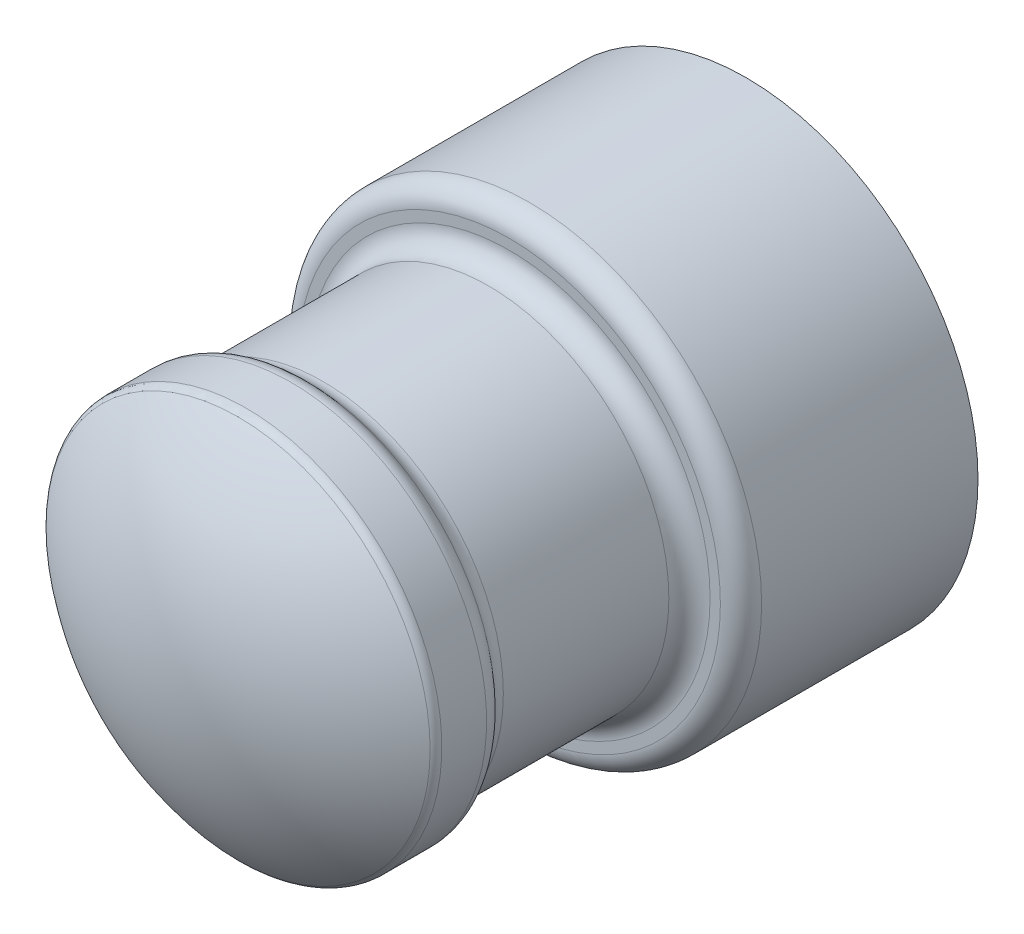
ISO-10303-21;
HEADER;
FILE_DESCRIPTION(('STEP AP214'),'2;1');
FILE_NAME('part.step','',(''),(''),'','','');
FILE_SCHEMA(('AUTOMOTIVE_DESIGN { 1 0 10303 214 1 1 1 1 }'));
ENDSEC;
DATA;
#1=APPLICATION_CONTEXT('core data for automotive mechanical design processes');
#2=APPLICATION_PROTOCOL_DEFINITION('international standard','automotive_design',2000,#1);
#3=PRODUCT_CONTEXT('',#1,'mechanical');
#4=PRODUCT('Part','Part','',(#3));
#5=PRODUCT_RELATED_PRODUCT_CATEGORY('part','',(#4));
#6=PRODUCT_DEFINITION_FORMATION('','',#4);
#7=PRODUCT_DEFINITION_CONTEXT('part definition',#1,'design');
#8=PRODUCT_DEFINITION('design','',#6,#7);
#9=PRODUCT_DEFINITION_SHAPE('','',#8);
#10=(LENGTH_UNIT() NAMED_UNIT(*) SI_UNIT(.MILLI.,.METRE.));
#11=(NAMED_UNIT(*) PLANE_ANGLE_UNIT() SI_UNIT($,.RADIAN.));
#12=(NAMED_UNIT(*) SI_UNIT($,.STERADIAN.) SOLID_ANGLE_UNIT());
#13=UNCERTAINTY_MEASURE_WITH_UNIT(LENGTH_MEASURE(1.E-05),#10,'distance_accuracy_value','');
#14=(GEOMETRIC_REPRESENTATION_CONTEXT(3) GLOBAL_UNCERTAINTY_ASSIGNED_CONTEXT((#13)) GLOBAL_UNIT_ASSIGNED_CONTEXT((#10,
#11,#12)) REPRESENTATION_CONTEXT('',''));
#15=CARTESIAN_POINT('',(0.,0.,0.));
#16=DIRECTION('',(0.,0.,1.));
#17=DIRECTION('',(1.,0.,0.));
#18=AXIS2_PLACEMENT_3D('',#15,#16,#17);
#19=CARTESIAN_POINT('',(0.,0.,48.));
#20=DIRECTION('',(0.,0.,1.));
#21=DIRECTION('',(1.,0.,0.));
#22=AXIS2_PLACEMENT_3D('',#19,#20,#21);
#23=PLANE('',#22);
#24=CARTESIAN_POINT('',(0.,0.,48.));
#25=DIRECTION('',(0.,0.,1.));
#26=DIRECTION('',(1.,0.,0.));
#27=AXIS2_PLACEMENT_3D('',#24,#25,#26);
#28=CIRCLE('',#27,18.);
#29=CARTESIAN_POINT('',(18.,0.,48.));
#30=VERTEX_POINT('',#29);
#31=EDGE_CURVE('E641',#30,#30,#28,.T.);
#32=ORIENTED_EDGE('',*,*,#31,.F.);
#33=EDGE_LOOP('',(#32));
#34=FACE_BOUND('',#33,.T.);
#35=DIRECTION('',(-0.50000000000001,-0.866025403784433,0.));
#36=VECTOR('',#35,1.);
#37=CARTESIAN_POINT('',(-2.5980762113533,1.50000000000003,48.));
#38=LINE('',#37,#36);
#39=CARTESIAN_POINT('',(-3.92095186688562,-0.791287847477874,48.));
#40=VERTEX_POINT('',#39);
#41=CARTESIAN_POINT('',(-10.8480762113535,-12.7894191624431,48.));
#42=VERTEX_POINT('',#41);
#43=EDGE_CURVE('E363',#40,#42,#38,.T.);
#44=ORIENTED_EDGE('',*,*,#43,.F.);
#45=CARTESIAN_POINT('',(0.,0.,48.));
#46=DIRECTION('',(0.,0.,1.));
#47=DIRECTION('',(1.,0.,0.));
#48=AXIS2_PLACEMENT_3D('',#45,#46,#47);
#49=CIRCLE('',#48,4.);
#50=CARTESIAN_POINT('',(-3.46410161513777,-1.99999999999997,48.));
#51=VERTEX_POINT('',#50);
#52=EDGE_CURVE('E624',#51,#40,#49,.F.);
#53=ORIENTED_EDGE('',*,*,#52,.F.);
#54=DIRECTION('',(-0.499999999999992,0.866025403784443,0.));
#55=VECTOR('',#54,1.);
#56=CARTESIAN_POINT('',(-3.46410161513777,-1.99999999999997,48.));
#57=LINE('',#56,#55);
#58=CARTESIAN_POINT('',(4.78589838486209,-16.2894191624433,48.));
#59=VERTEX_POINT('',#58);
#60=EDGE_CURVE('E600',#59,#51,#57,.T.);
#61=ORIENTED_EDGE('',*,*,#60,.F.);
#62=DIRECTION('',(-0.866025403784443,-0.499999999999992,0.));
#63=VECTOR('',#62,1.);
#64=CARTESIAN_POINT('',(4.78589838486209,-16.2894191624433,48.));
#65=LINE('',#64,#63);
#66=CARTESIAN_POINT('',(5.65192378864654,-15.7894191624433,48.));
#67=VERTEX_POINT('',#66);
#68=EDGE_CURVE('E597',#67,#59,#65,.T.);
#69=ORIENTED_EDGE('',*,*,#68,.F.);
#70=DIRECTION('',(0.499999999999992,-0.866025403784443,0.));
#71=VECTOR('',#70,1.);
#72=CARTESIAN_POINT('',(-2.59807621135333,-1.49999999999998,48.));
#73=LINE('',#72,#71);
#74=CARTESIAN_POINT('',(-1.27520055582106,-3.79128784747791,48.));
#75=VERTEX_POINT('',#74);
#76=EDGE_CURVE('E595',#75,#67,#73,.T.);
#77=ORIENTED_EDGE('',*,*,#76,.F.);
#78=CARTESIAN_POINT('',(0.,-4.,48.));
#79=VERTEX_POINT('',#78);
#80=EDGE_CURVE('E1426',#79,#75,#49,.F.);
#81=ORIENTED_EDGE('',*,*,#80,.F.);
#82=DIRECTION('',(-1.,0.,0.));
#83=VECTOR('',#82,1.);
#84=CARTESIAN_POINT('',(0.,-4.,48.));
#85=LINE('',#84,#83);
#86=CARTESIAN_POINT('',(16.5,-4.00000000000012,48.));
#87=VERTEX_POINT('',#86);
#88=EDGE_CURVE('E1456',#87,#79,#85,.T.);
#89=ORIENTED_EDGE('',*,*,#88,.F.);
#90=DIRECTION('',(0.,-1.,0.));
#91=VECTOR('',#90,1.);
#92=CARTESIAN_POINT('',(16.5,-4.00000000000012,48.));
#93=LINE('',#92,#91);
#94=CARTESIAN_POINT('',(16.5,-3.00000000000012,48.));
#95=VERTEX_POINT('',#94);
#96=EDGE_CURVE('E1453',#95,#87,#93,.T.);
#97=ORIENTED_EDGE('',*,*,#96,.F.);
#98=DIRECTION('',(1.,0.,0.));
#99=VECTOR('',#98,1.);
#100=CARTESIAN_POINT('',(0.,-3.,48.));
#101=LINE('',#100,#99);
#102=CARTESIAN_POINT('',(2.64575131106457,-3.00000000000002,48.));
#103=VERTEX_POINT('',#102);
#104=EDGE_CURVE('E1425',#103,#95,#101,.T.);
#105=ORIENTED_EDGE('',*,*,#104,.F.);
#106=CARTESIAN_POINT('',(3.46410161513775,-2.00000000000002,48.));
#107=VERTEX_POINT('',#106);
#108=EDGE_CURVE('E1420',#107,#103,#49,.F.);
#109=ORIENTED_EDGE('',*,*,#108,.F.);
#110=DIRECTION('',(-0.500000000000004,-0.866025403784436,0.));
#111=VECTOR('',#110,1.);
#112=CARTESIAN_POINT('',(3.46410161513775,-2.00000000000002,48.));
#113=LINE('',#112,#111);
#114=CARTESIAN_POINT('',(11.7141016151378,12.2894191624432,48.));
#115=VERTEX_POINT('',#114);
#116=EDGE_CURVE('E1372',#115,#107,#113,.T.);
#117=ORIENTED_EDGE('',*,*,#116,.F.);
#118=DIRECTION('',(0.866025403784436,-0.500000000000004,0.));
#119=VECTOR('',#118,1.);
#120=CARTESIAN_POINT('',(11.7141016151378,12.2894191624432,48.));
#121=LINE('',#120,#119);
#122=CARTESIAN_POINT('',(10.8480762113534,12.7894191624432,48.));
#123=VERTEX_POINT('',#122);
#124=EDGE_CURVE('E1367',#123,#115,#121,.T.);
#125=ORIENTED_EDGE('',*,*,#124,.F.);
#126=DIRECTION('',(0.500000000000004,0.866025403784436,0.));
#127=VECTOR('',#126,1.);
#128=CARTESIAN_POINT('',(2.59807621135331,-1.50000000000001,48.));
#129=LINE('',#128,#127);
#130=CARTESIAN_POINT('',(3.92095186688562,0.7912878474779,48.));
#131=VERTEX_POINT('',#130);
#132=EDGE_CURVE('E1362',#131,#123,#129,.T.);
#133=ORIENTED_EDGE('',*,*,#132,.F.);
#134=CARTESIAN_POINT('',(3.46410161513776,1.99999999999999,48.));
#135=VERTEX_POINT('',#134);
#136=EDGE_CURVE('E702',#135,#131,#49,.F.);
#137=ORIENTED_EDGE('',*,*,#136,.F.);
#138=DIRECTION('',(0.499999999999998,-0.86602540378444,0.));
#139=VECTOR('',#138,1.);
#140=CARTESIAN_POINT('',(3.46410161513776,1.99999999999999,48.));
#141=LINE('',#140,#139);
#142=CARTESIAN_POINT('',(-4.78589838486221,16.2894191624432,48.));
#143=VERTEX_POINT('',#142);
#144=EDGE_CURVE('E851',#143,#135,#141,.T.);
#145=ORIENTED_EDGE('',*,*,#144,.F.);
#146=DIRECTION('',(0.86602540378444,0.499999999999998,0.));
#147=VECTOR('',#146,1.);
#148=CARTESIAN_POINT('',(-4.78589838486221,16.2894191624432,48.));
#149=LINE('',#148,#147);
#150=CARTESIAN_POINT('',(-5.65192378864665,15.7894191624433,48.));
#151=VERTEX_POINT('',#150);
#152=EDGE_CURVE('E846',#151,#143,#149,.T.);
#153=ORIENTED_EDGE('',*,*,#152,.F.);
#154=DIRECTION('',(-0.499999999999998,0.86602540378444,0.));
#155=VECTOR('',#154,1.);
#156=CARTESIAN_POINT('',(2.59807621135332,1.49999999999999,48.));
#157=LINE('',#156,#155);
#158=CARTESIAN_POINT('',(1.27520055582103,3.79128784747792,48.));
#159=VERTEX_POINT('',#158);
#160=EDGE_CURVE('E838',#159,#151,#157,.T.);
#161=ORIENTED_EDGE('',*,*,#160,.F.);
#162=CARTESIAN_POINT('',(0.,4.,48.));
#163=VERTEX_POINT('',#162);
#164=EDGE_CURVE('E698',#163,#159,#49,.F.);
#165=ORIENTED_EDGE('',*,*,#164,.F.);
#166=DIRECTION('',(1.,0.,0.));
#167=VECTOR('',#166,1.);
#168=CARTESIAN_POINT('',(0.,4.,48.));
#169=LINE('',#168,#167);
#170=CARTESIAN_POINT('',(-16.5,4.,48.));
#171=VERTEX_POINT('',#170);
#172=EDGE_CURVE('E778',#171,#163,#169,.T.);
#173=ORIENTED_EDGE('',*,*,#172,.F.);
#174=DIRECTION('',(0.,1.,0.));
#175=VECTOR('',#174,1.);
#176=CARTESIAN_POINT('',(-16.5,4.,48.));
#177=LINE('',#176,#175);
#178=CARTESIAN_POINT('',(-16.5,3.,48.));
#179=VERTEX_POINT('',#178);
#180=EDGE_CURVE('E780',#179,#171,#177,.T.);
#181=ORIENTED_EDGE('',*,*,#180,.F.);
#182=DIRECTION('',(-1.,0.,0.));
#183=VECTOR('',#182,1.);
#184=CARTESIAN_POINT('',(0.,3.,48.));
#185=LINE('',#184,#183);
#186=CARTESIAN_POINT('',(-2.64575131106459,3.,48.));
#187=VERTEX_POINT('',#186);
#188=EDGE_CURVE('E783',#187,#179,#185,.T.);
#189=ORIENTED_EDGE('',*,*,#188,.F.);
#190=CARTESIAN_POINT('',(-3.46410161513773,2.00000000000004,48.));
#191=VERTEX_POINT('',#190);
#192=EDGE_CURVE('E697',#191,#187,#49,.F.);
#193=ORIENTED_EDGE('',*,*,#192,.F.);
#194=DIRECTION('',(0.50000000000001,0.866025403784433,0.));
#195=VECTOR('',#194,1.);
#196=CARTESIAN_POINT('',(-3.46410161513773,2.00000000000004,48.));
#197=LINE('',#196,#195);
#198=CARTESIAN_POINT('',(-11.7141016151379,-12.2894191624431,48.));
#199=VERTEX_POINT('',#198);
#200=EDGE_CURVE('E371',#199,#191,#197,.T.);
#201=ORIENTED_EDGE('',*,*,#200,.F.);
#202=DIRECTION('',(-0.866025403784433,0.50000000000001,0.));
#203=VECTOR('',#202,1.);
#204=CARTESIAN_POINT('',(-11.7141016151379,-12.2894191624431,48.));
#205=LINE('',#204,#203);
#206=EDGE_CURVE('E368',#42,#199,#205,.T.);
#207=ORIENTED_EDGE('',*,*,#206,.F.);
#208=EDGE_LOOP('',(#44,#53,#61,#69,#77,#81,#89,#97,#105,#109,#117,#125,#133,#137,#145,#153,#161,
#165,#173,#181,#189,#193,#201,#207));
#209=FACE_BOUND('',#208,.T.);
#210=ADVANCED_FACE('F32',(#34,#209),#23,.F.);
#211=CARTESIAN_POINT('',(0.,0.,43.));
#212=DIRECTION('',(0.,0.,-1.));
#213=DIRECTION('',(-1.,0.,0.));
#214=AXIS2_PLACEMENT_3D('',#211,#212,#213);
#215=CYLINDRICAL_SURFACE('',#214,16.5);
#216=CARTESIAN_POINT('',(0.,0.,25.));
#217=DIRECTION('',(0.,0.,-1.));
#218=DIRECTION('',(-1.,0.,0.));
#219=AXIS2_PLACEMENT_3D('',#216,#217,#218);
#220=CIRCLE('',#219,16.5);
#221=CARTESIAN_POINT('',(-10.7105665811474,-12.5512454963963,25.));
#222=VERTEX_POINT('',#221);
#223=CARTESIAN_POINT('',(4.53980368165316,-15.8631706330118,25.));
#224=VERTEX_POINT('',#223);
#225=EDGE_CURVE('E653',#222,#224,#220,.F.);
#226=ORIENTED_EDGE('',*,*,#225,.F.);
#227=DIRECTION('',(0.,0.,-1.));
#228=VECTOR('',#227,1.);
#229=CARTESIAN_POINT('',(-10.7105665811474,-12.5512454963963,43.));
#230=LINE('',#229,#228);
#231=CARTESIAN_POINT('',(-10.7105665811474,-12.5512454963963,41.0635083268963));
#232=VERTEX_POINT('',#231);
#233=EDGE_CURVE('E593',#222,#232,#230,.F.);
#234=ORIENTED_EDGE('',*,*,#233,.T.);
#235=CARTESIAN_POINT('',(0.,0.,41.0635083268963));
#236=DIRECTION('',(0.,0.,-1.));
#237=DIRECTION('',(-1.,0.,0.));
#238=AXIS2_PLACEMENT_3D('',#235,#236,#237);
#239=CIRCLE('',#238,16.5);
#240=CARTESIAN_POINT('',(4.53980368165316,-15.8631706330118,41.0635083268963));
#241=VERTEX_POINT('',#240);
#242=EDGE_CURVE('E1438',#241,#232,#239,.T.);
#243=ORIENTED_EDGE('',*,*,#242,.F.);
#244=DIRECTION('',(0.,0.,-1.));
#245=VECTOR('',#244,1.);
#246=CARTESIAN_POINT('',(4.53980368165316,-15.8631706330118,43.));
#247=LINE('',#246,#245);
#248=EDGE_CURVE('E551',#241,#224,#247,.T.);
#249=ORIENTED_EDGE('',*,*,#248,.T.);
#250=EDGE_LOOP('',(#226,#234,#243,#249));
#251=FACE_BOUND('',#250,.T.);
#252=ADVANCED_FACE('F868',(#251),#215,.F.);
#253=CARTESIAN_POINT('',(-11.468006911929,-11.8631706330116,41.0635083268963));
#254=VERTEX_POINT('',#253);
#255=CARTESIAN_POINT('',(-16.224980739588,3.,41.0635083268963));
#256=VERTEX_POINT('',#255);
#257=EDGE_CURVE('E659',#254,#256,#239,.T.);
#258=ORIENTED_EDGE('',*,*,#257,.F.);
#259=DIRECTION('',(0.,0.,-1.));
#260=VECTOR('',#259,1.);
#261=CARTESIAN_POINT('',(-11.468006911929,-11.8631706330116,43.));
#262=LINE('',#261,#260);
#263=CARTESIAN_POINT('',(-11.468006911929,-11.8631706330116,25.));
#264=VERTEX_POINT('',#263);
#265=EDGE_CURVE('E55',#254,#264,#262,.T.);
#266=ORIENTED_EDGE('',*,*,#265,.T.);
#267=CARTESIAN_POINT('',(-16.224980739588,3.,25.));
#268=VERTEX_POINT('',#267);
#269=EDGE_CURVE('E650',#268,#264,#220,.F.);
#270=ORIENTED_EDGE('',*,*,#269,.F.);
#271=DIRECTION('',(0.,0.,-1.));
#272=VECTOR('',#271,1.);
#273=CARTESIAN_POINT('',(-16.224980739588,3.,43.));
#274=LINE('',#273,#272);
#275=EDGE_CURVE('E736',#268,#256,#274,.F.);
#276=ORIENTED_EDGE('',*,*,#275,.T.);
#277=EDGE_LOOP('',(#258,#266,#270,#276));
#278=FACE_BOUND('',#277,.T.);
#279=ADVANCED_FACE('F423',(#278),#215,.F.);
#280=CARTESIAN_POINT('',(0.,0.,25.));
#281=DIRECTION('',(0.,0.,1.));
#282=DIRECTION('',(1.,0.,0.));
#283=AXIS2_PLACEMENT_3D('',#280,#281,#282);
#284=TOROIDAL_SURFACE('',#283,19.5,3.);
#285=CARTESIAN_POINT('',(0.,0.,22.));
#286=DIRECTION('',(0.,0.,1.));
#287=DIRECTION('',(1.,0.,0.));
#288=AXIS2_PLACEMENT_3D('',#285,#286,#287);
#289=CIRCLE('',#288,19.5);
#290=CARTESIAN_POINT('',(19.5,0.,22.));
#291=VERTEX_POINT('',#290);
#292=EDGE_CURVE('E647',#291,#291,#289,.F.);
#293=ORIENTED_EDGE('',*,*,#292,.T.);
#294=EDGE_LOOP('',(#293));
#295=FACE_BOUND('',#294,.T.);
#296=CARTESIAN_POINT('',(0.,0.,24.));
#297=DIRECTION('',(0.,0.,1.));
#298=DIRECTION('',(1.,0.,0.));
#299=AXIS2_PLACEMENT_3D('',#296,#297,#298);
#300=CIRCLE('',#299,16.6715728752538);
#301=CARTESIAN_POINT('',(-10.7977917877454,-12.7023239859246,24.));
#302=VERTEX_POINT('',#301);
#303=CARTESIAN_POINT('',(-11.556402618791,-12.0162764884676,24.));
#304=VERTEX_POINT('',#303);
#305=EDGE_CURVE('E592',#302,#304,#300,.F.);
#306=ORIENTED_EDGE('',*,*,#305,.F.);
#307=CARTESIAN_POINT('',(-10.7978277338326,-12.702386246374,23.9998));
#308=CARTESIAN_POINT('',(-10.7833837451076,-12.6773685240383,24.0801262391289));
#309=CARTESIAN_POINT('',(-10.7706810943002,-12.655366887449,24.1617045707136));
#310=CARTESIAN_POINT('',(-10.7489224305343,-12.6176797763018,24.3261382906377));
#311=CARTESIAN_POINT('',(-10.7398401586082,-12.6019488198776,24.4089797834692));
#312=CARTESIAN_POINT('',(-10.7252704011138,-12.5767132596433,24.5759188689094));
#313=CARTESIAN_POINT('',(-10.7197829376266,-12.5672086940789,24.6600164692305));
#314=CARTESIAN_POINT('',(-10.7124134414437,-12.5544443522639,24.8294722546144));
#315=CARTESIAN_POINT('',(-10.7105585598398,-12.5512316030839,24.9148351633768));
#316=CARTESIAN_POINT('',(-10.7105665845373,-12.5512455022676,25.0002));
#317=B_SPLINE_CURVE_WITH_KNOTS('',3,(#307,#308,#309,#310,#311,#312,#313,#314,#315,#316),
.UNSPECIFIED.,.F.,.F.,(4,2,2,2,4),(0.,0.25600867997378,0.510125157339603,0.764243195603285,
1.0202534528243),.UNSPECIFIED.);
#318=EDGE_CURVE('E585',#302,#222,#317,.T.);
#319=ORIENTED_EDGE('',*,*,#318,.T.);
#320=ORIENTED_EDGE('',*,*,#225,.T.);
#321=CARTESIAN_POINT('',(4.53980368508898,-15.8631706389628,25.0002));
#322=CARTESIAN_POINT('',(4.53979496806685,-15.8631555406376,24.9147819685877));
#323=CARTESIAN_POINT('',(4.54167792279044,-15.8664169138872,24.8293664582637));
#324=CARTESIAN_POINT('',(4.54915507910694,-15.8793677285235,24.6598396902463));
#325=CARTESIAN_POINT('',(4.55472106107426,-15.8890082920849,24.5757234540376));
#326=CARTESIAN_POINT('',(4.56949348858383,-15.9145948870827,24.4087816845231));
#327=CARTESIAN_POINT('',(4.57869989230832,-15.9305408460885,24.3259561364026));
#328=CARTESIAN_POINT('',(4.60074615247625,-15.9687260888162,24.1615838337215));
#329=CARTESIAN_POINT('',(4.6136132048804,-15.9910124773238,24.0800516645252));
#330=CARTESIAN_POINT('',(4.62823581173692,-16.0163395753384,23.9998));
#331=B_SPLINE_CURVE_WITH_KNOTS('',3,(#321,#322,#323,#324,#325,#326,#327,#328,#329,#330),
.UNSPECIFIED.,.F.,.F.,(4,2,2,2,4),(0.,0.256166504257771,0.510392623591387,0.764615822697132,
1.02077937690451),.UNSPECIFIED.);
#332=CARTESIAN_POINT('',(4.62819938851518,-16.0162764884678,24.));
#333=VERTEX_POINT('',#332);
#334=EDGE_CURVE('E507',#224,#333,#331,.T.);
#335=ORIENTED_EDGE('',*,*,#334,.T.);
#336=CARTESIAN_POINT('',(0.,0.,24.));
#337=DIRECTION('',(0.,0.,1.));
#338=DIRECTION('',(1.,0.,0.));
#339=AXIS2_PLACEMENT_3D('',#336,#337,#338);
#340=CIRCLE('',#339,16.6715728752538);
#341=CARTESIAN_POINT('',(5.60163936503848,-15.7023239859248,24.));
#342=VERTEX_POINT('',#341);
#343=EDGE_CURVE('E525',#342,#333,#340,.F.);
#344=ORIENTED_EDGE('',*,*,#343,.F.);
#345=CARTESIAN_POINT('',(5.60167531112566,-15.7023862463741,23.9998000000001));
#346=CARTESIAN_POINT('',(5.58723132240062,-15.6773685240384,24.080126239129));
#347=CARTESIAN_POINT('',(5.57452867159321,-15.6553668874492,24.1617045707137));
#348=CARTESIAN_POINT('',(5.5527700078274,-15.617679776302,24.3261382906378));
#349=CARTESIAN_POINT('',(5.54368773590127,-15.6019488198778,24.4089797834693));
#350=CARTESIAN_POINT('',(5.52911797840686,-15.5767132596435,24.5759188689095));
#351=CARTESIAN_POINT('',(5.52363051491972,-15.5672086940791,24.6600164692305));
#352=CARTESIAN_POINT('',(5.5162610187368,-15.5544443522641,24.8294722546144));
#353=CARTESIAN_POINT('',(5.51440613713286,-15.551231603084,24.9148351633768));
#354=CARTESIAN_POINT('',(5.51441416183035,-15.5512455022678,25.0002));
#355=B_SPLINE_CURVE_WITH_KNOTS('',3,(#345,#346,#347,#348,#349,#350,#351,#352,#353,#354),
.UNSPECIFIED.,.F.,.F.,(4,2,2,2,4),(0.,0.25600867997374,0.510125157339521,0.764243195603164,
1.02025345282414),.UNSPECIFIED.);
#356=CARTESIAN_POINT('',(5.51441415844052,-15.5512454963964,25.));
#357=VERTEX_POINT('',#356);
#358=EDGE_CURVE('E516',#342,#357,#355,.T.);
#359=ORIENTED_EDGE('',*,*,#358,.T.);
#360=CARTESIAN_POINT('',(16.0078105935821,-4.00000000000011,25.));
#361=VERTEX_POINT('',#360);
#362=EDGE_CURVE('E1448',#357,#361,#220,.F.);
#363=ORIENTED_EDGE('',*,*,#362,.T.);
#364=CARTESIAN_POINT('',(16.0377759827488,-4.00000000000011,24.5833544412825));
#365=CARTESIAN_POINT('',(16.0615757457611,-4.00000000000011,24.4187524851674));
#366=CARTESIAN_POINT('',(16.099512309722,-4.00000000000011,24.2560618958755));
#367=CARTESIAN_POINT('',(16.2023987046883,-4.00000000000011,23.9393101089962));
#368=CARTESIAN_POINT('',(16.2673848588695,-4.00000000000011,23.7852608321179));
#369=CARTESIAN_POINT('',(16.4220932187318,-4.00000000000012,23.4904201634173));
#370=CARTESIAN_POINT('',(16.5117792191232,-4.00000000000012,23.3496097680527));
#371=CARTESIAN_POINT('',(16.7130861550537,-4.00000000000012,23.0847379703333));
#372=CARTESIAN_POINT('',(16.8247027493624,-4.00000000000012,22.9606732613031));
#373=CARTESIAN_POINT('',(17.0688091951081,-4.00000000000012,22.7302516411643));
#374=CARTESIAN_POINT('',(17.201642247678,-4.00000000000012,22.624258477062));
#375=CARTESIAN_POINT('',(17.4828491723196,-4.00000000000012,22.4354051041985));
#376=CARTESIAN_POINT('',(17.6312256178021,-4.00000000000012,22.3525487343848));
#377=CARTESIAN_POINT('',(17.9434057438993,-4.00000000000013,22.2101790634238));
#378=CARTESIAN_POINT('',(18.1075074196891,-4.00000000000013,22.1513186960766));
#379=CARTESIAN_POINT('',(18.4431919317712,-4.00000000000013,22.0615577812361));
#380=CARTESIAN_POINT('',(18.61477545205,-4.00000000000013,22.030659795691));
#381=CARTESIAN_POINT('',(18.9630739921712,-4.00000000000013,21.9974409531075));
#382=CARTESIAN_POINT('',(19.13982711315,-4.00000000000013,21.9955176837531));
#383=CARTESIAN_POINT('',(19.4911459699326,-4.00000000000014,22.0214284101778));
#384=CARTESIAN_POINT('',(19.6657116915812,-4.00000000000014,22.0492625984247));
#385=CARTESIAN_POINT('',(20.0072759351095,-4.00000000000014,22.1339895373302));
#386=CARTESIAN_POINT('',(20.1742891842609,-4.00000000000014,22.1908228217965));
#387=CARTESIAN_POINT('',(20.4962032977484,-4.00000000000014,22.3321067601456));
#388=CARTESIAN_POINT('',(20.6511049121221,-4.00000000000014,22.4165557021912));
#389=CARTESIAN_POINT('',(20.9420792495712,-4.00000000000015,22.6094859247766));
#390=CARTESIAN_POINT('',(21.0783816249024,-4.00000000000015,22.7176207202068));
#391=CARTESIAN_POINT('',(21.330476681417,-4.00000000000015,22.9556214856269));
#392=CARTESIAN_POINT('',(21.4462713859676,-4.00000000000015,23.085485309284));
#393=CARTESIAN_POINT('',(21.6518509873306,-4.00000000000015,23.3607420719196));
#394=CARTESIAN_POINT('',(21.7420666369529,-4.00000000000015,23.5058133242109));
#395=CARTESIAN_POINT('',(21.8964179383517,-4.00000000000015,23.8092245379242));
#396=CARTESIAN_POINT('',(21.9605559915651,-4.00000000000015,23.9675632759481));
#397=CARTESIAN_POINT('',(22.0599535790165,-4.00000000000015,24.290385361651));
#398=CARTESIAN_POINT('',(22.0956424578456,-4.00000000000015,24.4547366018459));
#399=CARTESIAN_POINT('',(22.1386650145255,-4.00000000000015,24.7871069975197));
#400=CARTESIAN_POINT('',(22.1460003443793,-4.00000000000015,24.9551259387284));
#401=CARTESIAN_POINT('',(22.1321477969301,-4.00000000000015,25.2885820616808));
#402=CARTESIAN_POINT('',(22.11119571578,-4.00000000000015,25.4540291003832));
#403=CARTESIAN_POINT('',(22.0418293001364,-4.00000000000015,25.7790570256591));
#404=CARTESIAN_POINT('',(21.9934152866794,-4.00000000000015,25.9386379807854));
#405=CARTESIAN_POINT('',(21.8705525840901,-4.00000000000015,26.2475751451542));
#406=CARTESIAN_POINT('',(21.7960839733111,-4.00000000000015,26.3969234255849));
#407=CARTESIAN_POINT('',(21.6233552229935,-4.00000000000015,26.6811539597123));
#408=CARTESIAN_POINT('',(21.525094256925,-4.00000000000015,26.816035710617));
#409=CARTESIAN_POINT('',(21.3066290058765,-4.00000000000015,27.0689225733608));
#410=CARTESIAN_POINT('',(21.1862251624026,-4.00000000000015,27.1867552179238));
#411=CARTESIAN_POINT('',(20.9276142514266,-4.00000000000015,27.4009121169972));
#412=CARTESIAN_POINT('',(20.7894058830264,-4.00000000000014,27.4972347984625));
#413=CARTESIAN_POINT('',(20.4967874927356,-4.00000000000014,27.6672887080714));
#414=CARTESIAN_POINT('',(20.3421555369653,-4.00000000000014,27.7406379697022));
#415=CARTESIAN_POINT('',(20.0229202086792,-4.00000000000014,27.8608457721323));
#416=CARTESIAN_POINT('',(19.8583159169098,-4.00000000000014,27.9077018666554));
#417=CARTESIAN_POINT('',(19.5206974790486,-4.00000000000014,27.9744356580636));
#418=CARTESIAN_POINT('',(19.3475860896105,-4.00000000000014,27.9938216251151));
#419=CARTESIAN_POINT('',(19.000539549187,-4.00000000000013,28.0036635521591));
#420=CARTESIAN_POINT('',(18.826604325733,-4.00000000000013,27.9941169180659));
#421=CARTESIAN_POINT('',(18.4804501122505,-4.00000000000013,27.9461063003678));
#422=CARTESIAN_POINT('',(18.3082830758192,-4.00000000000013,27.9072668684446));
#423=CARTESIAN_POINT('',(17.9728840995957,-4.00000000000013,27.8012777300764));
#424=CARTESIAN_POINT('',(17.8096525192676,-4.00000000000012,27.7341268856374));
#425=CARTESIAN_POINT('',(17.4966555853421,-4.00000000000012,27.5731677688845));
#426=CARTESIAN_POINT('',(17.3469058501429,-4.00000000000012,27.4793290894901));
#427=CARTESIAN_POINT('',(17.0655945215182,-4.00000000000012,27.267487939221));
#428=CARTESIAN_POINT('',(16.9340311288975,-4.00000000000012,27.1494878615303));
#429=CARTESIAN_POINT('',(16.6950857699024,-4.00000000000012,26.8944766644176));
#430=CARTESIAN_POINT('',(16.5873670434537,-4.00000000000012,26.7577813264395));
#431=CARTESIAN_POINT('',(16.397126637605,-4.00000000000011,26.4677936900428));
#432=CARTESIAN_POINT('',(16.3146074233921,-4.00000000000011,26.314499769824));
#433=CARTESIAN_POINT('',(16.1794756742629,-4.00000000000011,26.0000299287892));
#434=CARTESIAN_POINT('',(16.1261356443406,-4.00000000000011,25.8391661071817));
#435=CARTESIAN_POINT('',(16.0480315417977,-4.00000000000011,25.5107970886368));
#436=CARTESIAN_POINT('',(16.0232262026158,-4.00000000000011,25.343301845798));
#437=CARTESIAN_POINT('',(16.0071258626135,-4.00000000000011,25.0763367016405));
#438=CARTESIAN_POINT('',(16.0062201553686,-4.00000000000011,24.9773524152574));
#439=CARTESIAN_POINT('',(16.0144685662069,-4.00000000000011,24.7798049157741));
#440=CARTESIAN_POINT('',(16.0236224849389,-4.00000000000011,24.6812416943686));
#441=CARTESIAN_POINT('',(16.0377759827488,-4.00000000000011,24.5833544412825));
#442=B_SPLINE_CURVE_WITH_KNOTS('',3,(#364,#365,#366,#367,#368,#369,#370,#371,#372,#373,#374,
#375,#376,#377,#378,#379,#380,#381,#382,#383,#384,#385,#386,#387,#388,#389,#390,#391,#392,#393,
#394,#395,#396,#397,#398,#399,#400,#401,#402,#403,#404,#405,#406,#407,#408,#409,#410,#411,#412,
#413,#414,#415,#416,#417,#418,#419,#420,#421,#422,#423,#424,#425,#426,#427,#428,#429,#430,#431,
#432,#433,#434,#435,#436,#437,#438,#439,#440,#441),.UNSPECIFIED.,.T.,.F.,(4,2,2,2,2,2,2,2,2,2,2,
2,2,2,2,2,2,2,2,2,2,2,2,2,2,2,2,2,2,2,2,2,2,2,2,2,2,2,4),(0.,0.498570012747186,
0.997811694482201,1.49632544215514,1.99474060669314,2.50223522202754,3.00981399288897,
3.53040610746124,4.05104591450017,4.5788234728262,5.10660444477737,5.63330746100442,
6.15997783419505,6.67940500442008,7.19878089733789,7.70880579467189,8.21878371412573,
8.72091126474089,9.22300955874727,9.72094823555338,10.2188810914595,10.717195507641,
11.2155272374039,11.7185922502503,12.2216940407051,12.7327639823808,13.2438811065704,
13.7640366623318,14.284238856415,14.8112242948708,15.3382309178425,15.8658404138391,
16.3933976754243,16.9129465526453,17.4325462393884,17.9385205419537,18.443762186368,
18.7402630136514,19.036757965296),.UNSPECIFIED.);
#443=CARTESIAN_POINT('',(16.1846020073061,-4.00000000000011,24.));
#444=VERTEX_POINT('',#443);
#445=EDGE_CURVE('E489',#361,#444,#442,.T.);
#446=ORIENTED_EDGE('',*,*,#445,.T.);
#447=CARTESIAN_POINT('',(0.,0.,24.));
#448=DIRECTION('',(0.,0.,1.));
#449=DIRECTION('',(1.,0.,0.));
#450=AXIS2_PLACEMENT_3D('',#447,#448,#449);
#451=CIRCLE('',#450,16.6715728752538);
#452=CARTESIAN_POINT('',(16.3994311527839,-3.00000000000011,24.));
#453=VERTEX_POINT('',#452);
#454=EDGE_CURVE('E1360',#453,#444,#451,.F.);
#455=ORIENTED_EDGE('',*,*,#454,.F.);
#456=CARTESIAN_POINT('',(16.2513524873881,-3.00000000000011,24.6063951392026));
#457=CARTESIAN_POINT('',(16.2292079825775,-3.00000000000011,24.7709964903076));
#458=CARTESIAN_POINT('',(16.2209687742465,-3.00000000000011,24.9375885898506));
#459=CARTESIAN_POINT('',(16.2326427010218,-3.00000000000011,25.2699137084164));
#460=CARTESIAN_POINT('',(16.2525882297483,-3.00000000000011,25.4356455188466));
#461=CARTESIAN_POINT('',(16.3200120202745,-3.00000000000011,25.7613010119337));
#462=CARTESIAN_POINT('',(16.3674713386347,-3.00000000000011,25.9212286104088));
#463=CARTESIAN_POINT('',(16.4884163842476,-3.00000000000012,26.2308653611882));
#464=CARTESIAN_POINT('',(16.5618967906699,-3.00000000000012,26.3805765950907));
#465=CARTESIAN_POINT('',(16.7331159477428,-3.00000000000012,26.6665033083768));
#466=CARTESIAN_POINT('',(16.8309826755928,-3.00000000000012,26.8026421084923));
#467=CARTESIAN_POINT('',(17.0478816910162,-3.00000000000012,27.0568630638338));
#468=CARTESIAN_POINT('',(17.1669161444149,-3.00000000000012,27.174943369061));
#469=CARTESIAN_POINT('',(17.4246132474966,-3.00000000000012,27.3915202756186));
#470=CARTESIAN_POINT('',(17.5635358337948,-3.00000000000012,27.4897075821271));
#471=CARTESIAN_POINT('',(17.8557165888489,-3.00000000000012,27.6617329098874));
#472=CARTESIAN_POINT('',(18.0089758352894,-3.00000000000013,27.7355690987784));
#473=CARTESIAN_POINT('',(18.327706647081,-3.00000000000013,27.857778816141));
#474=CARTESIAN_POINT('',(18.4933148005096,-3.00000000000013,27.9057963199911));
#475=CARTESIAN_POINT('',(18.8302228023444,-3.00000000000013,27.9735358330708));
#476=CARTESIAN_POINT('',(19.0015228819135,-3.00000000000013,27.9932566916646));
#477=CARTESIAN_POINT('',(19.346053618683,-3.00000000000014,28.0038637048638));
#478=CARTESIAN_POINT('',(19.5192896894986,-3.00000000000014,27.994575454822));
#479=CARTESIAN_POINT('',(19.8617312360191,-3.00000000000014,27.9469720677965));
#480=CARTESIAN_POINT('',(20.0309367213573,-3.00000000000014,27.9086570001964));
#481=CARTESIAN_POINT('',(20.3600183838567,-3.00000000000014,27.8041206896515));
#482=CARTESIAN_POINT('',(20.5199176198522,-3.00000000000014,27.7379720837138));
#483=CARTESIAN_POINT('',(20.8262065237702,-3.00000000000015,27.5795479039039));
#484=CARTESIAN_POINT('',(20.9725967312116,-3.00000000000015,27.487273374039));
#485=CARTESIAN_POINT('',(21.2463829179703,-3.00000000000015,27.2800233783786));
#486=CARTESIAN_POINT('',(21.3739278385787,-3.00000000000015,27.1652446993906));
#487=CARTESIAN_POINT('',(21.6076962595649,-3.00000000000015,26.9157098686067));
#488=CARTESIAN_POINT('',(21.7139209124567,-3.00000000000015,26.780954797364));
#489=CARTESIAN_POINT('',(21.900913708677,-3.00000000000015,26.4967438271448));
#490=CARTESIAN_POINT('',(21.981925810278,-3.00000000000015,26.3474484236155));
#491=CARTESIAN_POINT('',(22.1175010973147,-3.00000000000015,26.0372958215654));
#492=CARTESIAN_POINT('',(22.1720655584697,-3.00000000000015,25.8764391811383));
#493=CARTESIAN_POINT('',(22.2527746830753,-3.00000000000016,25.5491230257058));
#494=CARTESIAN_POINT('',(22.279144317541,-3.00000000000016,25.3827189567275));
#495=CARTESIAN_POINT('',(22.3034535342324,-3.00000000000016,25.0478486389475));
#496=CARTESIAN_POINT('',(22.3013939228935,-3.00000000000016,24.8793824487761));
#497=CARTESIAN_POINT('',(22.2689704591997,-3.00000000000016,24.5458511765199));
#498=CARTESIAN_POINT('',(22.2387149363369,-3.00000000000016,24.3807755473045));
#499=CARTESIAN_POINT('',(22.1509527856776,-3.00000000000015,24.0580379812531));
#500=CARTESIAN_POINT('',(22.0934462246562,-3.00000000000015,23.9003760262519));
#501=CARTESIAN_POINT('',(21.9527856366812,-3.00000000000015,23.5967001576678));
#502=CARTESIAN_POINT('',(21.8695988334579,-3.00000000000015,23.4507014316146));
#503=CARTESIAN_POINT('',(21.6800339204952,-3.00000000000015,23.1746330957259));
#504=CARTESIAN_POINT('',(21.5736552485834,-3.00000000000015,23.044563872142));
#505=CARTESIAN_POINT('',(21.3400668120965,-3.00000000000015,22.8031786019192));
#506=CARTESIAN_POINT('',(21.2127349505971,-3.00000000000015,22.6919807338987));
#507=CARTESIAN_POINT('',(20.9413568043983,-3.00000000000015,22.4923077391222));
#508=CARTESIAN_POINT('',(20.7973097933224,-3.00000000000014,22.4038336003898));
#509=CARTESIAN_POINT('',(20.4951694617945,-3.00000000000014,22.2512353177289));
#510=CARTESIAN_POINT('',(20.3369583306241,-3.00000000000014,22.1873444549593));
#511=CARTESIAN_POINT('',(20.0121191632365,-3.00000000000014,22.0867438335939));
#512=CARTESIAN_POINT('',(19.8454906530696,-3.00000000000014,22.0500356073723));
#513=CARTESIAN_POINT('',(19.5068182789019,-3.00000000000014,22.0044944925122));
#514=CARTESIAN_POINT('',(19.3347375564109,-3.00000000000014,21.9959355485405));
#515=CARTESIAN_POINT('',(18.9915555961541,-3.00000000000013,22.0076327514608));
#516=CARTESIAN_POINT('',(18.8204544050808,-3.00000000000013,22.0278902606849));
#517=CARTESIAN_POINT('',(18.4829544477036,-3.00000000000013,22.0968595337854));
#518=CARTESIAN_POINT('',(18.3165921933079,-3.00000000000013,22.145750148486));
#519=CARTESIAN_POINT('',(17.9944480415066,-3.00000000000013,22.2707893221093));
#520=CARTESIAN_POINT('',(17.8386658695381,-3.00000000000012,22.3469371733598));
#521=CARTESIAN_POINT('',(17.5423430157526,-3.00000000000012,22.5243260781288));
#522=CARTESIAN_POINT('',(17.4017852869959,-3.00000000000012,22.6255386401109));
#523=CARTESIAN_POINT('',(17.1398319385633,-3.00000000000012,22.8503728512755));
#524=CARTESIAN_POINT('',(17.0184402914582,-3.00000000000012,22.9739991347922));
#525=CARTESIAN_POINT('',(16.7996116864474,-3.00000000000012,23.2389126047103));
#526=CARTESIAN_POINT('',(16.7019595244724,-3.00000000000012,23.3800221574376));
#527=CARTESIAN_POINT('',(16.5322678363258,-3.00000000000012,23.676725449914));
#528=CARTESIAN_POINT('',(16.4601944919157,-3.00000000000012,23.8322997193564));
#529=CARTESIAN_POINT('',(16.3660772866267,-3.00000000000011,24.0920062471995));
#530=CARTESIAN_POINT('',(16.3354378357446,-3.00000000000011,24.1931082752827));
#531=CARTESIAN_POINT('',(16.2851114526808,-3.00000000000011,24.3980039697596));
#532=CARTESIAN_POINT('',(16.2654244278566,-3.00000000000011,24.5017976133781));
#533=CARTESIAN_POINT('',(16.2513524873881,-3.00000000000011,24.6063951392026));
#534=B_SPLINE_CURVE_WITH_KNOTS('',3,(#456,#457,#458,#459,#460,#461,#462,#463,#464,#465,#466,
#467,#468,#469,#470,#471,#472,#473,#474,#475,#476,#477,#478,#479,#480,#481,#482,#483,#484,#485,
#486,#487,#488,#489,#490,#491,#492,#493,#494,#495,#496,#497,#498,#499,#500,#501,#502,#503,#504,
#505,#506,#507,#508,#509,#510,#511,#512,#513,#514,#515,#516,#517,#518,#519,#520,#521,#522,#523,
#524,#525,#526,#527,#528,#529,#530,#531,#532,#533),.UNSPECIFIED.,.T.,.F.,(4,2,2,2,2,2,2,2,2,2,2,
2,2,2,2,2,2,2,2,2,2,2,2,2,2,2,2,2,2,2,2,2,2,2,2,2,2,2,4),(0.,0.497866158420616,
0.996304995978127,1.49440106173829,1.99239533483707,2.49306020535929,2.99377633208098,
3.50176382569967,4.0097895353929,4.52465179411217,5.03953498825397,5.55751963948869,
6.07550305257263,6.59214299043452,7.10876228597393,7.62105075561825,8.13331152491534,
8.64044934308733,9.14756269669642,9.65059880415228,10.1536206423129,10.6547177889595,
11.1558137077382,11.6575518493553,12.1593021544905,12.6640870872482,13.1688939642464,
13.678379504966,14.1878937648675,14.7023520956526,15.2168347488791,15.7345658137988,
16.2522834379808,16.7694152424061,17.2866540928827,17.7990128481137,18.3106916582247,
18.6270682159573,18.9434420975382),.UNSPECIFIED.);
#535=CARTESIAN_POINT('',(16.2249807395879,-3.00000000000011,25.));
#536=VERTEX_POINT('',#535);
#537=EDGE_CURVE('E498',#453,#536,#534,.T.);
#538=ORIENTED_EDGE('',*,*,#537,.T.);
#539=CARTESIAN_POINT('',(11.4680069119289,11.8631706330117,25.));
#540=VERTEX_POINT('',#539);
#541=EDGE_CURVE('E1447',#536,#540,#220,.F.);
#542=ORIENTED_EDGE('',*,*,#541,.T.);
#543=CARTESIAN_POINT('',(11.4680069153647,11.8631706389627,25.0002));
#544=CARTESIAN_POINT('',(11.4679981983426,11.8631555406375,24.9147819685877));
#545=CARTESIAN_POINT('',(11.4698811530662,11.8664169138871,24.8293664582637));
#546=CARTESIAN_POINT('',(11.4773583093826,11.8793677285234,24.6598396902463));
#547=CARTESIAN_POINT('',(11.48292429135,11.8890082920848,24.5757234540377));
#548=CARTESIAN_POINT('',(11.4976967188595,11.9145948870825,24.4087816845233));
#549=CARTESIAN_POINT('',(11.506903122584,11.9305408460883,24.3259561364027));
#550=CARTESIAN_POINT('',(11.5289493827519,11.9687260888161,24.1615838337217));
#551=CARTESIAN_POINT('',(11.5418164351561,11.9910124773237,24.0800516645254));
#552=CARTESIAN_POINT('',(11.5564390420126,12.0163395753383,23.9998000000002));
#553=B_SPLINE_CURVE_WITH_KNOTS('',3,(#543,#544,#545,#546,#547,#548,#549,#550,#551,#552),
.UNSPECIFIED.,.F.,.F.,(4,2,2,2,4),(0.,0.256166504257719,0.510392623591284,0.764615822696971,
1.0207793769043),.UNSPECIFIED.);
#554=CARTESIAN_POINT('',(11.5564026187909,12.0162764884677,24.));
#555=VERTEX_POINT('',#554);
#556=EDGE_CURVE('E469',#540,#555,#553,.T.);
#557=ORIENTED_EDGE('',*,*,#556,.T.);
#558=CARTESIAN_POINT('',(0.,0.,24.));
#559=DIRECTION('',(0.,0.,1.));
#560=DIRECTION('',(1.,0.,0.));
#561=AXIS2_PLACEMENT_3D('',#558,#559,#560);
#562=CIRCLE('',#561,16.6715728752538);
#563=CARTESIAN_POINT('',(10.7977917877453,12.7023239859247,24.));
#564=VERTEX_POINT('',#563);
#565=EDGE_CURVE('E847',#564,#555,#562,.F.);
#566=ORIENTED_EDGE('',*,*,#565,.F.);
#567=CARTESIAN_POINT('',(10.7978277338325,12.7023862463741,23.9998));
#568=CARTESIAN_POINT('',(10.7833837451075,12.6773685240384,24.0801262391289));
#569=CARTESIAN_POINT('',(10.7706810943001,12.6553668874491,24.1617045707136));
#570=CARTESIAN_POINT('',(10.7489224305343,12.6176797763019,24.3261382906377));
#571=CARTESIAN_POINT('',(10.7398401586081,12.6019488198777,24.4089797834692));
#572=CARTESIAN_POINT('',(10.7252704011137,12.5767132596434,24.5759188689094));
#573=CARTESIAN_POINT('',(10.7197829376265,12.567208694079,24.6600164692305));
#574=CARTESIAN_POINT('',(10.7124134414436,12.554444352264,24.8294722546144));
#575=CARTESIAN_POINT('',(10.7105585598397,12.5512316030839,24.9148351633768));
#576=CARTESIAN_POINT('',(10.7105665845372,12.5512455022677,25.0002));
#577=B_SPLINE_CURVE_WITH_KNOTS('',3,(#567,#568,#569,#570,#571,#572,#573,#574,#575,#576),
.UNSPECIFIED.,.F.,.F.,(4,2,2,2,4),(0.,0.256008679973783,0.510125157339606,0.764243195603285,
1.02025345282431),.UNSPECIFIED.);
#578=CARTESIAN_POINT('',(10.7105665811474,12.5512454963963,25.));
#579=VERTEX_POINT('',#578);
#580=EDGE_CURVE('E479',#564,#579,#577,.T.);
#581=ORIENTED_EDGE('',*,*,#580,.T.);
#582=CARTESIAN_POINT('',(-4.53980368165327,15.8631706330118,25.));
#583=VERTEX_POINT('',#582);
#584=EDGE_CURVE('E1446',#579,#583,#220,.F.);
#585=ORIENTED_EDGE('',*,*,#584,.T.);
#586=CARTESIAN_POINT('',(-4.53980368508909,15.8631706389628,25.0002));
#587=CARTESIAN_POINT('',(-4.53979496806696,15.8631555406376,24.9147819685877));
#588=CARTESIAN_POINT('',(-4.54167792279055,15.8664169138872,24.8293664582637));
#589=CARTESIAN_POINT('',(-4.54915507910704,15.8793677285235,24.6598396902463));
#590=CARTESIAN_POINT('',(-4.55472106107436,15.8890082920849,24.5757234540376));
#591=CARTESIAN_POINT('',(-4.56949348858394,15.9145948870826,24.4087816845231));
#592=CARTESIAN_POINT('',(-4.57869989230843,15.9305408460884,24.3259561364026));
#593=CARTESIAN_POINT('',(-4.60074615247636,15.9687260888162,24.1615838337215));
#594=CARTESIAN_POINT('',(-4.61361320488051,15.9910124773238,24.0800516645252));
#595=CARTESIAN_POINT('',(-4.62823581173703,16.0163395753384,23.9998));
#596=B_SPLINE_CURVE_WITH_KNOTS('',3,(#586,#587,#588,#589,#590,#591,#592,#593,#594,#595),
.UNSPECIFIED.,.F.,.F.,(4,2,2,2,4),(0.,0.256166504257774,0.51039262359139,0.764615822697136,
1.02077937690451),.UNSPECIFIED.);
#597=CARTESIAN_POINT('',(-4.62819938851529,16.0162764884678,24.));
#598=VERTEX_POINT('',#597);
#599=EDGE_CURVE('E449',#583,#598,#596,.T.);
#600=ORIENTED_EDGE('',*,*,#599,.T.);
#601=CARTESIAN_POINT('',(0.,0.,24.));
#602=DIRECTION('',(0.,0.,1.));
#603=DIRECTION('',(1.,0.,0.));
#604=AXIS2_PLACEMENT_3D('',#601,#602,#603);
#605=CIRCLE('',#604,16.6715728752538);
#606=CARTESIAN_POINT('',(-5.60163936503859,15.7023239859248,24.));
#607=VERTEX_POINT('',#606);
#608=EDGE_CURVE('E785',#607,#598,#605,.F.);
#609=ORIENTED_EDGE('',*,*,#608,.F.);
#610=CARTESIAN_POINT('',(-5.60167531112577,15.7023862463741,23.9998000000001));
#611=CARTESIAN_POINT('',(-5.58723132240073,15.6773685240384,24.080126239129));
#612=CARTESIAN_POINT('',(-5.57452867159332,15.6553668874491,24.1617045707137));
#613=CARTESIAN_POINT('',(-5.55277000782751,15.617679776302,24.3261382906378));
#614=CARTESIAN_POINT('',(-5.54368773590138,15.6019488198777,24.4089797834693));
#615=CARTESIAN_POINT('',(-5.52911797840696,15.5767132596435,24.5759188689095));
#616=CARTESIAN_POINT('',(-5.52363051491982,15.567208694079,24.6600164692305));
#617=CARTESIAN_POINT('',(-5.51626101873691,15.5544443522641,24.8294722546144));
#618=CARTESIAN_POINT('',(-5.51440613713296,15.551231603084,24.9148351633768));
#619=CARTESIAN_POINT('',(-5.51441416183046,15.5512455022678,25.0002));
#620=B_SPLINE_CURVE_WITH_KNOTS('',3,(#610,#611,#612,#613,#614,#615,#616,#617,#618,#619),
.UNSPECIFIED.,.F.,.F.,(4,2,2,2,4),(0.,0.25600867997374,0.510125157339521,0.764243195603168,
1.02025345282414),.UNSPECIFIED.);
#621=CARTESIAN_POINT('',(-5.51441415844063,15.5512454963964,25.));
#622=VERTEX_POINT('',#621);
#623=EDGE_CURVE('E459',#607,#622,#620,.T.);
#624=ORIENTED_EDGE('',*,*,#623,.T.);
#625=CARTESIAN_POINT('',(-16.0078105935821,4.,25.));
#626=VERTEX_POINT('',#625);
#627=EDGE_CURVE('E654',#622,#626,#220,.F.);
#628=ORIENTED_EDGE('',*,*,#627,.T.);
#629=CARTESIAN_POINT('',(-16.0377759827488,4.,24.5833544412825));
#630=CARTESIAN_POINT('',(-16.0615757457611,4.,24.4187524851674));
#631=CARTESIAN_POINT('',(-16.0995123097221,4.,24.2560618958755));
#632=CARTESIAN_POINT('',(-16.2023987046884,4.,23.9393101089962));
#633=CARTESIAN_POINT('',(-16.2673848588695,4.,23.7852608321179));
#634=CARTESIAN_POINT('',(-16.4220932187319,4.,23.4904201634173));
#635=CARTESIAN_POINT('',(-16.5117792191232,4.,23.3496097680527));
#636=CARTESIAN_POINT('',(-16.7130861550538,4.,23.0847379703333));
#637=CARTESIAN_POINT('',(-16.8247027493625,4.,22.9606732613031));
#638=CARTESIAN_POINT('',(-17.0688091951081,4.,22.7302516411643));
#639=CARTESIAN_POINT('',(-17.201642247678,4.,22.624258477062));
#640=CARTESIAN_POINT('',(-17.4828491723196,4.,22.4354051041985));
#641=CARTESIAN_POINT('',(-17.6312256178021,4.,22.3525487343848));
#642=CARTESIAN_POINT('',(-17.9434057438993,4.,22.2101790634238));
#643=CARTESIAN_POINT('',(-18.1075074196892,4.,22.1513186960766));
#644=CARTESIAN_POINT('',(-18.4431919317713,4.,22.0615577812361));
#645=CARTESIAN_POINT('',(-18.6147754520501,4.,22.030659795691));
#646=CARTESIAN_POINT('',(-18.9630739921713,4.,21.9974409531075));
#647=CARTESIAN_POINT('',(-19.13982711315,4.,21.9955176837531));
#648=CARTESIAN_POINT('',(-19.4911459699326,4.,22.0214284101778));
#649=CARTESIAN_POINT('',(-19.6657116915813,4.,22.0492625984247));
#650=CARTESIAN_POINT('',(-20.0072759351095,4.,22.1339895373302));
#651=CARTESIAN_POINT('',(-20.1742891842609,4.,22.1908228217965));
#652=CARTESIAN_POINT('',(-20.4962032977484,4.,22.3321067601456));
#653=CARTESIAN_POINT('',(-20.6511049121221,4.,22.4165557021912));
#654=CARTESIAN_POINT('',(-20.9420792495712,4.,22.6094859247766));
#655=CARTESIAN_POINT('',(-21.0783816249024,4.,22.7176207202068));
#656=CARTESIAN_POINT('',(-21.330476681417,4.,22.9556214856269));
#657=CARTESIAN_POINT('',(-21.4462713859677,4.,23.085485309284));
#658=CARTESIAN_POINT('',(-21.6518509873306,4.,23.3607420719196));
#659=CARTESIAN_POINT('',(-21.742066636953,4.,23.5058133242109));
#660=CARTESIAN_POINT('',(-21.8964179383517,4.,23.8092245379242));
#661=CARTESIAN_POINT('',(-21.9605559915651,4.,23.9675632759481));
#662=CARTESIAN_POINT('',(-22.0599535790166,4.,24.290385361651));
#663=CARTESIAN_POINT('',(-22.0956424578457,4.,24.4547366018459));
#664=CARTESIAN_POINT('',(-22.1386650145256,4.,24.7871069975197));
#665=CARTESIAN_POINT('',(-22.1460003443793,4.,24.9551259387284));
#666=CARTESIAN_POINT('',(-22.1321477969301,4.,25.2885820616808));
#667=CARTESIAN_POINT('',(-22.11119571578,4.,25.4540291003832));
#668=CARTESIAN_POINT('',(-22.0418293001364,4.,25.7790570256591));
#669=CARTESIAN_POINT('',(-21.9934152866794,4.,25.9386379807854));
#670=CARTESIAN_POINT('',(-21.8705525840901,4.,26.2475751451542));
#671=CARTESIAN_POINT('',(-21.7960839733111,4.,26.3969234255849));
#672=CARTESIAN_POINT('',(-21.6233552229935,4.,26.6811539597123));
#673=CARTESIAN_POINT('',(-21.525094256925,4.,26.816035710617));
#674=CARTESIAN_POINT('',(-21.3066290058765,4.,27.0689225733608));
#675=CARTESIAN_POINT('',(-21.1862251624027,4.,27.1867552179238));
#676=CARTESIAN_POINT('',(-20.9276142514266,4.,27.4009121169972));
#677=CARTESIAN_POINT('',(-20.7894058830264,4.,27.4972347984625));
#678=CARTESIAN_POINT('',(-20.4967874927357,4.,27.6672887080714));
#679=CARTESIAN_POINT('',(-20.3421555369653,4.,27.7406379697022));
#680=CARTESIAN_POINT('',(-20.0229202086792,4.,27.8608457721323));
#681=CARTESIAN_POINT('',(-19.8583159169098,4.,27.9077018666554));
#682=CARTESIAN_POINT('',(-19.5206974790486,4.,27.9744356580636));
#683=CARTESIAN_POINT('',(-19.3475860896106,4.,27.9938216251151));
#684=CARTESIAN_POINT('',(-19.0005395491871,4.,28.0036635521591));
#685=CARTESIAN_POINT('',(-18.826604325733,4.,27.9941169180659));
#686=CARTESIAN_POINT('',(-18.4804501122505,4.,27.9461063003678));
#687=CARTESIAN_POINT('',(-18.3082830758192,4.,27.9072668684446));
#688=CARTESIAN_POINT('',(-17.9728840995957,4.,27.8012777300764));
#689=CARTESIAN_POINT('',(-17.8096525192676,4.,27.7341268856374));
#690=CARTESIAN_POINT('',(-17.4966555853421,4.,27.5731677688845));
#691=CARTESIAN_POINT('',(-17.346905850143,4.,27.4793290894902));
#692=CARTESIAN_POINT('',(-17.0655945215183,4.,27.267487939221));
#693=CARTESIAN_POINT('',(-16.9340311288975,4.,27.1494878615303));
#694=CARTESIAN_POINT('',(-16.6950857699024,4.,26.8944766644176));
#695=CARTESIAN_POINT('',(-16.5873670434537,4.,26.7577813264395));
#696=CARTESIAN_POINT('',(-16.397126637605,4.,26.4677936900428));
#697=CARTESIAN_POINT('',(-16.3146074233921,4.,26.314499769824));
#698=CARTESIAN_POINT('',(-16.179475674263,4.,26.0000299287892));
#699=CARTESIAN_POINT('',(-16.1261356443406,4.,25.8391661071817));
#700=CARTESIAN_POINT('',(-16.0480315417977,4.,25.5107970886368));
#701=CARTESIAN_POINT('',(-16.0232262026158,4.,25.343301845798));
#702=CARTESIAN_POINT('',(-16.0071258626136,4.,25.0763367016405));
#703=CARTESIAN_POINT('',(-16.0062201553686,4.,24.9773524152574));
#704=CARTESIAN_POINT('',(-16.0144685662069,4.,24.7798049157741));
#705=CARTESIAN_POINT('',(-16.0236224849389,4.,24.6812416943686));
#706=CARTESIAN_POINT('',(-16.0377759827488,4.,24.5833544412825));
#707=B_SPLINE_CURVE_WITH_KNOTS('',3,(#629,#630,#631,#632,#633,#634,#635,#636,#637,#638,#639,
#640,#641,#642,#643,#644,#645,#646,#647,#648,#649,#650,#651,#652,#653,#654,#655,#656,#657,#658,
#659,#660,#661,#662,#663,#664,#665,#666,#667,#668,#669,#670,#671,#672,#673,#674,#675,#676,#677,
#678,#679,#680,#681,#682,#683,#684,#685,#686,#687,#688,#689,#690,#691,#692,#693,#694,#695,#696,
#697,#698,#699,#700,#701,#702,#703,#704,#705,#706),.UNSPECIFIED.,.T.,.F.,(4,2,2,2,2,2,2,2,2,2,2,
2,2,2,2,2,2,2,2,2,2,2,2,2,2,2,2,2,2,2,2,2,2,2,2,2,2,2,4),(0.,0.498570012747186,
0.997811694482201,1.49632544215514,1.99474060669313,2.50223522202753,3.00981399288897,
3.53040610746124,4.05104591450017,4.5788234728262,5.10660444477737,5.63330746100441,
6.15997783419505,6.67940500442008,7.1987808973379,7.70880579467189,8.21878371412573,
8.7209112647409,9.22300955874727,9.72094823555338,10.2188810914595,10.717195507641,
11.2155272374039,11.7185922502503,12.2216940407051,12.7327639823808,13.2438811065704,
13.7640366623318,14.284238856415,14.8112242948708,15.3382309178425,15.8658404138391,
16.3933976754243,16.9129465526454,17.4325462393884,17.9385205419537,18.443762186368,
18.7402630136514,19.036757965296),.UNSPECIFIED.);
#708=CARTESIAN_POINT('',(-16.1846020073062,4.,24.));
#709=VERTEX_POINT('',#708);
#710=EDGE_CURVE('E429',#626,#709,#707,.T.);
#711=ORIENTED_EDGE('',*,*,#710,.T.);
#712=CARTESIAN_POINT('',(0.,0.,24.));
#713=DIRECTION('',(0.,0.,1.));
#714=DIRECTION('',(1.,0.,0.));
#715=AXIS2_PLACEMENT_3D('',#712,#713,#714);
#716=CIRCLE('',#715,16.6715728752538);
#717=CARTESIAN_POINT('',(-16.3994311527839,3.,24.));
#718=VERTEX_POINT('',#717);
#719=EDGE_CURVE('E637',#718,#709,#716,.F.);
#720=ORIENTED_EDGE('',*,*,#719,.F.);
#721=CARTESIAN_POINT('',(-16.2513524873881,3.,24.6063951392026));
#722=CARTESIAN_POINT('',(-16.2292079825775,3.,24.7709964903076));
#723=CARTESIAN_POINT('',(-16.2209687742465,3.,24.9375885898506));
#724=CARTESIAN_POINT('',(-16.2326427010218,3.,25.2699137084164));
#725=CARTESIAN_POINT('',(-16.2525882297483,3.,25.4356455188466));
#726=CARTESIAN_POINT('',(-16.3200120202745,3.,25.7613010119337));
#727=CARTESIAN_POINT('',(-16.3674713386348,3.,25.9212286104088));
#728=CARTESIAN_POINT('',(-16.4884163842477,3.,26.2308653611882));
#729=CARTESIAN_POINT('',(-16.5618967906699,3.,26.3805765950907));
#730=CARTESIAN_POINT('',(-16.7331159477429,3.,26.6665033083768));
#731=CARTESIAN_POINT('',(-16.8309826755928,3.,26.8026421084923));
#732=CARTESIAN_POINT('',(-17.0478816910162,3.,27.0568630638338));
#733=CARTESIAN_POINT('',(-17.1669161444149,3.,27.174943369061));
#734=CARTESIAN_POINT('',(-17.4246132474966,3.,27.3915202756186));
#735=CARTESIAN_POINT('',(-17.5635358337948,3.,27.4897075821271));
#736=CARTESIAN_POINT('',(-17.8557165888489,3.,27.6617329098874));
#737=CARTESIAN_POINT('',(-18.0089758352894,3.,27.7355690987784));
#738=CARTESIAN_POINT('',(-18.327706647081,3.,27.857778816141));
#739=CARTESIAN_POINT('',(-18.4933148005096,3.,27.9057963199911));
#740=CARTESIAN_POINT('',(-18.8302228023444,3.,27.9735358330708));
#741=CARTESIAN_POINT('',(-19.0015228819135,3.,27.9932566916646));
#742=CARTESIAN_POINT('',(-19.346053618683,3.,28.0038637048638));
#743=CARTESIAN_POINT('',(-19.5192896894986,3.,27.994575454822));
#744=CARTESIAN_POINT('',(-19.8617312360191,3.,27.9469720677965));
#745=CARTESIAN_POINT('',(-20.0309367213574,3.,27.9086570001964));
#746=CARTESIAN_POINT('',(-20.3600183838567,3.,27.8041206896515));
#747=CARTESIAN_POINT('',(-20.5199176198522,3.,27.7379720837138));
#748=CARTESIAN_POINT('',(-20.8262065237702,3.,27.5795479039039));
#749=CARTESIAN_POINT('',(-20.9725967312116,3.,27.487273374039));
#750=CARTESIAN_POINT('',(-21.2463829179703,3.,27.2800233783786));
#751=CARTESIAN_POINT('',(-21.3739278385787,3.,27.1652446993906));
#752=CARTESIAN_POINT('',(-21.6076962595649,3.,26.9157098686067));
#753=CARTESIAN_POINT('',(-21.7139209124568,3.,26.780954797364));
#754=CARTESIAN_POINT('',(-21.900913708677,3.,26.4967438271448));
#755=CARTESIAN_POINT('',(-21.9819258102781,3.,26.3474484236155));
#756=CARTESIAN_POINT('',(-22.1175010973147,3.,26.0372958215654));
#757=CARTESIAN_POINT('',(-22.1720655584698,3.,25.8764391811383));
#758=CARTESIAN_POINT('',(-22.2527746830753,3.,25.5491230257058));
#759=CARTESIAN_POINT('',(-22.279144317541,3.,25.3827189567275));
#760=CARTESIAN_POINT('',(-22.3034535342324,3.,25.0478486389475));
#761=CARTESIAN_POINT('',(-22.3013939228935,3.,24.8793824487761));
#762=CARTESIAN_POINT('',(-22.2689704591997,3.,24.5458511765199));
#763=CARTESIAN_POINT('',(-22.238714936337,3.,24.3807755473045));
#764=CARTESIAN_POINT('',(-22.1509527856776,3.,24.0580379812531));
#765=CARTESIAN_POINT('',(-22.0934462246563,3.,23.9003760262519));
#766=CARTESIAN_POINT('',(-21.9527856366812,3.,23.5967001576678));
#767=CARTESIAN_POINT('',(-21.8695988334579,3.,23.4507014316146));
#768=CARTESIAN_POINT('',(-21.6800339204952,3.,23.1746330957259));
#769=CARTESIAN_POINT('',(-21.5736552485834,3.,23.044563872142));
#770=CARTESIAN_POINT('',(-21.3400668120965,3.,22.8031786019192));
#771=CARTESIAN_POINT('',(-21.2127349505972,3.,22.6919807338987));
#772=CARTESIAN_POINT('',(-20.9413568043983,3.,22.4923077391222));
#773=CARTESIAN_POINT('',(-20.7973097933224,3.,22.4038336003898));
#774=CARTESIAN_POINT('',(-20.4951694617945,3.,22.2512353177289));
#775=CARTESIAN_POINT('',(-20.3369583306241,3.,22.1873444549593));
#776=CARTESIAN_POINT('',(-20.0121191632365,3.,22.0867438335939));
#777=CARTESIAN_POINT('',(-19.8454906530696,3.,22.0500356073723));
#778=CARTESIAN_POINT('',(-19.5068182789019,3.,22.0044944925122));
#779=CARTESIAN_POINT('',(-19.3347375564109,3.,21.9959355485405));
#780=CARTESIAN_POINT('',(-18.9915555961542,3.,22.0076327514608));
#781=CARTESIAN_POINT('',(-18.8204544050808,3.,22.0278902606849));
#782=CARTESIAN_POINT('',(-18.4829544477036,3.,22.0968595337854));
#783=CARTESIAN_POINT('',(-18.3165921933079,3.,22.145750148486));
#784=CARTESIAN_POINT('',(-17.9944480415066,3.,22.2707893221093));
#785=CARTESIAN_POINT('',(-17.8386658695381,3.,22.3469371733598));
#786=CARTESIAN_POINT('',(-17.5423430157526,3.,22.5243260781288));
#787=CARTESIAN_POINT('',(-17.4017852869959,3.,22.6255386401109));
#788=CARTESIAN_POINT('',(-17.1398319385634,3.,22.8503728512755));
#789=CARTESIAN_POINT('',(-17.0184402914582,3.,22.9739991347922));
#790=CARTESIAN_POINT('',(-16.7996116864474,3.,23.2389126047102));
#791=CARTESIAN_POINT('',(-16.7019595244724,3.,23.3800221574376));
#792=CARTESIAN_POINT('',(-16.5322678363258,3.,23.676725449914));
#793=CARTESIAN_POINT('',(-16.4601944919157,3.,23.8322997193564));
#794=CARTESIAN_POINT('',(-16.3660772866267,3.,24.0920062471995));
#795=CARTESIAN_POINT('',(-16.3354378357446,3.,24.1931082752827));
#796=CARTESIAN_POINT('',(-16.2851114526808,3.,24.3980039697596));
#797=CARTESIAN_POINT('',(-16.2654244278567,3.,24.5017976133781));
#798=CARTESIAN_POINT('',(-16.2513524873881,3.,24.6063951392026));
#799=B_SPLINE_CURVE_WITH_KNOTS('',3,(#721,#722,#723,#724,#725,#726,#727,#728,#729,#730,#731,
#732,#733,#734,#735,#736,#737,#738,#739,#740,#741,#742,#743,#744,#745,#746,#747,#748,#749,#750,
#751,#752,#753,#754,#755,#756,#757,#758,#759,#760,#761,#762,#763,#764,#765,#766,#767,#768,#769,
#770,#771,#772,#773,#774,#775,#776,#777,#778,#779,#780,#781,#782,#783,#784,#785,#786,#787,#788,
#789,#790,#791,#792,#793,#794,#795,#796,#797,#798),.UNSPECIFIED.,.T.,.F.,(4,2,2,2,2,2,2,2,2,2,2,
2,2,2,2,2,2,2,2,2,2,2,2,2,2,2,2,2,2,2,2,2,2,2,2,2,2,2,4),(0.,0.497866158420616,
0.996304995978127,1.49440106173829,1.99239533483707,2.49306020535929,2.99377633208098,
3.50176382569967,4.0097895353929,4.52465179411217,5.03953498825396,5.55751963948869,
6.07550305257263,6.59214299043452,7.10876228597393,7.62105075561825,8.13331152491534,
8.64044934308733,9.14756269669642,9.65059880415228,10.1536206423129,10.6547177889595,
11.1558137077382,11.6575518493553,12.1593021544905,12.6640870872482,13.1688939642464,
13.6783795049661,14.1878937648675,14.7023520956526,15.2168347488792,15.7345658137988,
16.2522834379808,16.7694152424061,17.2866540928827,17.7990128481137,18.3106916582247,
18.6270682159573,18.9434420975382),.UNSPECIFIED.);
#800=EDGE_CURVE('E440',#718,#268,#799,.T.);
#801=ORIENTED_EDGE('',*,*,#800,.T.);
#802=ORIENTED_EDGE('',*,*,#269,.T.);
#803=CARTESIAN_POINT('',(-11.4680069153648,-11.8631706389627,25.0002));
#804=CARTESIAN_POINT('',(-11.4679981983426,-11.8631555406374,24.9147819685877));
#805=CARTESIAN_POINT('',(-11.4698811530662,-11.866416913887,24.8293664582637));
#806=CARTESIAN_POINT('',(-11.4773583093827,-11.8793677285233,24.6598396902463));
#807=CARTESIAN_POINT('',(-11.48292429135,-11.8890082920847,24.5757234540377));
#808=CARTESIAN_POINT('',(-11.4976967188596,-11.9145948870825,24.4087816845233));
#809=CARTESIAN_POINT('',(-11.5069031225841,-11.9305408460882,24.3259561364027));
#810=CARTESIAN_POINT('',(-11.528949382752,-11.968726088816,24.1615838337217));
#811=CARTESIAN_POINT('',(-11.5418164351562,-11.9910124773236,24.0800516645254));
#812=CARTESIAN_POINT('',(-11.5564390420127,-12.0163395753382,23.9998000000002));
#813=B_SPLINE_CURVE_WITH_KNOTS('',3,(#803,#804,#805,#806,#807,#808,#809,#810,#811,#812),
.UNSPECIFIED.,.F.,.F.,(4,2,2,2,4),(0.,0.256166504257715,0.510392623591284,0.764615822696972,
1.0207793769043),.UNSPECIFIED.);
#814=EDGE_CURVE('E410',#264,#304,#813,.T.);
#815=ORIENTED_EDGE('',*,*,#814,.T.);
#816=EDGE_LOOP('',(#306,#319,#320,#335,#344,#359,#363,#446,#455,#538,#542,#557,#566,#581,#585,
#600,#609,#624,#628,#711,#720,#801,#802,#815));
#817=FACE_BOUND('',#816,.T.);
#818=ADVANCED_FACE('F419',(#295,#817),#284,.T.);
#819=CARTESIAN_POINT('',(0.,0.,41.0635083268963));
#820=DIRECTION('',(0.,0.,1.));
#821=DIRECTION('',(1.,0.,0.));
#822=AXIS2_PLACEMENT_3D('',#819,#820,#821);
#823=TOROIDAL_SURFACE('',#822,19.5,3.);
#824=CARTESIAN_POINT('',(0.,0.,43.4053825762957));
#825=DIRECTION('',(0.,0.,1.));
#826=DIRECTION('',(1.,0.,0.));
#827=AXIS2_PLACEMENT_3D('',#824,#825,#826);
#828=CIRCLE('',#827,17.625);
#829=CARTESIAN_POINT('',(17.625,0.,43.4053825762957));
#830=VERTEX_POINT('',#829);
#831=EDGE_CURVE('E660',#830,#830,#828,.F.);
#832=ORIENTED_EDGE('',*,*,#831,.F.);
#833=EDGE_LOOP('',(#832));
#834=FACE_BOUND('',#833,.T.);
#835=ORIENTED_EDGE('',*,*,#242,.T.);
#836=CARTESIAN_POINT('',(-10.7105665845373,-12.5512455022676,41.0633083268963));
#837=CARTESIAN_POINT('',(-10.7105583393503,-12.5512312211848,41.1472828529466));
#838=CARTESIAN_POINT('',(-10.7123534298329,-12.5543404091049,41.2312573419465));
#839=CARTESIAN_POINT('',(-10.7195126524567,-12.566740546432,41.398605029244));
#840=CARTESIAN_POINT('',(-10.7248771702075,-12.5760321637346,41.4819781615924));
#841=CARTESIAN_POINT('',(-10.7390101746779,-12.6005112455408,41.6460244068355));
#842=CARTESIAN_POINT('',(-10.7477161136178,-12.6155903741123,41.7267191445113));
#843=CARTESIAN_POINT('',(-10.7684643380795,-12.6515273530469,41.8863598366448));
#844=CARTESIAN_POINT('',(-10.7805057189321,-12.6723836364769,41.9653062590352));
#845=CARTESIAN_POINT('',(-10.8020952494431,-12.7097778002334,42.0882546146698));
#846=CARTESIAN_POINT('',(-10.8105701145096,-12.724456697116,42.1330221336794));
#847=CARTESIAN_POINT('',(-10.8285861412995,-12.7556613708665,42.2216694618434));
#848=CARTESIAN_POINT('',(-10.8381268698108,-12.7721863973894,42.2655496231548));
#849=CARTESIAN_POINT('',(-10.8481916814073,-12.7896191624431,42.3089495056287));
#850=B_SPLINE_CURVE_WITH_KNOTS('',3,(#836,#837,#838,#839,#840,#841,#842,#843,#844,#845,#846,
#847,#848,#849),.UNSPECIFIED.,.F.,.F.,(4,2,2,2,2,2,4),(0.,0.251847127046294,0.503721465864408,
0.751094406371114,0.998400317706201,1.14195652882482,1.28545460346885),.UNSPECIFIED.);
#851=CARTESIAN_POINT('',(-10.8480762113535,-12.7894191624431,42.3084514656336));
#852=VERTEX_POINT('',#851);
#853=EDGE_CURVE('E579',#232,#852,#850,.T.);
#854=ORIENTED_EDGE('',*,*,#853,.T.);
#855=CARTESIAN_POINT('',(-10.8045749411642,-12.814534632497,42.2887224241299));
#856=CARTESIAN_POINT('',(-10.8836293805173,-12.7688925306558,42.3246271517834));
#857=CARTESIAN_POINT('',(-10.9627663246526,-12.7232027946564,42.3602905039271));
#858=CARTESIAN_POINT('',(-11.1212154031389,-12.6317221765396,42.4310832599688));
#859=CARTESIAN_POINT('',(-11.2005275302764,-12.5859312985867,42.4662126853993));
#860=CARTESIAN_POINT('',(-11.3593449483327,-12.4942380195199,42.5358899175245));
#861=CARTESIAN_POINT('',(-11.4388502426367,-12.4483356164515,42.5704377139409));
#862=CARTESIAN_POINT('',(-11.5980684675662,-12.3564109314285,42.6389006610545));
#863=CARTESIAN_POINT('',(-11.6777814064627,-12.3103886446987,42.6728157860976));
#864=CARTESIAN_POINT('',(-11.7576028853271,-12.2643036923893,42.7063879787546));
#865=B_SPLINE_CURVE_WITH_KNOTS('',3,(#855,#856,#857,#858,#859,#860,#861,#862,#863,#864),
.UNSPECIFIED.,.F.,.F.,(4,2,2,2,4),(0.,0.294274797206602,0.588537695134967,0.882805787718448,
1.17708578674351),.UNSPECIFIED.);
#866=CARTESIAN_POINT('',(-11.7141016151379,-12.2894191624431,42.6880534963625));
#867=VERTEX_POINT('',#866);
#868=EDGE_CURVE('E1319',#852,#867,#865,.T.);
#869=ORIENTED_EDGE('',*,*,#868,.T.);
#870=CARTESIAN_POINT('',(-11.7142170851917,-12.2896191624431,42.6884018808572));
#871=CARTESIAN_POINT('',(-11.6910829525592,-12.2495496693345,42.6186310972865));
#872=CARTESIAN_POINT('',(-11.6694166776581,-12.2120225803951,42.546911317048));
#873=CARTESIAN_POINT('',(-11.6291728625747,-12.1423182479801,42.400062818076));
#874=CARTESIAN_POINT('',(-11.6105960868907,-12.1101423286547,42.3249332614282));
#875=CARTESIAN_POINT('',(-11.5771047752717,-12.0521336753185,42.1736364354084));
#876=CARTESIAN_POINT('',(-11.5621127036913,-12.0261666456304,42.0975379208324));
#877=CARTESIAN_POINT('',(-11.5353510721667,-11.9798141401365,41.9431464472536));
#878=CARTESIAN_POINT('',(-11.523580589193,-11.9594270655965,41.8648541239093));
#879=CARTESIAN_POINT('',(-11.4985439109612,-11.9160622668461,41.6688908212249));
#880=CARTESIAN_POINT('',(-11.4872253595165,-11.8964579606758,41.5501883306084));
#881=CARTESIAN_POINT('',(-11.4757552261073,-11.8765911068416,41.3697098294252));
#882=CARTESIAN_POINT('',(-11.4728493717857,-11.8715580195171,41.3085766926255));
#883=CARTESIAN_POINT('',(-11.4689743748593,-11.8648463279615,41.186071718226));
#884=CARTESIAN_POINT('',(-11.4680050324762,-11.863167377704,41.1246999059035));
#885=CARTESIAN_POINT('',(-11.4680069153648,-11.8631706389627,41.0633083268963));
#886=B_SPLINE_CURVE_WITH_KNOTS('',3,(#870,#871,#872,#873,#874,#875,#876,#877,#878,#879,#880,
#881,#882,#883,#884,#885),.UNSPECIFIED.,.F.,.F.,(4,2,2,2,2,2,2,4),(0.,0.251083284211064,
0.502228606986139,0.747315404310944,0.992331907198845,1.35379173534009,1.53791514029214,
1.722019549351),.UNSPECIFIED.);
#887=EDGE_CURVE('E386',#867,#254,#886,.T.);
#888=ORIENTED_EDGE('',*,*,#887,.T.);
#889=ORIENTED_EDGE('',*,*,#257,.T.);
#890=CARTESIAN_POINT('',(-16.3613128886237,3.,41.9503524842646));
#891=CARTESIAN_POINT('',(-16.4118499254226,3.,42.1109626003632));
#892=CARTESIAN_POINT('',(-16.4761405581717,3.,42.2673828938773));
#893=CARTESIAN_POINT('',(-16.6302361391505,3.,42.5672748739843));
#894=CARTESIAN_POINT('',(-16.7200752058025,3.,42.7107289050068));
#895=CARTESIAN_POINT('',(-16.9223882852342,3.,42.9804281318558));
#896=CARTESIAN_POINT('',(-17.0348369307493,3.,43.1066923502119));
#897=CARTESIAN_POINT('',(-17.2790872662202,3.,43.3387694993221));
#898=CARTESIAN_POINT('',(-17.4108844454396,3.,43.4445871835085));
#899=CARTESIAN_POINT('',(-17.6916774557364,3.,43.6341069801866));
#900=CARTESIAN_POINT('',(-17.8408491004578,3.,43.7175486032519));
#901=CARTESIAN_POINT('',(-18.15097167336,3.,43.8585417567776));
#902=CARTESIAN_POINT('',(-18.3119238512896,3.,43.9160905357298));
#903=CARTESIAN_POINT('',(-18.6430420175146,3.,44.0042756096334));
#904=CARTESIAN_POINT('',(-18.8132930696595,3.,44.0345927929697));
#905=CARTESIAN_POINT('',(-19.1564711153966,3.,44.0663179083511));
#906=CARTESIAN_POINT('',(-19.3293981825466,3.,44.0677250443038));
#907=CARTESIAN_POINT('',(-19.6735961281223,3.,44.0414937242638));
#908=CARTESIAN_POINT('',(-19.8448599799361,3.,44.013762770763));
#909=CARTESIAN_POINT('',(-20.1802573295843,3.,43.9298014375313));
#910=CARTESIAN_POINT('',(-20.3443909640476,3.,43.8735716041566));
#911=CARTESIAN_POINT('',(-20.6599911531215,3.,43.7344440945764));
#912=CARTESIAN_POINT('',(-20.8115152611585,3.,43.6516770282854));
#913=CARTESIAN_POINT('',(-21.0983408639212,3.,43.4616499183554));
#914=CARTESIAN_POINT('',(-21.2336430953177,3.,43.3543909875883));
#915=CARTESIAN_POINT('',(-21.4828240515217,3.,43.1194895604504));
#916=CARTESIAN_POINT('',(-21.5968911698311,3.,42.9920469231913));
#917=CARTESIAN_POINT('',(-21.8017572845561,3.,42.7196593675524));
#918=CARTESIAN_POINT('',(-21.8925575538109,3.,42.5747154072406));
#919=CARTESIAN_POINT('',(-22.0473972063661,3.,42.2729576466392));
#920=CARTESIAN_POINT('',(-22.1116878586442,3.,42.1162727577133));
#921=CARTESIAN_POINT('',(-22.2128444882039,3.,41.7942874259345));
#922=CARTESIAN_POINT('',(-22.2497116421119,3.,41.6289873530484));
#923=CARTESIAN_POINT('',(-22.2947566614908,3.,41.2956856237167));
#924=CARTESIAN_POINT('',(-22.3031302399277,3.,41.1277103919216));
#925=CARTESIAN_POINT('',(-22.2914874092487,3.,40.7927489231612));
#926=CARTESIAN_POINT('',(-22.2714715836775,3.,40.6257626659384));
#927=CARTESIAN_POINT('',(-22.2037242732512,3.,40.2979057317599));
#928=CARTESIAN_POINT('',(-22.1560551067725,3.,40.137022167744));
#929=CARTESIAN_POINT('',(-22.0344585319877,3.,39.8255084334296));
#930=CARTESIAN_POINT('',(-21.9605309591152,3.,39.6748783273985));
#931=CARTESIAN_POINT('',(-21.7883321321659,3.,39.3876550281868));
#932=CARTESIAN_POINT('',(-21.6899912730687,3.,39.2511035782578));
#933=CARTESIAN_POINT('',(-21.4719335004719,3.,38.9962990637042));
#934=CARTESIAN_POINT('',(-21.3522159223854,3.,38.8780465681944));
#935=CARTESIAN_POINT('',(-21.0938903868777,3.,38.6622512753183));
#936=CARTESIAN_POINT('',(-20.9551510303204,3.,38.5648658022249));
#937=CARTESIAN_POINT('',(-20.6634197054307,3.,38.3945073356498));
#938=CARTESIAN_POINT('',(-20.5104270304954,3.,38.3215355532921));
#939=CARTESIAN_POINT('',(-20.1929365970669,3.,38.2013175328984));
#940=CARTESIAN_POINT('',(-20.0283410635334,3.,38.1543295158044));
#941=CARTESIAN_POINT('',(-19.6936284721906,3.,38.0883779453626));
#942=CARTESIAN_POINT('',(-19.5235111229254,3.,38.0694158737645));
#943=CARTESIAN_POINT('',(-19.1809362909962,3.,38.0599181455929));
#944=CARTESIAN_POINT('',(-19.0084715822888,3.,38.0696420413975));
#945=CARTESIAN_POINT('',(-18.6675873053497,3.,38.1177701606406));
#946=CARTESIAN_POINT('',(-18.4991679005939,3.,38.1561755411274));
#947=CARTESIAN_POINT('',(-18.170404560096,3.,38.2608419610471));
#948=CARTESIAN_POINT('',(-18.0100989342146,3.,38.3272234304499));
#949=CARTESIAN_POINT('',(-17.702961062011,3.,38.4860555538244));
#950=CARTESIAN_POINT('',(-17.5561287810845,3.,38.5785061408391));
#951=CARTESIAN_POINT('',(-17.2807788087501,3.,38.7865546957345));
#952=CARTESIAN_POINT('',(-17.1521927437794,3.,38.9020621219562));
#953=CARTESIAN_POINT('',(-16.9165366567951,3.,39.1532605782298));
#954=CARTESIAN_POINT('',(-16.8094644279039,3.,39.2889495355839));
#955=CARTESIAN_POINT('',(-16.6213307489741,3.,39.5748921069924));
#956=CARTESIAN_POINT('',(-16.5399636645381,3.,39.7249445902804));
#957=CARTESIAN_POINT('',(-16.4040042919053,3.,40.0367764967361));
#958=CARTESIAN_POINT('',(-16.3494163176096,3.,40.198557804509));
#959=CARTESIAN_POINT('',(-16.2694006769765,3.,40.5266405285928));
#960=CARTESIAN_POINT('',(-16.2435567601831,3.,40.6928407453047));
#961=CARTESIAN_POINT('',(-16.2204661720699,3.,41.0270701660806));
#962=CARTESIAN_POINT('',(-16.2231820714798,3.,41.1950966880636));
#963=CARTESIAN_POINT('',(-16.2502098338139,3.,41.4614350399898));
#964=CARTESIAN_POINT('',(-16.2654506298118,3.,41.5607535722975));
#965=CARTESIAN_POINT('',(-16.3059353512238,3.,41.7573287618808));
#966=CARTESIAN_POINT('',(-16.3311791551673,3.,41.8545854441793));
#967=CARTESIAN_POINT('',(-16.3613128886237,3.,41.9503524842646));
#968=B_SPLINE_CURVE_WITH_KNOTS('',3,(#890,#891,#892,#893,#894,#895,#896,#897,#898,#899,#900,
#901,#902,#903,#904,#905,#906,#907,#908,#909,#910,#911,#912,#913,#914,#915,#916,#917,#918,#919,
#920,#921,#922,#923,#924,#925,#926,#927,#928,#929,#930,#931,#932,#933,#934,#935,#936,#937,#938,
#939,#940,#941,#942,#943,#944,#945,#946,#947,#948,#949,#950,#951,#952,#953,#954,#955,#956,#957,
#958,#959,#960,#961,#962,#963,#964,#965,#966,#967),.UNSPECIFIED.,.T.,.F.,(4,2,2,2,2,2,2,2,2,2,2,
2,2,2,2,2,2,2,2,2,2,2,2,2,2,2,2,2,2,2,2,2,2,2,2,2,2,2,4),(0.,0.504746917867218,1.01017108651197,
1.51503131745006,2.01977403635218,2.53016000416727,3.04060019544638,3.55694672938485,
4.07330748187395,4.59131236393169,5.10930731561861,5.62479097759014,6.14025122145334,
6.65089430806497,7.16150945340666,7.66716689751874,8.17280264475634,8.67495825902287,
9.17710355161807,9.67812160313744,10.1791427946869,10.6816091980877,11.1840912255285,
11.690237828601,12.1964095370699,12.7075249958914,13.2186674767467,13.7344489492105,
14.2502512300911,14.7682969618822,15.2863413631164,15.8023901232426,16.3183859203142,
16.8279929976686,17.3376821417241,17.8398901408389,18.3414400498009,18.6424092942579,
18.9433748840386),.UNSPECIFIED.);
#969=CARTESIAN_POINT('',(-16.5,3.,42.3084514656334));
#970=VERTEX_POINT('',#969);
#971=EDGE_CURVE('E731',#256,#970,#968,.T.);
#972=ORIENTED_EDGE('',*,*,#971,.T.);
#973=CARTESIAN_POINT('',(-16.5,0.,41.0635083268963));
#974=CARTESIAN_POINT('',(-16.5,0.00787726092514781,41.0668671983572));
#975=CARTESIAN_POINT('',(-16.5,0.0157545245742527,41.0702260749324));
#976=CARTESIAN_POINT('',(-16.5,0.663853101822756,41.3465751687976));
#977=CARTESIAN_POINT('',(-16.5,1.30413174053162,41.6195036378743));
#978=CARTESIAN_POINT('',(-16.5,2.38090298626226,42.063076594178));
#979=CARTESIAN_POINT('',(-16.5,2.81561598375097,42.2380005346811));
#980=CARTESIAN_POINT('',(-16.5,3.68967293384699,42.575586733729));
#981=CARTESIAN_POINT('',(-16.5,4.12901513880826,42.7382534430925));
#982=CARTESIAN_POINT('',(-16.5,4.79329422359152,42.9689631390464));
#983=CARTESIAN_POINT('',(-16.5,5.01589049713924,43.0437396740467));
#984=CARTESIAN_POINT('',(-16.5,5.46279649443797,43.1879433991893));
#985=CARTESIAN_POINT('',(-16.5,5.68710607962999,43.2573710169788));
#986=CARTESIAN_POINT('',(-16.5,6.13788309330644,43.3900908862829));
#987=CARTESIAN_POINT('',(-16.5,6.36435307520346,43.4533745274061));
#988=CARTESIAN_POINT('',(-16.5,6.81925880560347,43.5726967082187));
#989=CARTESIAN_POINT('',(-16.5,7.04769510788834,43.6287331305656));
#990=CARTESIAN_POINT('',(-16.5,7.27710559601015,43.6806266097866));
#991=B_SPLINE_CURVE_WITH_KNOTS('',3,(#973,#974,#975,#976,#977,#978,#979,#980,#981,#982,#983,
#984,#985,#986,#987,#988,#989,#990),.UNSPECIFIED.,.F.,.F.,(4,2,2,2,2,2,2,2,4),(0.,
0.0256904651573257,2.11366996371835,3.51933420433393,4.92448553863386,5.62889171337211,
6.33324151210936,7.03856457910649,7.74409324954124),.UNSPECIFIED.);
#992=CARTESIAN_POINT('',(-16.5,4.,42.6880534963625));
#993=VERTEX_POINT('',#992);
#994=EDGE_CURVE('E701',#970,#993,#991,.T.);
#995=ORIENTED_EDGE('',*,*,#994,.T.);
#996=CARTESIAN_POINT('',(-16.1612717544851,4.,41.9969811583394));
#997=CARTESIAN_POINT('',(-16.1088761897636,4.,41.8416155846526));
#998=CARTESIAN_POINT('',(-16.0694714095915,4.,41.6817556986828));
#999=CARTESIAN_POINT('',(-16.0180551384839,4.,41.3575730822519));
#1000=CARTESIAN_POINT('',(-16.0060702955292,4.,41.1932461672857));
#1001=CARTESIAN_POINT('',(-16.0099575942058,4.,40.8649612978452));
#1002=CARTESIAN_POINT('',(-16.0258210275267,4.,40.7010032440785));
#1003=CARTESIAN_POINT('',(-16.0848425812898,4.,40.378119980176));
#1004=CARTESIAN_POINT('',(-16.1279958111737,4.,40.219193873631));
#1005=CARTESIAN_POINT('',(-16.2401839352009,4.,39.9106374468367));
#1006=CARTESIAN_POINT('',(-16.3092381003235,4.,39.7610141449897));
#1007=CARTESIAN_POINT('',(-16.471013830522,4.,39.4751688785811));
#1008=CARTESIAN_POINT('',(-16.5637380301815,4.,39.3389484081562));
#1009=CARTESIAN_POINT('',(-16.7721088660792,4.,39.0808220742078));
#1010=CARTESIAN_POINT('',(-16.8881748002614,4.,38.959254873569));
#1011=CARTESIAN_POINT('',(-17.1385880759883,4.,38.7366967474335));
#1012=CARTESIAN_POINT('',(-17.2729379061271,4.,38.635708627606));
#1013=CARTESIAN_POINT('',(-17.5600247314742,4.,38.4543152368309));
#1014=CARTESIAN_POINT('',(-17.713161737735,4.,38.3745428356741));
#1015=CARTESIAN_POINT('',(-18.0304706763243,4.,38.2412658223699));
#1016=CARTESIAN_POINT('',(-18.1946438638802,4.,38.1877642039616));
#1017=CARTESIAN_POINT('',(-18.5328329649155,4.,38.1076028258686));
#1018=CARTESIAN_POINT('',(-18.7069787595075,4.,38.0814899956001));
#1019=CARTESIAN_POINT('',(-19.0571923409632,4.,38.0587258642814));
#1020=CARTESIAN_POINT('',(-19.2332602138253,4.,38.0620758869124));
#1021=CARTESIAN_POINT('',(-19.5831066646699,4.,38.0983388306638));
#1022=CARTESIAN_POINT('',(-19.7568720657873,4.,38.131379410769));
#1023=CARTESIAN_POINT('',(-20.0962906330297,4.,38.2264517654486));
#1024=CARTESIAN_POINT('',(-20.2619441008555,4.,38.2884824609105));
#1025=CARTESIAN_POINT('',(-20.5786583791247,4.,38.4392227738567));
#1026=CARTESIAN_POINT('',(-20.7298457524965,4.,38.5276662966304));
#1027=CARTESIAN_POINT('',(-21.0148805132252,4.,38.7291005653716));
#1028=CARTESIAN_POINT('',(-21.1487294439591,4.,38.8420891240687));
#1029=CARTESIAN_POINT('',(-21.3928171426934,4.,39.0873358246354));
#1030=CARTESIAN_POINT('',(-21.5034220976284,4.,39.2192294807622));
#1031=CARTESIAN_POINT('',(-21.7004552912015,4.,39.4999870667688));
#1032=CARTESIAN_POINT('',(-21.7868859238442,4.,39.6488493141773));
#1033=CARTESIAN_POINT('',(-21.9315859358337,4.,39.9565595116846));
#1034=CARTESIAN_POINT('',(-21.9903132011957,4.,40.1151922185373));
#1035=CARTESIAN_POINT('',(-22.0799491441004,4.,40.4401304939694));
#1036=CARTESIAN_POINT('',(-22.1108598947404,4.,40.6064354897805));
#1037=CARTESIAN_POINT('',(-22.1437015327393,4.,40.9399303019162));
#1038=CARTESIAN_POINT('',(-22.1459640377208,4.,41.1070875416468));
#1039=CARTESIAN_POINT('',(-22.1222976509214,4.,41.4393900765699));
#1040=CARTESIAN_POINT('',(-22.0963696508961,4.,41.6045354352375));
#1041=CARTESIAN_POINT('',(-22.0172446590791,4.,41.9276180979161));
#1042=CARTESIAN_POINT('',(-21.9641308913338,4.,42.0855758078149));
#1043=CARTESIAN_POINT('',(-21.8322933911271,4.,42.3904084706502));
#1044=CARTESIAN_POINT('',(-21.753569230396,4.,42.5372832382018));
#1045=CARTESIAN_POINT('',(-21.5723073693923,4.,42.8167841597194));
#1046=CARTESIAN_POINT('',(-21.4696278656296,4.,42.9493183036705));
#1047=CARTESIAN_POINT('',(-21.2437499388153,4.,43.195554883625));
#1048=CARTESIAN_POINT('',(-21.1205503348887,4.,43.309256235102));
#1049=CARTESIAN_POINT('',(-20.8553644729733,4.,43.5162956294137));
#1050=CARTESIAN_POINT('',(-20.7131447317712,4.,43.6093345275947));
#1051=CARTESIAN_POINT('',(-20.4153177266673,4.,43.7706929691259));
#1052=CARTESIAN_POINT('',(-20.2597092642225,4.,43.8390102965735));
#1053=CARTESIAN_POINT('',(-19.9365979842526,4.,43.9502582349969));
#1054=CARTESIAN_POINT('',(-19.7689340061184,4.,43.9927207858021));
#1055=CARTESIAN_POINT('',(-19.4288959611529,4.,44.0493799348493));
#1056=CARTESIAN_POINT('',(-19.2565214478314,4.,44.0635738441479));
#1057=CARTESIAN_POINT('',(-18.9090435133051,4.,44.0634413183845));
#1058=CARTESIAN_POINT('',(-18.7339401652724,4.,44.0486590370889));
#1059=CARTESIAN_POINT('',(-18.3886432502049,4.,43.9901243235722));
#1060=CARTESIAN_POINT('',(-18.2184498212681,4.,43.9463710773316));
#1061=CARTESIAN_POINT('',(-17.8866355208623,4.,43.8306635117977));
#1062=CARTESIAN_POINT('',(-17.7250801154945,4.,43.7585212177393));
#1063=CARTESIAN_POINT('',(-17.4164588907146,4.,43.5879006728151));
#1064=CARTESIAN_POINT('',(-17.2693964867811,4.,43.4894162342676));
#1065=CARTESIAN_POINT('',(-16.9953652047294,4.,43.2696083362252));
#1066=CARTESIAN_POINT('',(-16.8682479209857,4.,43.1484698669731));
#1067=CARTESIAN_POINT('',(-16.6368732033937,4.,42.8862108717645));
#1068=CARTESIAN_POINT('',(-16.5325848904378,4.,42.7451177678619));
#1069=CARTESIAN_POINT('',(-16.3837908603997,4.,42.5018620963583));
#1070=CARTESIAN_POINT('',(-16.3313967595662,4.,42.4044362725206));
#1071=CARTESIAN_POINT('',(-16.237792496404,4.,42.2043476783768));
#1072=CARTESIAN_POINT('',(-16.1965821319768,4.,42.1016850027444));
#1073=CARTESIAN_POINT('',(-16.1612717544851,4.,41.9969811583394));
#1074=B_SPLINE_CURVE_WITH_KNOTS('',3,(#996,#997,#998,#999,#1000,#1001,#1002,#1003,#1004,#1005,
#1006,#1007,#1008,#1009,#1010,#1011,#1012,#1013,#1014,#1015,#1016,#1017,#1018,#1019,#1020,#1021,
#1022,#1023,#1024,#1025,#1026,#1027,#1028,#1029,#1030,#1031,#1032,#1033,#1034,#1035,#1036,#1037,
#1038,#1039,#1040,#1041,#1042,#1043,#1044,#1045,#1046,#1047,#1048,#1049,#1050,#1051,#1052,#1053,
#1054,#1055,#1056,#1057,#1058,#1059,#1060,#1061,#1062,#1063,#1064,#1065,#1066,#1067,#1068,#1069,
#1070,#1071,#1072,#1073),.UNSPECIFIED.,.T.,.F.,(4,2,2,2,2,2,2,2,2,2,2,2,2,2,2,2,2,2,2,2,2,2,2,2,
2,2,2,2,2,2,2,2,2,2,2,2,2,2,4),(0.,0.491489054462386,0.983455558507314,1.47526824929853,
1.96699282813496,2.45908399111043,2.95122994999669,3.45316606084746,3.95517055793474,
4.47079686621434,4.98648192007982,5.51227931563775,6.03810033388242,6.56619307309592,
7.09426615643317,7.61718904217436,8.14006534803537,8.65395670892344,9.16779716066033,
9.67281827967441,10.177801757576,10.6769343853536,11.1760512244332,11.6736491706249,
12.1712554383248,12.671885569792,13.1725445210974,13.6800374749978,14.1875759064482,
14.7040486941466,15.2205706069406,15.7452835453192,16.2700112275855,16.7982734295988,
17.3266598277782,17.8509063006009,18.3744392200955,18.7056691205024,19.0368930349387),.UNSPECIFIED.);
#1075=CARTESIAN_POINT('',(-16.0078105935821,4.,41.0635083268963));
#1076=VERTEX_POINT('',#1075);
#1077=EDGE_CURVE('E763',#993,#1076,#1074,.T.);
#1078=ORIENTED_EDGE('',*,*,#1077,.T.);
#1079=CARTESIAN_POINT('',(-5.51441415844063,15.5512454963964,41.0635083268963));
#1080=VERTEX_POINT('',#1079);
#1081=EDGE_CURVE('E655',#1076,#1080,#239,.T.);
#1082=ORIENTED_EDGE('',*,*,#1081,.T.);
#1083=CARTESIAN_POINT('',(-5.51441416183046,15.5512455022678,41.0633083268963));
#1084=CARTESIAN_POINT('',(-5.51440591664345,15.5512312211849,41.1472828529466));
#1085=CARTESIAN_POINT('',(-5.51620100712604,15.554340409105,41.2312573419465));
#1086=CARTESIAN_POINT('',(-5.52336022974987,15.5667405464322,41.398605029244));
#1087=CARTESIAN_POINT('',(-5.5287247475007,15.5760321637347,41.4819781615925));
#1088=CARTESIAN_POINT('',(-5.54285775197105,15.6005112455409,41.6460244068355));
#1089=CARTESIAN_POINT('',(-5.55156369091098,15.6155903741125,41.7267191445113));
#1090=CARTESIAN_POINT('',(-5.57231191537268,15.651527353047,41.8863598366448));
#1091=CARTESIAN_POINT('',(-5.5843532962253,15.672383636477,41.9653062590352));
#1092=CARTESIAN_POINT('',(-5.60594282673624,15.7097778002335,42.0882546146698));
#1093=CARTESIAN_POINT('',(-5.61441769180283,15.7244566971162,42.1330221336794));
#1094=CARTESIAN_POINT('',(-5.63243371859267,15.7556613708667,42.2216694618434));
#1095=CARTESIAN_POINT('',(-5.64197444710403,15.7721863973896,42.2655496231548));
#1096=CARTESIAN_POINT('',(-5.65203925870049,15.7896191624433,42.3089495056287));
#1097=B_SPLINE_CURVE_WITH_KNOTS('',3,(#1083,#1084,#1085,#1086,#1087,#1088,#1089,#1090,#1091,
#1092,#1093,#1094,#1095,#1096),.UNSPECIFIED.,.F.,.F.,(4,2,2,2,2,2,4),(0.,0.251847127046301,
0.503721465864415,0.751094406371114,0.998400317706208,1.14195652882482,1.28545460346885),.UNSPECIFIED.);
#1098=CARTESIAN_POINT('',(-5.65192378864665,15.7894191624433,42.3084514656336));
#1099=VERTEX_POINT('',#1098);
#1100=EDGE_CURVE('E792',#1080,#1099,#1097,.T.);
#1101=ORIENTED_EDGE('',*,*,#1100,.T.);
#1102=CARTESIAN_POINT('',(-5.69542505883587,15.7643036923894,42.2887224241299));
#1103=CARTESIAN_POINT('',(-5.61637061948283,15.8099457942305,42.3246271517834));
#1104=CARTESIAN_POINT('',(-5.53723367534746,15.8556355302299,42.3602905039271));
#1105=CARTESIAN_POINT('',(-5.37878459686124,15.9471161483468,42.4310832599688));
#1106=CARTESIAN_POINT('',(-5.29947246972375,15.9929070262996,42.4662126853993));
#1107=CARTESIAN_POINT('',(-5.14065505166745,16.0846003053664,42.5358899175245));
#1108=CARTESIAN_POINT('',(-5.06114975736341,16.1305027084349,42.5704377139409));
#1109=CARTESIAN_POINT('',(-4.9019315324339,16.2224273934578,42.6389006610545));
#1110=CARTESIAN_POINT('',(-4.82221859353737,16.2684496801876,42.6728157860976));
#1111=CARTESIAN_POINT('',(-4.74239711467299,16.3145346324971,42.7063879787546));
#1112=B_SPLINE_CURVE_WITH_KNOTS('',3,(#1102,#1103,#1104,#1105,#1106,#1107,#1108,#1109,#1110,
#1111),.UNSPECIFIED.,.F.,.F.,(4,2,2,2,4),(0.,0.294274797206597,0.588537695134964,
0.882805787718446,1.1770857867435),.UNSPECIFIED.);
#1113=CARTESIAN_POINT('',(-4.78589838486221,16.2894191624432,42.6880534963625));
#1114=VERTEX_POINT('',#1113);
#1115=EDGE_CURVE('E710',#1099,#1114,#1112,.T.);
#1116=ORIENTED_EDGE('',*,*,#1115,.T.);
#1117=CARTESIAN_POINT('',(-4.78601385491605,16.2896191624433,42.6884018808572));
#1118=CARTESIAN_POINT('',(-4.76287972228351,16.2495496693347,42.6186310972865));
#1119=CARTESIAN_POINT('',(-4.74121344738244,16.2120225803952,42.546911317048));
#1120=CARTESIAN_POINT('',(-4.70096963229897,16.1423182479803,42.400062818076));
#1121=CARTESIAN_POINT('',(-4.68239285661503,16.1101423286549,42.3249332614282));
#1122=CARTESIAN_POINT('',(-4.64890154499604,16.0521336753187,42.1736364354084));
#1123=CARTESIAN_POINT('',(-4.63390947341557,16.0261666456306,42.0975379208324));
#1124=CARTESIAN_POINT('',(-4.60714784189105,15.9798141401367,41.9431464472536));
#1125=CARTESIAN_POINT('',(-4.59537735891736,15.9594270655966,41.8648541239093));
#1126=CARTESIAN_POINT('',(-4.57034068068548,15.9160622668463,41.668890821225));
#1127=CARTESIAN_POINT('',(-4.5590221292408,15.896457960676,41.5501883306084));
#1128=CARTESIAN_POINT('',(-4.54755199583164,15.8765911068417,41.3697098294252));
#1129=CARTESIAN_POINT('',(-4.54464614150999,15.8715580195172,41.3085766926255));
#1130=CARTESIAN_POINT('',(-4.54077114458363,15.8648463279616,41.186071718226));
#1131=CARTESIAN_POINT('',(-4.53980180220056,15.8631673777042,41.1246999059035));
#1132=CARTESIAN_POINT('',(-4.53980368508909,15.8631706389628,41.0633083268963));
#1133=B_SPLINE_CURVE_WITH_KNOTS('',3,(#1117,#1118,#1119,#1120,#1121,#1122,#1123,#1124,#1125,
#1126,#1127,#1128,#1129,#1130,#1131,#1132),.UNSPECIFIED.,.F.,.F.,(4,2,2,2,2,2,2,4),(0.,
0.251083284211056,0.502228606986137,0.747315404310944,0.992331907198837,1.35379173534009,
1.53791514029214,1.72201954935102),.UNSPECIFIED.);
#1134=CARTESIAN_POINT('',(-4.53980368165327,15.8631706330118,41.0635083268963));
#1135=VERTEX_POINT('',#1134);
#1136=EDGE_CURVE('E818',#1114,#1135,#1133,.T.);
#1137=ORIENTED_EDGE('',*,*,#1136,.T.);
#1138=CARTESIAN_POINT('',(10.7105665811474,12.5512454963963,41.0635083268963));
#1139=VERTEX_POINT('',#1138);
#1140=EDGE_CURVE('E658',#1135,#1139,#239,.T.);
#1141=ORIENTED_EDGE('',*,*,#1140,.T.);
#1142=CARTESIAN_POINT('',(10.7105665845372,12.5512455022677,41.0633083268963));
#1143=CARTESIAN_POINT('',(10.7105583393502,12.5512312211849,41.1472828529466));
#1144=CARTESIAN_POINT('',(10.7123534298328,12.5543404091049,41.2312573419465));
#1145=CARTESIAN_POINT('',(10.7195126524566,12.5667405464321,41.398605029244));
#1146=CARTESIAN_POINT('',(10.7248771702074,12.5760321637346,41.4819781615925));
#1147=CARTESIAN_POINT('',(10.7390101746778,12.6005112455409,41.6460244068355));
#1148=CARTESIAN_POINT('',(10.7477161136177,12.6155903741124,41.7267191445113));
#1149=CARTESIAN_POINT('',(10.7684643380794,12.6515273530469,41.8863598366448));
#1150=CARTESIAN_POINT('',(10.780505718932,12.672383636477,41.9653062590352));
#1151=CARTESIAN_POINT('',(10.802095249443,12.7097778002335,42.0882546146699));
#1152=CARTESIAN_POINT('',(10.8105701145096,12.7244566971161,42.1330221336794));
#1153=CARTESIAN_POINT('',(10.8285861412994,12.7556613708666,42.2216694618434));
#1154=CARTESIAN_POINT('',(10.8381268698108,12.7721863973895,42.2655496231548));
#1155=CARTESIAN_POINT('',(10.8481916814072,12.7896191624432,42.3089495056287));
#1156=B_SPLINE_CURVE_WITH_KNOTS('',3,(#1142,#1143,#1144,#1145,#1146,#1147,#1148,#1149,#1150,
#1151,#1152,#1153,#1154,#1155),.UNSPECIFIED.,.F.,.F.,(4,2,2,2,2,2,4),(0.,0.251847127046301,
0.503721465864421,0.751094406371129,0.99840031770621,1.14195652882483,1.28545460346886),.UNSPECIFIED.);
#1157=CARTESIAN_POINT('',(10.8480762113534,12.7894191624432,42.3084514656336));
#1158=VERTEX_POINT('',#1157);
#1159=EDGE_CURVE('E1399',#1139,#1158,#1156,.T.);
#1160=ORIENTED_EDGE('',*,*,#1159,.T.);
#1161=CARTESIAN_POINT('',(10.8045749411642,12.814534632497,42.2887224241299));
#1162=CARTESIAN_POINT('',(10.8836293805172,12.7688925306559,42.3246271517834));
#1163=CARTESIAN_POINT('',(10.9627663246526,12.7232027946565,42.3602905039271));
#1164=CARTESIAN_POINT('',(11.1212154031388,12.6317221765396,42.4310832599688));
#1165=CARTESIAN_POINT('',(11.2005275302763,12.5859312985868,42.4662126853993));
#1166=CARTESIAN_POINT('',(11.3593449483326,12.49423801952,42.5358899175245));
#1167=CARTESIAN_POINT('',(11.4388502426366,12.4483356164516,42.5704377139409));
#1168=CARTESIAN_POINT('',(11.5980684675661,12.3564109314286,42.6389006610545));
#1169=CARTESIAN_POINT('',(11.6777814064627,12.3103886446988,42.6728157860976));
#1170=CARTESIAN_POINT('',(11.757602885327,12.2643036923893,42.7063879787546));
#1171=B_SPLINE_CURVE_WITH_KNOTS('',3,(#1161,#1162,#1163,#1164,#1165,#1166,#1167,#1168,#1169,
#1170),.UNSPECIFIED.,.F.,.F.,(4,2,2,2,4),(0.,0.294274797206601,0.588537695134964,
0.882805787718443,1.1770857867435),.UNSPECIFIED.);
#1172=CARTESIAN_POINT('',(11.7141016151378,12.2894191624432,42.6880534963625));
#1173=VERTEX_POINT('',#1172);
#1174=EDGE_CURVE('E1338',#1158,#1173,#1171,.T.);
#1175=ORIENTED_EDGE('',*,*,#1174,.T.);
#1176=CARTESIAN_POINT('',(11.7142170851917,12.2896191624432,42.6884018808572));
#1177=CARTESIAN_POINT('',(11.6910829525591,12.2495496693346,42.6186310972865));
#1178=CARTESIAN_POINT('',(11.669416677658,12.2120225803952,42.546911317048));
#1179=CARTESIAN_POINT('',(11.6291728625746,12.1423182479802,42.400062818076));
#1180=CARTESIAN_POINT('',(11.6105960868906,12.1101423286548,42.3249332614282));
#1181=CARTESIAN_POINT('',(11.5771047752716,12.0521336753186,42.1736364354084));
#1182=CARTESIAN_POINT('',(11.5621127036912,12.0261666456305,42.0975379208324));
#1183=CARTESIAN_POINT('',(11.5353510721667,11.9798141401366,41.9431464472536));
#1184=CARTESIAN_POINT('',(11.523580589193,11.9594270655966,41.8648541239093));
#1185=CARTESIAN_POINT('',(11.4985439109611,11.9160622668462,41.668890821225));
#1186=CARTESIAN_POINT('',(11.4872253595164,11.8964579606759,41.5501883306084));
#1187=CARTESIAN_POINT('',(11.4757552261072,11.8765911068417,41.3697098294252));
#1188=CARTESIAN_POINT('',(11.4728493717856,11.8715580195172,41.3085766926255));
#1189=CARTESIAN_POINT('',(11.4689743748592,11.8648463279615,41.1860717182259));
#1190=CARTESIAN_POINT('',(11.4680050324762,11.8631673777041,41.1246999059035));
#1191=CARTESIAN_POINT('',(11.4680069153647,11.8631706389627,41.0633083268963));
#1192=B_SPLINE_CURVE_WITH_KNOTS('',3,(#1176,#1177,#1178,#1179,#1180,#1181,#1182,#1183,#1184,
#1185,#1186,#1187,#1188,#1189,#1190,#1191),.UNSPECIFIED.,.F.,.F.,(4,2,2,2,2,2,2,4),(0.,
0.251083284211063,0.502228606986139,0.747315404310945,0.992331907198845,1.3537917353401,
1.53791514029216,1.72201954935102),.UNSPECIFIED.);
#1193=CARTESIAN_POINT('',(11.4680069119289,11.8631706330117,41.0635083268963));
#1194=VERTEX_POINT('',#1193);
#1195=EDGE_CURVE('E1387',#1173,#1194,#1192,.T.);
#1196=ORIENTED_EDGE('',*,*,#1195,.T.);
#1197=CARTESIAN_POINT('',(16.2249807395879,-3.00000000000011,41.0635083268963));
#1198=VERTEX_POINT('',#1197);
#1199=EDGE_CURVE('E1442',#1194,#1198,#239,.T.);
#1200=ORIENTED_EDGE('',*,*,#1199,.T.);
#1201=CARTESIAN_POINT('',(16.3613128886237,-3.00000000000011,41.9503524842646));
#1202=CARTESIAN_POINT('',(16.4118499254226,-3.00000000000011,42.1109626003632));
#1203=CARTESIAN_POINT('',(16.4761405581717,-3.00000000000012,42.2673828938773));
#1204=CARTESIAN_POINT('',(16.6302361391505,-3.00000000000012,42.5672748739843));
#1205=CARTESIAN_POINT('',(16.7200752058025,-3.00000000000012,42.7107289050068));
#1206=CARTESIAN_POINT('',(16.9223882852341,-3.00000000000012,42.9804281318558));
#1207=CARTESIAN_POINT('',(17.0348369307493,-3.00000000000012,43.1066923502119));
#1208=CARTESIAN_POINT('',(17.2790872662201,-3.00000000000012,43.3387694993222));
#1209=CARTESIAN_POINT('',(17.4108844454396,-3.00000000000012,43.4445871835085));
#1210=CARTESIAN_POINT('',(17.6916774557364,-3.00000000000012,43.6341069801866));
#1211=CARTESIAN_POINT('',(17.8408491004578,-3.00000000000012,43.7175486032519));
#1212=CARTESIAN_POINT('',(18.15097167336,-3.00000000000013,43.8585417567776));
#1213=CARTESIAN_POINT('',(18.3119238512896,-3.00000000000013,43.9160905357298));
#1214=CARTESIAN_POINT('',(18.6430420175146,-3.00000000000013,44.0042756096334));
#1215=CARTESIAN_POINT('',(18.8132930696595,-3.00000000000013,44.0345927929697));
#1216=CARTESIAN_POINT('',(19.1564711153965,-3.00000000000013,44.0663179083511));
#1217=CARTESIAN_POINT('',(19.3293981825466,-3.00000000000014,44.0677250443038));
#1218=CARTESIAN_POINT('',(19.6735961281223,-3.00000000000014,44.0414937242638));
#1219=CARTESIAN_POINT('',(19.8448599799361,-3.00000000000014,44.013762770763));
#1220=CARTESIAN_POINT('',(20.1802573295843,-3.00000000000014,43.9298014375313));
#1221=CARTESIAN_POINT('',(20.3443909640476,-3.00000000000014,43.8735716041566));
#1222=CARTESIAN_POINT('',(20.6599911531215,-3.00000000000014,43.7344440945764));
#1223=CARTESIAN_POINT('',(20.8115152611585,-3.00000000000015,43.6516770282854));
#1224=CARTESIAN_POINT('',(21.0983408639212,-3.00000000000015,43.4616499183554));
#1225=CARTESIAN_POINT('',(21.2336430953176,-3.00000000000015,43.3543909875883));
#1226=CARTESIAN_POINT('',(21.4828240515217,-3.00000000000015,43.1194895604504));
#1227=CARTESIAN_POINT('',(21.596891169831,-3.00000000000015,42.9920469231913));
#1228=CARTESIAN_POINT('',(21.8017572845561,-3.00000000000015,42.7196593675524));
#1229=CARTESIAN_POINT('',(21.8925575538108,-3.00000000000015,42.5747154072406));
#1230=CARTESIAN_POINT('',(22.0473972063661,-3.00000000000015,42.2729576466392));
#1231=CARTESIAN_POINT('',(22.1116878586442,-3.00000000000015,42.1162727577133));
#1232=CARTESIAN_POINT('',(22.2128444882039,-3.00000000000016,41.7942874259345));
#1233=CARTESIAN_POINT('',(22.2497116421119,-3.00000000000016,41.6289873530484));
#1234=CARTESIAN_POINT('',(22.2947566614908,-3.00000000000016,41.2956856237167));
#1235=CARTESIAN_POINT('',(22.3031302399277,-3.00000000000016,41.1277103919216));
#1236=CARTESIAN_POINT('',(22.2914874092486,-3.00000000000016,40.7927489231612));
#1237=CARTESIAN_POINT('',(22.2714715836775,-3.00000000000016,40.6257626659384));
#1238=CARTESIAN_POINT('',(22.2037242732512,-3.00000000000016,40.2979057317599));
#1239=CARTESIAN_POINT('',(22.1560551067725,-3.00000000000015,40.137022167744));
#1240=CARTESIAN_POINT('',(22.0344585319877,-3.00000000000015,39.8255084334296));
#1241=CARTESIAN_POINT('',(21.9605309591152,-3.00000000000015,39.6748783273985));
#1242=CARTESIAN_POINT('',(21.7883321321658,-3.00000000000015,39.3876550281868));
#1243=CARTESIAN_POINT('',(21.6899912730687,-3.00000000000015,39.2511035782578));
#1244=CARTESIAN_POINT('',(21.4719335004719,-3.00000000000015,38.9962990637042));
#1245=CARTESIAN_POINT('',(21.3522159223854,-3.00000000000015,38.8780465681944));
#1246=CARTESIAN_POINT('',(21.0938903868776,-3.00000000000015,38.6622512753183));
#1247=CARTESIAN_POINT('',(20.9551510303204,-3.00000000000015,38.5648658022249));
#1248=CARTESIAN_POINT('',(20.6634197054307,-3.00000000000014,38.3945073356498));
#1249=CARTESIAN_POINT('',(20.5104270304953,-3.00000000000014,38.3215355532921));
#1250=CARTESIAN_POINT('',(20.1929365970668,-3.00000000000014,38.2013175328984));
#1251=CARTESIAN_POINT('',(20.0283410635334,-3.00000000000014,38.1543295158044));
#1252=CARTESIAN_POINT('',(19.6936284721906,-3.00000000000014,38.0883779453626));
#1253=CARTESIAN_POINT('',(19.5235111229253,-3.00000000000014,38.0694158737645));
#1254=CARTESIAN_POINT('',(19.1809362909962,-3.00000000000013,38.0599181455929));
#1255=CARTESIAN_POINT('',(19.0084715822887,-3.00000000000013,38.0696420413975));
#1256=CARTESIAN_POINT('',(18.6675873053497,-3.00000000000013,38.1177701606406));
#1257=CARTESIAN_POINT('',(18.4991679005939,-3.00000000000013,38.1561755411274));
#1258=CARTESIAN_POINT('',(18.170404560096,-3.00000000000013,38.2608419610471));
#1259=CARTESIAN_POINT('',(18.0100989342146,-3.00000000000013,38.3272234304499));
#1260=CARTESIAN_POINT('',(17.702961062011,-3.00000000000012,38.4860555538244));
#1261=CARTESIAN_POINT('',(17.5561287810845,-3.00000000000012,38.5785061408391));
#1262=CARTESIAN_POINT('',(17.2807788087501,-3.00000000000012,38.7865546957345));
#1263=CARTESIAN_POINT('',(17.1521927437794,-3.00000000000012,38.9020621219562));
#1264=CARTESIAN_POINT('',(16.9165366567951,-3.00000000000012,39.1532605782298));
#1265=CARTESIAN_POINT('',(16.8094644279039,-3.00000000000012,39.2889495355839));
#1266=CARTESIAN_POINT('',(16.6213307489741,-3.00000000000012,39.5748921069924));
#1267=CARTESIAN_POINT('',(16.5399636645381,-3.00000000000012,39.7249445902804));
#1268=CARTESIAN_POINT('',(16.4040042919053,-3.00000000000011,40.0367764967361));
#1269=CARTESIAN_POINT('',(16.3494163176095,-3.00000000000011,40.198557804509));
#1270=CARTESIAN_POINT('',(16.2694006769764,-3.00000000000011,40.5266405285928));
#1271=CARTESIAN_POINT('',(16.2435567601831,-3.00000000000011,40.6928407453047));
#1272=CARTESIAN_POINT('',(16.2204661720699,-3.00000000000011,41.0270701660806));
#1273=CARTESIAN_POINT('',(16.2231820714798,-3.00000000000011,41.1950966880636));
#1274=CARTESIAN_POINT('',(16.2502098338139,-3.00000000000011,41.4614350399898));
#1275=CARTESIAN_POINT('',(16.2654506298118,-3.00000000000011,41.5607535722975));
#1276=CARTESIAN_POINT('',(16.3059353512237,-3.00000000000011,41.7573287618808));
#1277=CARTESIAN_POINT('',(16.3311791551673,-3.00000000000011,41.8545854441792));
#1278=CARTESIAN_POINT('',(16.3613128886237,-3.00000000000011,41.9503524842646));
#1279=B_SPLINE_CURVE_WITH_KNOTS('',3,(#1201,#1202,#1203,#1204,#1205,#1206,#1207,#1208,#1209,
#1210,#1211,#1212,#1213,#1214,#1215,#1216,#1217,#1218,#1219,#1220,#1221,#1222,#1223,#1224,#1225,
#1226,#1227,#1228,#1229,#1230,#1231,#1232,#1233,#1234,#1235,#1236,#1237,#1238,#1239,#1240,#1241,
#1242,#1243,#1244,#1245,#1246,#1247,#1248,#1249,#1250,#1251,#1252,#1253,#1254,#1255,#1256,#1257,
#1258,#1259,#1260,#1261,#1262,#1263,#1264,#1265,#1266,#1267,#1268,#1269,#1270,#1271,#1272,#1273,
#1274,#1275,#1276,#1277,#1278),.UNSPECIFIED.,.T.,.F.,(4,2,2,2,2,2,2,2,2,2,2,2,2,2,2,2,2,2,2,2,2,
2,2,2,2,2,2,2,2,2,2,2,2,2,2,2,2,2,4),(0.,0.504746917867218,1.01017108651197,1.51503131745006,
2.01977403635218,2.53016000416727,3.04060019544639,3.55694672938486,4.07330748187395,
4.59131236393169,5.1093073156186,5.62479097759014,6.14025122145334,6.65089430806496,
7.16150945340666,7.66716689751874,8.17280264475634,8.67495825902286,9.17710355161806,
9.67812160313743,10.1791427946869,10.6816091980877,11.1840912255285,11.690237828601,
12.1964095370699,12.7075249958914,13.2186674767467,13.7344489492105,14.2502512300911,
14.7682969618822,15.2863413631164,15.8023901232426,16.3183859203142,16.8279929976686,
17.3376821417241,17.8398901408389,18.3414400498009,18.6424092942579,18.9433748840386),.UNSPECIFIED.);
#1280=CARTESIAN_POINT('',(16.5,-3.00000000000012,42.3084514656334));
#1281=VERTEX_POINT('',#1280);
#1282=EDGE_CURVE('E1348',#1198,#1281,#1279,.T.);
#1283=ORIENTED_EDGE('',*,*,#1282,.T.);
#1284=CARTESIAN_POINT('',(16.5,-1.1521895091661E-13,41.0635083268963));
#1285=CARTESIAN_POINT('',(16.5,-0.00787726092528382,41.0668671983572));
#1286=CARTESIAN_POINT('',(16.5,-0.0157545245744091,41.0702260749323));
#1287=CARTESIAN_POINT('',(16.5,-0.663853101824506,41.3465751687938));
#1288=CARTESIAN_POINT('',(16.5,-1.30413174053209,41.6195036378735));
#1289=CARTESIAN_POINT('',(16.5,-2.38090298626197,42.0630765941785));
#1290=CARTESIAN_POINT('',(16.5,-2.8156159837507,42.2380005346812));
#1291=CARTESIAN_POINT('',(16.5,-3.68967293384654,42.5755867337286));
#1292=CARTESIAN_POINT('',(16.5,-4.12901513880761,42.7382534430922));
#1293=CARTESIAN_POINT('',(16.5,-4.7932942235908,42.9689631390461));
#1294=CARTESIAN_POINT('',(16.5,-5.01589049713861,43.0437396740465));
#1295=CARTESIAN_POINT('',(16.5,-5.46279649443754,43.1879433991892));
#1296=CARTESIAN_POINT('',(16.5,-5.68710607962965,43.2573710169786));
#1297=CARTESIAN_POINT('',(16.5,-6.13788309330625,43.3900908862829));
#1298=CARTESIAN_POINT('',(16.5,-6.36435307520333,43.453374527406));
#1299=CARTESIAN_POINT('',(16.5,-6.81925880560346,43.5726967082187));
#1300=CARTESIAN_POINT('',(16.5,-7.0476951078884,43.6287331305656));
#1301=CARTESIAN_POINT('',(16.5,-7.27710559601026,43.6806266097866));
#1302=B_SPLINE_CURVE_WITH_KNOTS('',3,(#1284,#1285,#1286,#1287,#1288,#1289,#1290,#1291,#1292,
#1293,#1294,#1295,#1296,#1297,#1298,#1299,#1300,#1301),.UNSPECIFIED.,.F.,.F.,(4,2,2,2,2,2,2,2,
4),(0.,0.0256904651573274,2.11366996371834,3.51933420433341,4.92448553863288,5.62889171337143,
6.33324151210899,7.0385645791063,7.74409324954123),.UNSPECIFIED.);
#1303=CARTESIAN_POINT('',(16.5,-4.00000000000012,42.6880534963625));
#1304=VERTEX_POINT('',#1303);
#1305=EDGE_CURVE('E1332',#1281,#1304,#1302,.T.);
#1306=ORIENTED_EDGE('',*,*,#1305,.T.);
#1307=CARTESIAN_POINT('',(16.161271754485,-4.00000000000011,41.9969811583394));
#1308=CARTESIAN_POINT('',(16.1088761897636,-4.00000000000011,41.8416155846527));
#1309=CARTESIAN_POINT('',(16.0694714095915,-4.00000000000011,41.6817556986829));
#1310=CARTESIAN_POINT('',(16.0180551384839,-4.00000000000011,41.3575730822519));
#1311=CARTESIAN_POINT('',(16.0060702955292,-4.00000000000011,41.1932461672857));
#1312=CARTESIAN_POINT('',(16.0099575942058,-4.00000000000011,40.8649612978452));
#1313=CARTESIAN_POINT('',(16.0258210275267,-4.00000000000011,40.7010032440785));
#1314=CARTESIAN_POINT('',(16.0848425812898,-4.00000000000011,40.378119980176));
#1315=CARTESIAN_POINT('',(16.1279958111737,-4.00000000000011,40.219193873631));
#1316=CARTESIAN_POINT('',(16.2401839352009,-4.00000000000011,39.9106374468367));
#1317=CARTESIAN_POINT('',(16.3092381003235,-4.00000000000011,39.7610141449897));
#1318=CARTESIAN_POINT('',(16.4710138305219,-4.00000000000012,39.4751688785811));
#1319=CARTESIAN_POINT('',(16.5637380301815,-4.00000000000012,39.3389484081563));
#1320=CARTESIAN_POINT('',(16.7721088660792,-4.00000000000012,39.0808220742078));
#1321=CARTESIAN_POINT('',(16.8881748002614,-4.00000000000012,38.959254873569));
#1322=CARTESIAN_POINT('',(17.1385880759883,-4.00000000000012,38.7366967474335));
#1323=CARTESIAN_POINT('',(17.272937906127,-4.00000000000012,38.635708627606));
#1324=CARTESIAN_POINT('',(17.5600247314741,-4.00000000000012,38.4543152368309));
#1325=CARTESIAN_POINT('',(17.713161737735,-4.00000000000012,38.3745428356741));
#1326=CARTESIAN_POINT('',(18.0304706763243,-4.00000000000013,38.2412658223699));
#1327=CARTESIAN_POINT('',(18.1946438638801,-4.00000000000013,38.1877642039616));
#1328=CARTESIAN_POINT('',(18.5328329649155,-4.00000000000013,38.1076028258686));
#1329=CARTESIAN_POINT('',(18.7069787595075,-4.00000000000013,38.0814899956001));
#1330=CARTESIAN_POINT('',(19.0571923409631,-4.00000000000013,38.0587258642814));
#1331=CARTESIAN_POINT('',(19.2332602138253,-4.00000000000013,38.0620758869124));
#1332=CARTESIAN_POINT('',(19.5831066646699,-4.00000000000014,38.0983388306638));
#1333=CARTESIAN_POINT('',(19.7568720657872,-4.00000000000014,38.131379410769));
#1334=CARTESIAN_POINT('',(20.0962906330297,-4.00000000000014,38.2264517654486));
#1335=CARTESIAN_POINT('',(20.2619441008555,-4.00000000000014,38.2884824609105));
#1336=CARTESIAN_POINT('',(20.5786583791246,-4.00000000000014,38.4392227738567));
#1337=CARTESIAN_POINT('',(20.7298457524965,-4.00000000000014,38.5276662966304));
#1338=CARTESIAN_POINT('',(21.0148805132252,-4.00000000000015,38.7291005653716));
#1339=CARTESIAN_POINT('',(21.148729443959,-4.00000000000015,38.8420891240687));
#1340=CARTESIAN_POINT('',(21.3928171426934,-4.00000000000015,39.0873358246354));
#1341=CARTESIAN_POINT('',(21.5034220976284,-4.00000000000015,39.2192294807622));
#1342=CARTESIAN_POINT('',(21.7004552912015,-4.00000000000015,39.4999870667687));
#1343=CARTESIAN_POINT('',(21.7868859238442,-4.00000000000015,39.6488493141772));
#1344=CARTESIAN_POINT('',(21.9315859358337,-4.00000000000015,39.9565595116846));
#1345=CARTESIAN_POINT('',(21.9903132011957,-4.00000000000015,40.1151922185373));
#1346=CARTESIAN_POINT('',(22.0799491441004,-4.00000000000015,40.4401304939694));
#1347=CARTESIAN_POINT('',(22.1108598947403,-4.00000000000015,40.6064354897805));
#1348=CARTESIAN_POINT('',(22.1437015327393,-4.00000000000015,40.9399303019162));
#1349=CARTESIAN_POINT('',(22.1459640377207,-4.00000000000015,41.1070875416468));
#1350=CARTESIAN_POINT('',(22.1222976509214,-4.00000000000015,41.4393900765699));
#1351=CARTESIAN_POINT('',(22.0963696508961,-4.00000000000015,41.6045354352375));
#1352=CARTESIAN_POINT('',(22.0172446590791,-4.00000000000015,41.9276180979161));
#1353=CARTESIAN_POINT('',(21.9641308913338,-4.00000000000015,42.0855758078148));
#1354=CARTESIAN_POINT('',(21.8322933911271,-4.00000000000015,42.3904084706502));
#1355=CARTESIAN_POINT('',(21.7535692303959,-4.00000000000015,42.5372832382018));
#1356=CARTESIAN_POINT('',(21.5723073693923,-4.00000000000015,42.8167841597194));
#1357=CARTESIAN_POINT('',(21.4696278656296,-4.00000000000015,42.9493183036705));
#1358=CARTESIAN_POINT('',(21.2437499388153,-4.00000000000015,43.195554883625));
#1359=CARTESIAN_POINT('',(21.1205503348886,-4.00000000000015,43.309256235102));
#1360=CARTESIAN_POINT('',(20.8553644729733,-4.00000000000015,43.5162956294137));
#1361=CARTESIAN_POINT('',(20.7131447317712,-4.00000000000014,43.6093345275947));
#1362=CARTESIAN_POINT('',(20.4153177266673,-4.00000000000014,43.7706929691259));
#1363=CARTESIAN_POINT('',(20.2597092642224,-4.00000000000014,43.8390102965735));
#1364=CARTESIAN_POINT('',(19.9365979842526,-4.00000000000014,43.9502582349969));
#1365=CARTESIAN_POINT('',(19.7689340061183,-4.00000000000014,43.9927207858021));
#1366=CARTESIAN_POINT('',(19.4288959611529,-4.00000000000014,44.0493799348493));
#1367=CARTESIAN_POINT('',(19.2565214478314,-4.00000000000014,44.0635738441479));
#1368=CARTESIAN_POINT('',(18.9090435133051,-4.00000000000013,44.0634413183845));
#1369=CARTESIAN_POINT('',(18.7339401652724,-4.00000000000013,44.0486590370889));
#1370=CARTESIAN_POINT('',(18.3886432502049,-4.00000000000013,43.9901243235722));
#1371=CARTESIAN_POINT('',(18.218449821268,-4.00000000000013,43.9463710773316));
#1372=CARTESIAN_POINT('',(17.8866355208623,-4.00000000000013,43.8306635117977));
#1373=CARTESIAN_POINT('',(17.7250801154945,-4.00000000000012,43.7585212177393));
#1374=CARTESIAN_POINT('',(17.4164588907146,-4.00000000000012,43.5879006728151));
#1375=CARTESIAN_POINT('',(17.2693964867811,-4.00000000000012,43.4894162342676));
#1376=CARTESIAN_POINT('',(16.9953652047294,-4.00000000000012,43.2696083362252));
#1377=CARTESIAN_POINT('',(16.8682479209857,-4.00000000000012,43.1484698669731));
#1378=CARTESIAN_POINT('',(16.6368732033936,-4.00000000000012,42.8862108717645));
#1379=CARTESIAN_POINT('',(16.5325848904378,-4.00000000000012,42.745117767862));
#1380=CARTESIAN_POINT('',(16.3837908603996,-4.00000000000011,42.5018620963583));
#1381=CARTESIAN_POINT('',(16.3313967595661,-4.00000000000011,42.4044362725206));
#1382=CARTESIAN_POINT('',(16.237792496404,-4.00000000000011,42.2043476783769));
#1383=CARTESIAN_POINT('',(16.1965821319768,-4.00000000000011,42.1016850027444));
#1384=CARTESIAN_POINT('',(16.161271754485,-4.00000000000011,41.9969811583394));
#1385=B_SPLINE_CURVE_WITH_KNOTS('',3,(#1307,#1308,#1309,#1310,#1311,#1312,#1313,#1314,#1315,
#1316,#1317,#1318,#1319,#1320,#1321,#1322,#1323,#1324,#1325,#1326,#1327,#1328,#1329,#1330,#1331,
#1332,#1333,#1334,#1335,#1336,#1337,#1338,#1339,#1340,#1341,#1342,#1343,#1344,#1345,#1346,#1347,
#1348,#1349,#1350,#1351,#1352,#1353,#1354,#1355,#1356,#1357,#1358,#1359,#1360,#1361,#1362,#1363,
#1364,#1365,#1366,#1367,#1368,#1369,#1370,#1371,#1372,#1373,#1374,#1375,#1376,#1377,#1378,#1379,
#1380,#1381,#1382,#1383,#1384),.UNSPECIFIED.,.T.,.F.,(4,2,2,2,2,2,2,2,2,2,2,2,2,2,2,2,2,2,2,2,2,
2,2,2,2,2,2,2,2,2,2,2,2,2,2,2,2,2,4),(0.,0.49148905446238,0.983455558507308,1.47526824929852,
1.96699282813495,2.45908399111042,2.95122994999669,3.45316606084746,3.95517055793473,
4.47079686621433,4.98648192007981,5.51227931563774,6.03810033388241,6.56619307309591,
7.09426615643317,7.61718904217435,8.14006534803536,8.65395670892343,9.16779716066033,
9.67281827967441,10.177801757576,10.6769343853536,11.1760512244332,11.6736491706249,
12.1712554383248,12.671885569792,13.1725445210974,13.6800374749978,14.1875759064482,
14.7040486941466,15.2205706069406,15.7452835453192,16.2700112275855,16.7982734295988,
17.3266598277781,17.8509063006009,18.3744392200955,18.7056691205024,19.0368930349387),.UNSPECIFIED.);
#1386=CARTESIAN_POINT('',(16.0078105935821,-4.00000000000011,41.0635083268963));
#1387=VERTEX_POINT('',#1386);
#1388=EDGE_CURVE('E1470',#1304,#1387,#1385,.T.);
#1389=ORIENTED_EDGE('',*,*,#1388,.T.);
#1390=CARTESIAN_POINT('',(5.51441415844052,-15.5512454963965,41.0635083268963));
#1391=VERTEX_POINT('',#1390);
#1392=EDGE_CURVE('E1439',#1387,#1391,#239,.T.);
#1393=ORIENTED_EDGE('',*,*,#1392,.T.);
#1394=CARTESIAN_POINT('',(5.51441416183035,-15.5512455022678,41.0633083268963));
#1395=CARTESIAN_POINT('',(5.51440591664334,-15.551231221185,41.1472828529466));
#1396=CARTESIAN_POINT('',(5.51620100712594,-15.554340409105,41.2312573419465));
#1397=CARTESIAN_POINT('',(5.52336022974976,-15.5667405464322,41.398605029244));
#1398=CARTESIAN_POINT('',(5.52872474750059,-15.5760321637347,41.4819781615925));
#1399=CARTESIAN_POINT('',(5.54285775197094,-15.600511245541,41.6460244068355));
#1400=CARTESIAN_POINT('',(5.55156369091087,-15.6155903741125,41.7267191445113));
#1401=CARTESIAN_POINT('',(5.57231191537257,-15.651527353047,41.8863598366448));
#1402=CARTESIAN_POINT('',(5.58435329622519,-15.6723836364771,41.9653062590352));
#1403=CARTESIAN_POINT('',(5.60594282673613,-15.7097778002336,42.0882546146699));
#1404=CARTESIAN_POINT('',(5.61441769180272,-15.7244566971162,42.1330221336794));
#1405=CARTESIAN_POINT('',(5.63243371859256,-15.7556613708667,42.2216694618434));
#1406=CARTESIAN_POINT('',(5.64197444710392,-15.7721863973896,42.2655496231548));
#1407=CARTESIAN_POINT('',(5.65203925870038,-15.7896191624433,42.3089495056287));
#1408=B_SPLINE_CURVE_WITH_KNOTS('',3,(#1394,#1395,#1396,#1397,#1398,#1399,#1400,#1401,#1402,
#1403,#1404,#1405,#1406,#1407),.UNSPECIFIED.,.F.,.F.,(4,2,2,2,2,2,4),(0.,0.251847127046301,
0.503721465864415,0.751094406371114,0.998400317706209,1.14195652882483,1.28545460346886),.UNSPECIFIED.);
#1409=CARTESIAN_POINT('',(5.65192378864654,-15.7894191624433,42.3084514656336));
#1410=VERTEX_POINT('',#1409);
#1411=EDGE_CURVE('E540',#1391,#1410,#1408,.T.);
#1412=ORIENTED_EDGE('',*,*,#1411,.T.);
#1413=CARTESIAN_POINT('',(5.69542505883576,-15.7643036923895,42.2887224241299));
#1414=CARTESIAN_POINT('',(5.61637061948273,-15.8099457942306,42.3246271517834));
#1415=CARTESIAN_POINT('',(5.53723367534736,-15.85563553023,42.3602905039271));
#1416=CARTESIAN_POINT('',(5.37878459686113,-15.9471161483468,42.4310832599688));
#1417=CARTESIAN_POINT('',(5.29947246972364,-15.9929070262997,42.4662126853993));
#1418=CARTESIAN_POINT('',(5.14065505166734,-16.0846003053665,42.5358899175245));
#1419=CARTESIAN_POINT('',(5.0611497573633,-16.1305027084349,42.5704377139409));
#1420=CARTESIAN_POINT('',(4.90193153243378,-16.2224273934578,42.6389006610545));
#1421=CARTESIAN_POINT('',(4.82221859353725,-16.2684496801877,42.6728157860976));
#1422=CARTESIAN_POINT('',(4.74239711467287,-16.3145346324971,42.7063879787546));
#1423=B_SPLINE_CURVE_WITH_KNOTS('',3,(#1413,#1414,#1415,#1416,#1417,#1418,#1419,#1420,#1421,
#1422),.UNSPECIFIED.,.F.,.F.,(4,2,2,2,4),(0.,0.294274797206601,0.588537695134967,
0.88280578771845,1.17708578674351),.UNSPECIFIED.);
#1424=CARTESIAN_POINT('',(4.78589838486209,-16.2894191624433,42.6880534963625));
#1425=VERTEX_POINT('',#1424);
#1426=EDGE_CURVE('E617',#1410,#1425,#1423,.T.);
#1427=ORIENTED_EDGE('',*,*,#1426,.T.);
#1428=CARTESIAN_POINT('',(4.78601385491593,-16.2896191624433,42.6884018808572));
#1429=CARTESIAN_POINT('',(4.7628797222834,-16.2495496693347,42.6186310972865));
#1430=CARTESIAN_POINT('',(4.74121344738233,-16.2120225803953,42.546911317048));
#1431=CARTESIAN_POINT('',(4.70096963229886,-16.1423182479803,42.400062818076));
#1432=CARTESIAN_POINT('',(4.68239285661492,-16.1101423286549,42.3249332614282));
#1433=CARTESIAN_POINT('',(4.64890154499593,-16.0521336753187,42.1736364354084));
#1434=CARTESIAN_POINT('',(4.63390947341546,-16.0261666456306,42.0975379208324));
#1435=CARTESIAN_POINT('',(4.60714784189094,-15.9798141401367,41.9431464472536));
#1436=CARTESIAN_POINT('',(4.59537735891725,-15.9594270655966,41.8648541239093));
#1437=CARTESIAN_POINT('',(4.57034068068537,-15.9160622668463,41.6688908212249));
#1438=CARTESIAN_POINT('',(4.55902212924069,-15.896457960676,41.5501883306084));
#1439=CARTESIAN_POINT('',(4.54755199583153,-15.8765911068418,41.3697098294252));
#1440=CARTESIAN_POINT('',(4.54464614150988,-15.8715580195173,41.3085766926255));
#1441=CARTESIAN_POINT('',(4.54077114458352,-15.8648463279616,41.1860717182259));
#1442=CARTESIAN_POINT('',(4.53980180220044,-15.8631673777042,41.1246999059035));
#1443=CARTESIAN_POINT('',(4.53980368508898,-15.8631706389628,41.0633083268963));
#1444=B_SPLINE_CURVE_WITH_KNOTS('',3,(#1428,#1429,#1430,#1431,#1432,#1433,#1434,#1435,#1436,
#1437,#1438,#1439,#1440,#1441,#1442,#1443),.UNSPECIFIED.,.F.,.F.,(4,2,2,2,2,2,2,4),(0.,
0.251083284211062,0.502228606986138,0.747315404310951,0.992331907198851,1.3537917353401,
1.53791514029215,1.72201954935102),.UNSPECIFIED.);
#1445=EDGE_CURVE('E556',#1425,#241,#1444,.T.);
#1446=ORIENTED_EDGE('',*,*,#1445,.T.);
#1447=EDGE_LOOP('',(#835,#854,#869,#888,#889,#972,#995,#1078,#1082,#1101,#1116,#1137,#1141,
#1160,#1175,#1196,#1200,#1283,#1306,#1389,#1393,#1412,#1427,#1446));
#1448=FACE_BOUND('',#1447,.T.);
#1449=ADVANCED_FACE('F395',(#834,#1448),#823,.T.);
#1450=CARTESIAN_POINT('',(0.,0.,24.));
#1451=DIRECTION('',(0.,0.,1.));
#1452=DIRECTION('',(1.,0.,0.));
#1453=AXIS2_PLACEMENT_3D('',#1450,#1451,#1452);
#1454=CYLINDRICAL_SURFACE('',#1453,4.);
#1455=DIRECTION('',(0.,0.,1.));
#1456=VECTOR('',#1455,1.);
#1457=CARTESIAN_POINT('',(-3.92095186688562,-0.791287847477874,24.));
#1458=LINE('',#1457,#1456);
#1459=CARTESIAN_POINT('',(-3.92095186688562,-0.791287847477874,24.));
#1460=VERTEX_POINT('',#1459);
#1461=EDGE_CURVE('E417',#1460,#40,#1458,.T.);
#1462=ORIENTED_EDGE('',*,*,#1461,.F.);
#1463=CARTESIAN_POINT('',(0.,0.,24.));
#1464=DIRECTION('',(0.,0.,-1.));
#1465=DIRECTION('',(-1.,0.,0.));
#1466=AXIS2_PLACEMENT_3D('',#1463,#1464,#1465);
#1467=CIRCLE('',#1466,4.);
#1468=CARTESIAN_POINT('',(-3.46410161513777,-1.99999999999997,24.));
#1469=VERTEX_POINT('',#1468);
#1470=EDGE_CURVE('E631',#1469,#1460,#1467,.T.);
#1471=ORIENTED_EDGE('',*,*,#1470,.F.);
#1472=DIRECTION('',(0.,0.,1.));
#1473=VECTOR('',#1472,1.);
#1474=CARTESIAN_POINT('',(-3.46410161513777,-1.99999999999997,24.));
#1475=LINE('',#1474,#1473);
#1476=EDGE_CURVE('E608',#1469,#51,#1475,.T.);
#1477=ORIENTED_EDGE('',*,*,#1476,.T.);
#1478=ORIENTED_EDGE('',*,*,#52,.T.);
#1479=EDGE_LOOP('',(#1462,#1471,#1477,#1478));
#1480=FACE_BOUND('',#1479,.T.);
#1481=ADVANCED_FACE('F629',(#1480),#1454,.T.);
#1482=ORIENTED_EDGE('',*,*,#362,.F.);
#1483=DIRECTION('',(0.,0.,-1.));
#1484=VECTOR('',#1483,1.);
#1485=CARTESIAN_POINT('',(5.51441415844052,-15.5512454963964,43.));
#1486=LINE('',#1485,#1484);
#1487=EDGE_CURVE('E526',#357,#1391,#1486,.F.);
#1488=ORIENTED_EDGE('',*,*,#1487,.T.);
#1489=ORIENTED_EDGE('',*,*,#1392,.F.);
#1490=DIRECTION('',(0.,0.,-1.));
#1491=VECTOR('',#1490,1.);
#1492=CARTESIAN_POINT('',(16.0078105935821,-4.00000000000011,43.));
#1493=LINE('',#1492,#1491);
#1494=EDGE_CURVE('E1474',#1387,#361,#1493,.T.);
#1495=ORIENTED_EDGE('',*,*,#1494,.T.);
#1496=EDGE_LOOP('',(#1482,#1488,#1489,#1495));
#1497=FACE_BOUND('',#1496,.T.);
#1498=ADVANCED_FACE('F1063',(#1497),#215,.F.);
#1499=DIRECTION('',(0.,0.,1.));
#1500=VECTOR('',#1499,1.);
#1501=CARTESIAN_POINT('',(-1.27520055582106,-3.79128784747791,24.));
#1502=LINE('',#1501,#1500);
#1503=CARTESIAN_POINT('',(-1.27520055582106,-3.79128784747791,24.));
#1504=VERTEX_POINT('',#1503);
#1505=EDGE_CURVE('E546',#1504,#75,#1502,.T.);
#1506=ORIENTED_EDGE('',*,*,#1505,.F.);
#1507=CARTESIAN_POINT('',(0.,-4.,24.));
#1508=VERTEX_POINT('',#1507);
#1509=EDGE_CURVE('E632',#1508,#1504,#1467,.T.);
#1510=ORIENTED_EDGE('',*,*,#1509,.F.);
#1511=DIRECTION('',(0.,0.,1.));
#1512=VECTOR('',#1511,1.);
#1513=CARTESIAN_POINT('',(0.,-4.,24.));
#1514=LINE('',#1513,#1512);
#1515=EDGE_CURVE('E1464',#1508,#79,#1514,.T.);
#1516=ORIENTED_EDGE('',*,*,#1515,.T.);
#1517=ORIENTED_EDGE('',*,*,#80,.T.);
#1518=EDGE_LOOP('',(#1506,#1510,#1516,#1517));
#1519=FACE_BOUND('',#1518,.T.);
#1520=ADVANCED_FACE('F1085',(#1519),#1454,.T.);
#1521=ORIENTED_EDGE('',*,*,#541,.F.);
#1522=DIRECTION('',(0.,0.,-1.));
#1523=VECTOR('',#1522,1.);
#1524=CARTESIAN_POINT('',(16.2249807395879,-3.00000000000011,43.));
#1525=LINE('',#1524,#1523);
#1526=EDGE_CURVE('E1353',#536,#1198,#1525,.F.);
#1527=ORIENTED_EDGE('',*,*,#1526,.T.);
#1528=ORIENTED_EDGE('',*,*,#1199,.F.);
#1529=DIRECTION('',(0.,0.,-1.));
#1530=VECTOR('',#1529,1.);
#1531=CARTESIAN_POINT('',(11.4680069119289,11.8631706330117,43.));
#1532=LINE('',#1531,#1530);
#1533=EDGE_CURVE('E1393',#1194,#540,#1532,.T.);
#1534=ORIENTED_EDGE('',*,*,#1533,.T.);
#1535=EDGE_LOOP('',(#1521,#1527,#1528,#1534));
#1536=FACE_BOUND('',#1535,.T.);
#1537=ADVANCED_FACE('F880',(#1536),#215,.F.);
#1538=DIRECTION('',(0.,0.,1.));
#1539=VECTOR('',#1538,1.);
#1540=CARTESIAN_POINT('',(2.64575131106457,-3.00000000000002,24.));
#1541=LINE('',#1540,#1539);
#1542=CARTESIAN_POINT('',(2.64575131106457,-3.00000000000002,24.));
#1543=VERTEX_POINT('',#1542);
#1544=EDGE_CURVE('E1354',#1543,#103,#1541,.T.);
#1545=ORIENTED_EDGE('',*,*,#1544,.F.);
#1546=CARTESIAN_POINT('',(3.46410161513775,-2.00000000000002,24.));
#1547=VERTEX_POINT('',#1546);
#1548=EDGE_CURVE('E636',#1547,#1543,#1467,.T.);
#1549=ORIENTED_EDGE('',*,*,#1548,.F.);
#1550=DIRECTION('',(0.,0.,1.));
#1551=VECTOR('',#1550,1.);
#1552=CARTESIAN_POINT('',(3.46410161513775,-2.00000000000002,24.));
#1553=LINE('',#1552,#1551);
#1554=EDGE_CURVE('E1380',#1547,#107,#1553,.T.);
#1555=ORIENTED_EDGE('',*,*,#1554,.T.);
#1556=ORIENTED_EDGE('',*,*,#108,.T.);
#1557=EDGE_LOOP('',(#1545,#1549,#1555,#1556));
#1558=FACE_BOUND('',#1557,.T.);
#1559=ADVANCED_FACE('F876',(#1558),#1454,.T.);
#1560=ORIENTED_EDGE('',*,*,#584,.F.);
#1561=DIRECTION('',(0.,0.,-1.));
#1562=VECTOR('',#1561,1.);
#1563=CARTESIAN_POINT('',(10.7105665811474,12.5512454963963,43.));
#1564=LINE('',#1563,#1562);
#1565=EDGE_CURVE('E1403',#579,#1139,#1564,.F.);
#1566=ORIENTED_EDGE('',*,*,#1565,.T.);
#1567=ORIENTED_EDGE('',*,*,#1140,.F.);
#1568=DIRECTION('',(0.,0.,-1.));
#1569=VECTOR('',#1568,1.);
#1570=CARTESIAN_POINT('',(-4.53980368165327,15.8631706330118,43.));
#1571=LINE('',#1570,#1569);
#1572=EDGE_CURVE('E825',#1135,#583,#1571,.T.);
#1573=ORIENTED_EDGE('',*,*,#1572,.T.);
#1574=EDGE_LOOP('',(#1560,#1566,#1567,#1573));
#1575=FACE_BOUND('',#1574,.T.);
#1576=ADVANCED_FACE('F869',(#1575),#215,.F.);
#1577=DIRECTION('',(0.,0.,1.));
#1578=VECTOR('',#1577,1.);
#1579=CARTESIAN_POINT('',(3.92095186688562,0.791287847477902,24.));
#1580=LINE('',#1579,#1578);
#1581=CARTESIAN_POINT('',(3.92095186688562,0.791287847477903,24.));
#1582=VERTEX_POINT('',#1581);
#1583=EDGE_CURVE('E1396',#1582,#131,#1580,.T.);
#1584=ORIENTED_EDGE('',*,*,#1583,.F.);
#1585=CARTESIAN_POINT('',(3.46410161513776,1.99999999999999,24.));
#1586=VERTEX_POINT('',#1585);
#1587=EDGE_CURVE('E642',#1586,#1582,#1467,.T.);
#1588=ORIENTED_EDGE('',*,*,#1587,.F.);
#1589=DIRECTION('',(0.,0.,1.));
#1590=VECTOR('',#1589,1.);
#1591=CARTESIAN_POINT('',(3.46410161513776,1.99999999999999,24.));
#1592=LINE('',#1591,#1590);
#1593=EDGE_CURVE('E853',#1586,#135,#1592,.T.);
#1594=ORIENTED_EDGE('',*,*,#1593,.T.);
#1595=ORIENTED_EDGE('',*,*,#136,.T.);
#1596=EDGE_LOOP('',(#1584,#1588,#1594,#1595));
#1597=FACE_BOUND('',#1596,.T.);
#1598=ADVANCED_FACE('F866',(#1597),#1454,.T.);
#1599=ORIENTED_EDGE('',*,*,#627,.F.);
#1600=DIRECTION('',(0.,0.,-1.));
#1601=VECTOR('',#1600,1.);
#1602=CARTESIAN_POINT('',(-5.51441415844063,15.5512454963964,43.));
#1603=LINE('',#1602,#1601);
#1604=EDGE_CURVE('E790',#622,#1080,#1603,.F.);
#1605=ORIENTED_EDGE('',*,*,#1604,.T.);
#1606=ORIENTED_EDGE('',*,*,#1081,.F.);
#1607=DIRECTION('',(0.,0.,-1.));
#1608=VECTOR('',#1607,1.);
#1609=CARTESIAN_POINT('',(-16.0078105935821,4.,43.));
#1610=LINE('',#1609,#1608);
#1611=EDGE_CURVE('E761',#1076,#626,#1610,.T.);
#1612=ORIENTED_EDGE('',*,*,#1611,.T.);
#1613=EDGE_LOOP('',(#1599,#1605,#1606,#1612));
#1614=FACE_BOUND('',#1613,.T.);
#1615=ADVANCED_FACE('F864',(#1614),#215,.F.);
#1616=DIRECTION('',(0.,0.,1.));
#1617=VECTOR('',#1616,1.);
#1618=CARTESIAN_POINT('',(1.27520055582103,3.79128784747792,24.));
#1619=LINE('',#1618,#1617);
#1620=CARTESIAN_POINT('',(1.27520055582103,3.79128784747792,24.));
#1621=VERTEX_POINT('',#1620);
#1622=EDGE_CURVE('E794',#1621,#159,#1619,.T.);
#1623=ORIENTED_EDGE('',*,*,#1622,.F.);
#1624=CARTESIAN_POINT('',(0.,4.,24.));
#1625=VERTEX_POINT('',#1624);
#1626=EDGE_CURVE('E638',#1625,#1621,#1467,.T.);
#1627=ORIENTED_EDGE('',*,*,#1626,.F.);
#1628=DIRECTION('',(0.,0.,1.));
#1629=VECTOR('',#1628,1.);
#1630=CARTESIAN_POINT('',(0.,4.,24.));
#1631=LINE('',#1630,#1629);
#1632=EDGE_CURVE('E756',#1625,#163,#1631,.T.);
#1633=ORIENTED_EDGE('',*,*,#1632,.T.);
#1634=ORIENTED_EDGE('',*,*,#164,.T.);
#1635=EDGE_LOOP('',(#1623,#1627,#1633,#1634));
#1636=FACE_BOUND('',#1635,.T.);
#1637=ADVANCED_FACE('F849',(#1636),#1454,.T.);
#1638=CARTESIAN_POINT('',(-3.46410161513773,2.00000000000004,24.));
#1639=VERTEX_POINT('',#1638);
#1640=CARTESIAN_POINT('',(-2.64575131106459,3.,24.));
#1641=VERTEX_POINT('',#1640);
#1642=EDGE_CURVE('E633',#1639,#1641,#1467,.T.);
#1643=ORIENTED_EDGE('',*,*,#1642,.F.);
#1644=DIRECTION('',(0.,0.,1.));
#1645=VECTOR('',#1644,1.);
#1646=CARTESIAN_POINT('',(-3.46410161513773,2.00000000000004,24.));
#1647=LINE('',#1646,#1645);
#1648=EDGE_CURVE('E379',#1639,#191,#1647,.T.);
#1649=ORIENTED_EDGE('',*,*,#1648,.T.);
#1650=ORIENTED_EDGE('',*,*,#192,.T.);
#1651=DIRECTION('',(0.,0.,1.));
#1652=VECTOR('',#1651,1.);
#1653=CARTESIAN_POINT('',(-2.64575131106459,3.,24.));
#1654=LINE('',#1653,#1652);
#1655=EDGE_CURVE('E737',#1641,#187,#1654,.T.);
#1656=ORIENTED_EDGE('',*,*,#1655,.F.);
#1657=EDGE_LOOP('',(#1643,#1649,#1650,#1656));
#1658=FACE_BOUND('',#1657,.T.);
#1659=ADVANCED_FACE('F874',(#1658),#1454,.T.);
#1660=CARTESIAN_POINT('',(0.,0.,23.));
#1661=DIRECTION('',(0.,0.,1.));
#1662=DIRECTION('',(1.,0.,0.));
#1663=AXIS2_PLACEMENT_3D('',#1660,#1661,#1662);
#1664=PLANE('',#1663);
#1665=CARTESIAN_POINT('',(0.,0.,23.));
#1666=DIRECTION('',(0.,0.,1.));
#1667=DIRECTION('',(1.,0.,0.));
#1668=AXIS2_PLACEMENT_3D('',#1665,#1666,#1667);
#1669=CIRCLE('',#1668,20.5);
#1670=CARTESIAN_POINT('',(20.5,0.,23.));
#1671=VERTEX_POINT('',#1670);
#1672=EDGE_CURVE('E685',#1671,#1671,#1669,.T.);
#1673=ORIENTED_EDGE('',*,*,#1672,.T.);
#1674=EDGE_LOOP('',(#1673));
#1675=FACE_BOUND('',#1674,.T.);
#1676=CARTESIAN_POINT('',(0.,0.,23.));
#1677=DIRECTION('',(0.,0.,1.));
#1678=DIRECTION('',(1.,0.,0.));
#1679=AXIS2_PLACEMENT_3D('',#1676,#1677,#1678);
#1680=CIRCLE('',#1679,19.5);
#1681=CARTESIAN_POINT('',(19.5,0.,23.));
#1682=VERTEX_POINT('',#1681);
#1683=EDGE_CURVE('E682',#1682,#1682,#1680,.F.);
#1684=ORIENTED_EDGE('',*,*,#1683,.T.);
#1685=EDGE_LOOP('',(#1684));
#1686=FACE_BOUND('',#1685,.T.);
#1687=ADVANCED_FACE('F938',(#1675,#1686),#1664,.T.);
#1688=CARTESIAN_POINT('',(0.,0.,23.));
#1689=DIRECTION('',(0.,0.,-1.));
#1690=DIRECTION('',(-1.,0.,0.));
#1691=AXIS2_PLACEMENT_3D('',#1688,#1689,#1690);
#1692=CYLINDRICAL_SURFACE('',#1691,22.5);
#1693=CARTESIAN_POINT('',(0.,0.,21.));
#1694=DIRECTION('',(0.,0.,1.));
#1695=DIRECTION('',(1.,0.,0.));
#1696=AXIS2_PLACEMENT_3D('',#1693,#1694,#1695);
#1697=CIRCLE('',#1696,22.5);
#1698=CARTESIAN_POINT('',(22.5,0.,21.));
#1699=VERTEX_POINT('',#1698);
#1700=EDGE_CURVE('E688',#1699,#1699,#1697,.F.);
#1701=ORIENTED_EDGE('',*,*,#1700,.T.);
#1702=EDGE_LOOP('',(#1701));
#1703=FACE_BOUND('',#1702,.T.);
#1704=CARTESIAN_POINT('',(0.,0.,0.));
#1705=DIRECTION('',(0.,0.,1.));
#1706=DIRECTION('',(1.,0.,0.));
#1707=AXIS2_PLACEMENT_3D('',#1704,#1705,#1706);
#1708=CIRCLE('',#1707,22.5);
#1709=CARTESIAN_POINT('',(22.5,0.,0.));
#1710=VERTEX_POINT('',#1709);
#1711=EDGE_CURVE('E663',#1710,#1710,#1708,.T.);
#1712=ORIENTED_EDGE('',*,*,#1711,.T.);
#1713=EDGE_LOOP('',(#1712));
#1714=FACE_BOUND('',#1713,.T.);
#1715=ADVANCED_FACE('F936',(#1703,#1714),#1692,.T.);
#1716=CARTESIAN_POINT('',(0.,0.,0.));
#1717=DIRECTION('',(0.,0.,1.));
#1718=DIRECTION('',(1.,0.,0.));
#1719=AXIS2_PLACEMENT_3D('',#1716,#1717,#1718);
#1720=PLANE('',#1719);
#1721=CARTESIAN_POINT('',(0.,0.,0.));
#1722=DIRECTION('',(0.,0.,1.));
#1723=DIRECTION('',(1.,0.,0.));
#1724=AXIS2_PLACEMENT_3D('',#1721,#1722,#1723);
#1725=CIRCLE('',#1724,21.5);
#1726=CARTESIAN_POINT('',(21.5,0.,0.));
#1727=VERTEX_POINT('',#1726);
#1728=EDGE_CURVE('E669',#1727,#1727,#1725,.T.);
#1729=ORIENTED_EDGE('',*,*,#1728,.T.);
#1730=EDGE_LOOP('',(#1729));
#1731=FACE_BOUND('',#1730,.T.);
#1732=ORIENTED_EDGE('',*,*,#1711,.F.);
#1733=EDGE_LOOP('',(#1732));
#1734=FACE_BOUND('',#1733,.T.);
#1735=ADVANCED_FACE('F932',(#1731,#1734),#1720,.F.);
#1736=CARTESIAN_POINT('',(0.,0.,43.));
#1737=DIRECTION('',(0.,0.,-1.));
#1738=DIRECTION('',(-1.,0.,0.));
#1739=AXIS2_PLACEMENT_3D('',#1736,#1737,#1738);
#1740=CYLINDRICAL_SURFACE('',#1739,17.5);
#1741=CARTESIAN_POINT('',(0.,0.,25.));
#1742=DIRECTION('',(0.,0.,1.));
#1743=DIRECTION('',(1.,0.,0.));
#1744=AXIS2_PLACEMENT_3D('',#1741,#1742,#1743);
#1745=CIRCLE('',#1744,17.5);
#1746=CARTESIAN_POINT('',(17.5,0.,25.));
#1747=VERTEX_POINT('',#1746);
#1748=EDGE_CURVE('E679',#1747,#1747,#1745,.T.);
#1749=ORIENTED_EDGE('',*,*,#1748,.T.);
#1750=EDGE_LOOP('',(#1749));
#1751=FACE_BOUND('',#1750,.T.);
#1752=CARTESIAN_POINT('',(0.,0.,41.0635083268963));
#1753=DIRECTION('',(0.,0.,1.));
#1754=DIRECTION('',(1.,0.,0.));
#1755=AXIS2_PLACEMENT_3D('',#1752,#1753,#1754);
#1756=CIRCLE('',#1755,17.5);
#1757=CARTESIAN_POINT('',(17.5,0.,41.0635083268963));
#1758=VERTEX_POINT('',#1757);
#1759=EDGE_CURVE('E676',#1758,#1758,#1756,.F.);
#1760=ORIENTED_EDGE('',*,*,#1759,.T.);
#1761=EDGE_LOOP('',(#1760));
#1762=FACE_BOUND('',#1761,.T.);
#1763=ADVANCED_FACE('F928',(#1751,#1762),#1740,.T.);
#1764=CARTESIAN_POINT('',(0.,0.,49.));
#1765=DIRECTION('',(0.,0.,-1.));
#1766=DIRECTION('',(-1.,0.,0.));
#1767=AXIS2_PLACEMENT_3D('',#1764,#1765,#1766);
#1768=CYLINDRICAL_SURFACE('',#1767,19.);
#1769=CARTESIAN_POINT('',(0.,0.,48.5335806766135));
#1770=DIRECTION('',(0.,0.,-1.));
#1771=DIRECTION('',(-1.,0.,0.));
#1772=AXIS2_PLACEMENT_3D('',#1769,#1770,#1771);
#1773=CIRCLE('',#1772,19.);
#1774=CARTESIAN_POINT('',(-19.,0.,48.5335806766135));
#1775=VERTEX_POINT('',#1774);
#1776=EDGE_CURVE('E11',#1775,#1775,#1773,.T.);
#1777=ORIENTED_EDGE('',*,*,#1776,.T.);
#1778=EDGE_LOOP('',(#1777));
#1779=FACE_BOUND('',#1778,.T.);
#1780=CARTESIAN_POINT('',(0.,0.,44.1860073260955));
#1781=DIRECTION('',(0.,0.,-1.));
#1782=DIRECTION('',(-1.,0.,0.));
#1783=AXIS2_PLACEMENT_3D('',#1780,#1781,#1782);
#1784=CIRCLE('',#1783,19.);
#1785=CARTESIAN_POINT('',(-19.,0.,44.1860073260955));
#1786=VERTEX_POINT('',#1785);
#1787=EDGE_CURVE('E691',#1786,#1786,#1784,.F.);
#1788=ORIENTED_EDGE('',*,*,#1787,.T.);
#1789=EDGE_LOOP('',(#1788));
#1790=FACE_BOUND('',#1789,.T.);
#1791=ADVANCED_FACE('F925',(#1779,#1790),#1768,.T.);
#1792=CARTESIAN_POINT('',(0.,0.,26.7142857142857));
#1793=DIRECTION('',(0.,0.,1.));
#1794=DIRECTION('',(1.,0.,0.));
#1795=AXIS2_PLACEMENT_3D('',#1792,#1793,#1794);
#1796=SPHERICAL_SURFACE('',#1795,29.2857142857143);
#1797=CARTESIAN_POINT('',(0.,0.,49.3049698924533));
#1798=DIRECTION('',(0.,0.,-1.));
#1799=DIRECTION('',(-1.,0.,0.));
#1800=AXIS2_PLACEMENT_3D('',#1797,#1798,#1799);
#1801=CIRCLE('',#1800,18.6363636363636);
#1802=CARTESIAN_POINT('',(-18.6363636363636,0.,49.3049698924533));
#1803=VERTEX_POINT('',#1802);
#1804=EDGE_CURVE('E40',#1803,#1803,#1801,.F.);
#1805=ORIENTED_EDGE('',*,*,#1804,.T.);
#1806=EDGE_LOOP('',(#1805));
#1807=FACE_BOUND('',#1806,.T.);
#1808=ADVANCED_FACE('F34',(#1807),#1796,.T.);
#1809=CARTESIAN_POINT('',(0.,0.,25.));
#1810=DIRECTION('',(0.,0.,1.));
#1811=DIRECTION('',(1.,0.,0.));
#1812=AXIS2_PLACEMENT_3D('',#1809,#1810,#1811);
#1813=TOROIDAL_SURFACE('',#1812,19.5,2.);
#1814=ORIENTED_EDGE('',*,*,#1683,.F.);
#1815=EDGE_LOOP('',(#1814));
#1816=FACE_BOUND('',#1815,.T.);
#1817=ORIENTED_EDGE('',*,*,#1748,.F.);
#1818=EDGE_LOOP('',(#1817));
#1819=FACE_BOUND('',#1818,.T.);
#1820=ADVANCED_FACE('F920',(#1816,#1819),#1813,.F.);
#1821=CARTESIAN_POINT('',(0.,0.,41.0635083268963));
#1822=DIRECTION('',(0.,0.,1.));
#1823=DIRECTION('',(1.,0.,0.));
#1824=AXIS2_PLACEMENT_3D('',#1821,#1822,#1823);
#1825=TOROIDAL_SURFACE('',#1824,19.5,2.);
#1826=CARTESIAN_POINT('',(0.,0.,42.6247578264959));
#1827=DIRECTION('',(0.,0.,-1.));
#1828=DIRECTION('',(-1.,0.,0.));
#1829=AXIS2_PLACEMENT_3D('',#1826,#1827,#1828);
#1830=CIRCLE('',#1829,18.25);
#1831=CARTESIAN_POINT('',(-18.25,0.,42.6247578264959));
#1832=VERTEX_POINT('',#1831);
#1833=EDGE_CURVE('E694',#1832,#1832,#1830,.T.);
#1834=ORIENTED_EDGE('',*,*,#1833,.T.);
#1835=EDGE_LOOP('',(#1834));
#1836=FACE_BOUND('',#1835,.T.);
#1837=ORIENTED_EDGE('',*,*,#1759,.F.);
#1838=EDGE_LOOP('',(#1837));
#1839=FACE_BOUND('',#1838,.T.);
#1840=ADVANCED_FACE('F916',(#1836,#1839),#1825,.F.);
#1841=CARTESIAN_POINT('',(0.,0.,21.));
#1842=DIRECTION('',(0.,0.,1.));
#1843=DIRECTION('',(1.,0.,0.));
#1844=AXIS2_PLACEMENT_3D('',#1841,#1842,#1843);
#1845=TOROIDAL_SURFACE('',#1844,20.5,2.);
#1846=ORIENTED_EDGE('',*,*,#1700,.F.);
#1847=EDGE_LOOP('',(#1846));
#1848=FACE_BOUND('',#1847,.T.);
#1849=ORIENTED_EDGE('',*,*,#1672,.F.);
#1850=EDGE_LOOP('',(#1849));
#1851=FACE_BOUND('',#1850,.T.);
#1852=ADVANCED_FACE('F912',(#1848,#1851),#1845,.T.);
#1853=CARTESIAN_POINT('',(0.,0.,44.1860073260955));
#1854=DIRECTION('',(0.,0.,-1.));
#1855=DIRECTION('',(-1.,0.,0.));
#1856=AXIS2_PLACEMENT_3D('',#1853,#1854,#1855);
#1857=TOROIDAL_SURFACE('',#1856,17.,2.);
#1858=ORIENTED_EDGE('',*,*,#1833,.F.);
#1859=EDGE_LOOP('',(#1858));
#1860=FACE_BOUND('',#1859,.T.);
#1861=ORIENTED_EDGE('',*,*,#1787,.F.);
#1862=EDGE_LOOP('',(#1861));
#1863=FACE_BOUND('',#1862,.T.);
#1864=ADVANCED_FACE('F909',(#1860,#1863),#1857,.T.);
#1865=CARTESIAN_POINT('',(0.,0.,22.));
#1866=DIRECTION('',(0.,0.,1.));
#1867=DIRECTION('',(1.,0.,0.));
#1868=AXIS2_PLACEMENT_3D('',#1865,#1866,#1867);
#1869=PLANE('',#1868);
#1870=CARTESIAN_POINT('',(0.,0.,22.));
#1871=DIRECTION('',(0.,0.,1.));
#1872=DIRECTION('',(1.,0.,0.));
#1873=AXIS2_PLACEMENT_3D('',#1870,#1871,#1872);
#1874=CIRCLE('',#1873,20.5);
#1875=CARTESIAN_POINT('',(20.5,0.,22.));
#1876=VERTEX_POINT('',#1875);
#1877=EDGE_CURVE('E643',#1876,#1876,#1874,.T.);
#1878=ORIENTED_EDGE('',*,*,#1877,.F.);
#1879=EDGE_LOOP('',(#1878));
#1880=FACE_BOUND('',#1879,.T.);
#1881=ORIENTED_EDGE('',*,*,#292,.F.);
#1882=EDGE_LOOP('',(#1881));
#1883=FACE_BOUND('',#1882,.T.);
#1884=ADVANCED_FACE('F898',(#1880,#1883),#1869,.F.);
#1885=CARTESIAN_POINT('',(0.,0.,23.));
#1886=DIRECTION('',(0.,0.,-1.));
#1887=DIRECTION('',(-1.,0.,0.));
#1888=AXIS2_PLACEMENT_3D('',#1885,#1886,#1887);
#1889=CYLINDRICAL_SURFACE('',#1888,21.5);
#1890=CARTESIAN_POINT('',(0.,0.,21.));
#1891=DIRECTION('',(0.,0.,-1.));
#1892=DIRECTION('',(-1.,0.,0.));
#1893=AXIS2_PLACEMENT_3D('',#1890,#1891,#1892);
#1894=CIRCLE('',#1893,21.5);
#1895=CARTESIAN_POINT('',(-21.5,0.,21.));
#1896=VERTEX_POINT('',#1895);
#1897=EDGE_CURVE('E646',#1896,#1896,#1894,.T.);
#1898=ORIENTED_EDGE('',*,*,#1897,.F.);
#1899=EDGE_LOOP('',(#1898));
#1900=FACE_BOUND('',#1899,.T.);
#1901=ORIENTED_EDGE('',*,*,#1728,.F.);
#1902=EDGE_LOOP('',(#1901));
#1903=FACE_BOUND('',#1902,.T.);
#1904=ADVANCED_FACE('F890',(#1900,#1903),#1889,.F.);
#1905=CARTESIAN_POINT('',(0.,0.,49.));
#1906=DIRECTION('',(0.,0.,-1.));
#1907=DIRECTION('',(-1.,0.,0.));
#1908=AXIS2_PLACEMENT_3D('',#1905,#1906,#1907);
#1909=CYLINDRICAL_SURFACE('',#1908,18.);
#1910=CARTESIAN_POINT('',(0.,0.,44.1860073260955));
#1911=DIRECTION('',(0.,0.,-1.));
#1912=DIRECTION('',(-1.,0.,0.));
#1913=AXIS2_PLACEMENT_3D('',#1910,#1911,#1912);
#1914=CIRCLE('',#1913,18.);
#1915=CARTESIAN_POINT('',(-18.,0.,44.1860073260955));
#1916=VERTEX_POINT('',#1915);
#1917=EDGE_CURVE('E664',#1916,#1916,#1914,.F.);
#1918=ORIENTED_EDGE('',*,*,#1917,.F.);
#1919=EDGE_LOOP('',(#1918));
#1920=FACE_BOUND('',#1919,.T.);
#1921=ORIENTED_EDGE('',*,*,#31,.T.);
#1922=EDGE_LOOP('',(#1921));
#1923=FACE_BOUND('',#1922,.T.);
#1924=ADVANCED_FACE('F887',(#1920,#1923),#1909,.F.);
#1925=CARTESIAN_POINT('',(0.,0.,21.));
#1926=DIRECTION('',(0.,0.,1.));
#1927=DIRECTION('',(1.,0.,0.));
#1928=AXIS2_PLACEMENT_3D('',#1925,#1926,#1927);
#1929=TOROIDAL_SURFACE('',#1928,20.5,1.);
#1930=ORIENTED_EDGE('',*,*,#1897,.T.);
#1931=EDGE_LOOP('',(#1930));
#1932=FACE_BOUND('',#1931,.T.);
#1933=ORIENTED_EDGE('',*,*,#1877,.T.);
#1934=EDGE_LOOP('',(#1933));
#1935=FACE_BOUND('',#1934,.T.);
#1936=ADVANCED_FACE('F889',(#1932,#1935),#1929,.F.);
#1937=CARTESIAN_POINT('',(0.,0.,44.1860073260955));
#1938=DIRECTION('',(0.,0.,-1.));
#1939=DIRECTION('',(-1.,0.,0.));
#1940=AXIS2_PLACEMENT_3D('',#1937,#1938,#1939);
#1941=TOROIDAL_SURFACE('',#1940,17.,1.);
#1942=ORIENTED_EDGE('',*,*,#831,.T.);
#1943=EDGE_LOOP('',(#1942));
#1944=FACE_BOUND('',#1943,.T.);
#1945=ORIENTED_EDGE('',*,*,#1917,.T.);
#1946=EDGE_LOOP('',(#1945));
#1947=FACE_BOUND('',#1946,.T.);
#1948=ADVANCED_FACE('F896',(#1944,#1947),#1941,.F.);
#1949=CARTESIAN_POINT('',(0.,0.,24.));
#1950=DIRECTION('',(0.,0.,-1.));
#1951=DIRECTION('',(-1.,0.,0.));
#1952=AXIS2_PLACEMENT_3D('',#1949,#1950,#1951);
#1953=PLANE('',#1952);
#1954=CARTESIAN_POINT('',(0.0328655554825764,0.,24.));
#1955=DIRECTION('',(0.,0.,-1.));
#1956=DIRECTION('',(-1.,0.,0.));
#1957=AXIS2_PLACEMENT_3D('',#1954,#1955,#1956);
#1958=CIRCLE('',#1957,1.97841503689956);
#1959=CARTESIAN_POINT('',(1.3228756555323,1.5,24.));
#1960=VERTEX_POINT('',#1959);
#1961=CARTESIAN_POINT('',(1.3228756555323,-1.5,24.));
#1962=VERTEX_POINT('',#1961);
#1963=EDGE_CURVE('E47',#1960,#1962,#1958,.T.);
#1964=ORIENTED_EDGE('',*,*,#1963,.F.);
#1965=DIRECTION('',(1.,0.,0.));
#1966=VECTOR('',#1965,1.);
#1967=CARTESIAN_POINT('',(1.3228756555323,1.5,24.));
#1968=LINE('',#1967,#1966);
#1969=CARTESIAN_POINT('',(-1.3228756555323,1.5,24.));
#1970=VERTEX_POINT('',#1969);
#1971=EDGE_CURVE('E347',#1970,#1960,#1968,.T.);
#1972=ORIENTED_EDGE('',*,*,#1971,.F.);
#1973=CARTESIAN_POINT('',(0.0383505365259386,0.,24.));
#1974=DIRECTION('',(0.,0.,-1.));
#1975=DIRECTION('',(1.,0.,0.));
#1976=AXIS2_PLACEMENT_3D('',#1973,#1974,#1975);
#1977=CIRCLE('',#1976,2.02557072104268);
#1978=CARTESIAN_POINT('',(-1.3228756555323,-1.5,24.));
#1979=VERTEX_POINT('',#1978);
#1980=EDGE_CURVE('E329',#1979,#1970,#1977,.T.);
#1981=ORIENTED_EDGE('',*,*,#1980,.F.);
#1982=DIRECTION('',(-1.,0.,0.));
#1983=VECTOR('',#1982,1.);
#1984=CARTESIAN_POINT('',(1.3228756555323,-1.5,24.));
#1985=LINE('',#1984,#1983);
#1986=EDGE_CURVE('E340',#1962,#1979,#1985,.T.);
#1987=ORIENTED_EDGE('',*,*,#1986,.F.);
#1988=EDGE_LOOP('',(#1964,#1972,#1981,#1987));
#1989=FACE_BOUND('',#1988,.T.);
#1990=ORIENTED_EDGE('',*,*,#1470,.T.);
#1991=DIRECTION('',(-0.50000000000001,-0.866025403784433,0.));
#1992=VECTOR('',#1991,1.);
#1993=CARTESIAN_POINT('',(-2.5980762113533,1.50000000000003,24.));
#1994=LINE('',#1993,#1992);
#1995=EDGE_CURVE('E373',#1460,#302,#1994,.T.);
#1996=ORIENTED_EDGE('',*,*,#1995,.T.);
#1997=ORIENTED_EDGE('',*,*,#305,.T.);
#1998=DIRECTION('',(0.50000000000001,0.866025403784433,0.));
#1999=VECTOR('',#1998,1.);
#2000=CARTESIAN_POINT('',(-3.46410161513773,2.00000000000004,24.));
#2001=LINE('',#2000,#1999);
#2002=EDGE_CURVE('E376',#304,#1639,#2001,.T.);
#2003=ORIENTED_EDGE('',*,*,#2002,.T.);
#2004=ORIENTED_EDGE('',*,*,#1642,.T.);
#2005=DIRECTION('',(-1.,0.,0.));
#2006=VECTOR('',#2005,1.);
#2007=CARTESIAN_POINT('',(0.,3.,24.));
#2008=LINE('',#2007,#2006);
#2009=EDGE_CURVE('E750',#1641,#718,#2008,.T.);
#2010=ORIENTED_EDGE('',*,*,#2009,.T.);
#2011=ORIENTED_EDGE('',*,*,#719,.T.);
#2012=DIRECTION('',(1.,0.,0.));
#2013=VECTOR('',#2012,1.);
#2014=CARTESIAN_POINT('',(0.,4.,24.));
#2015=LINE('',#2014,#2013);
#2016=EDGE_CURVE('E747',#709,#1625,#2015,.T.);
#2017=ORIENTED_EDGE('',*,*,#2016,.T.);
#2018=ORIENTED_EDGE('',*,*,#1626,.T.);
#2019=DIRECTION('',(-0.499999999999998,0.86602540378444,0.));
#2020=VECTOR('',#2019,1.);
#2021=CARTESIAN_POINT('',(2.59807621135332,1.49999999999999,24.));
#2022=LINE('',#2021,#2020);
#2023=EDGE_CURVE('E840',#1621,#607,#2022,.T.);
#2024=ORIENTED_EDGE('',*,*,#2023,.T.);
#2025=ORIENTED_EDGE('',*,*,#608,.T.);
#2026=DIRECTION('',(0.499999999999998,-0.86602540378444,0.));
#2027=VECTOR('',#2026,1.);
#2028=CARTESIAN_POINT('',(3.46410161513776,1.99999999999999,24.));
#2029=LINE('',#2028,#2027);
#2030=EDGE_CURVE('E850',#598,#1586,#2029,.T.);
#2031=ORIENTED_EDGE('',*,*,#2030,.T.);
#2032=ORIENTED_EDGE('',*,*,#1587,.T.);
#2033=DIRECTION('',(0.500000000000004,0.866025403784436,0.));
#2034=VECTOR('',#2033,1.);
#2035=CARTESIAN_POINT('',(2.59807621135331,-1.50000000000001,24.));
#2036=LINE('',#2035,#2034);
#2037=EDGE_CURVE('E1374',#1582,#564,#2036,.T.);
#2038=ORIENTED_EDGE('',*,*,#2037,.T.);
#2039=ORIENTED_EDGE('',*,*,#565,.T.);
#2040=DIRECTION('',(-0.500000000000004,-0.866025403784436,0.));
#2041=VECTOR('',#2040,1.);
#2042=CARTESIAN_POINT('',(3.46410161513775,-2.00000000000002,24.));
#2043=LINE('',#2042,#2041);
#2044=EDGE_CURVE('E1377',#555,#1547,#2043,.T.);
#2045=ORIENTED_EDGE('',*,*,#2044,.T.);
#2046=ORIENTED_EDGE('',*,*,#1548,.T.);
#2047=DIRECTION('',(1.,0.,0.));
#2048=VECTOR('',#2047,1.);
#2049=CARTESIAN_POINT('',(0.,-3.,24.));
#2050=LINE('',#2049,#2048);
#2051=EDGE_CURVE('E1460',#1543,#453,#2050,.T.);
#2052=ORIENTED_EDGE('',*,*,#2051,.T.);
#2053=ORIENTED_EDGE('',*,*,#454,.T.);
#2054=DIRECTION('',(-1.,0.,0.));
#2055=VECTOR('',#2054,1.);
#2056=CARTESIAN_POINT('',(0.,-4.,24.));
#2057=LINE('',#2056,#2055);
#2058=EDGE_CURVE('E1462',#444,#1508,#2057,.T.);
#2059=ORIENTED_EDGE('',*,*,#2058,.T.);
#2060=ORIENTED_EDGE('',*,*,#1509,.T.);
#2061=DIRECTION('',(0.499999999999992,-0.866025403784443,0.));
#2062=VECTOR('',#2061,1.);
#2063=CARTESIAN_POINT('',(-2.59807621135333,-1.49999999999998,24.));
#2064=LINE('',#2063,#2062);
#2065=EDGE_CURVE('E602',#1504,#342,#2064,.T.);
#2066=ORIENTED_EDGE('',*,*,#2065,.T.);
#2067=ORIENTED_EDGE('',*,*,#343,.T.);
#2068=DIRECTION('',(-0.499999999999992,0.866025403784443,0.));
#2069=VECTOR('',#2068,1.);
#2070=CARTESIAN_POINT('',(-3.46410161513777,-1.99999999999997,24.));
#2071=LINE('',#2070,#2069);
#2072=EDGE_CURVE('E605',#333,#1469,#2071,.T.);
#2073=ORIENTED_EDGE('',*,*,#2072,.T.);
#2074=EDGE_LOOP('',(#1990,#1996,#1997,#2003,#2004,#2010,#2011,#2017,#2018,#2024,#2025,#2031,
#2032,#2038,#2039,#2045,#2046,#2052,#2053,#2059,#2060,#2066,#2067,#2073));
#2075=FACE_BOUND('',#2074,.T.);
#2076=ADVANCED_FACE('F344',(#1989,#2075),#1953,.T.);
#2077=CARTESIAN_POINT('',(0.,3.,24.));
#2078=DIRECTION('',(0.,1.,0.));
#2079=DIRECTION('',(0.,0.,1.));
#2080=AXIS2_PLACEMENT_3D('',#2077,#2078,#2079);
#2081=PLANE('',#2080);
#2082=ORIENTED_EDGE('',*,*,#800,.F.);
#2083=ORIENTED_EDGE('',*,*,#2009,.F.);
#2084=ORIENTED_EDGE('',*,*,#1655,.T.);
#2085=ORIENTED_EDGE('',*,*,#188,.T.);
#2086=DIRECTION('',(0.,0.,1.));
#2087=VECTOR('',#2086,1.);
#2088=CARTESIAN_POINT('',(-16.5,3.,24.));
#2089=LINE('',#2088,#2087);
#2090=EDGE_CURVE('E767',#970,#179,#2089,.T.);
#2091=ORIENTED_EDGE('',*,*,#2090,.F.);
#2092=ORIENTED_EDGE('',*,*,#971,.F.);
#2093=ORIENTED_EDGE('',*,*,#275,.F.);
#2094=EDGE_LOOP('',(#2082,#2083,#2084,#2085,#2091,#2092,#2093));
#2095=FACE_BOUND('',#2094,.T.);
#2096=ADVANCED_FACE('F721',(#2095),#2081,.F.);
#2097=CARTESIAN_POINT('',(-16.5,4.,24.));
#2098=DIRECTION('',(1.,0.,0.));
#2099=DIRECTION('',(0.,0.,-1.));
#2100=AXIS2_PLACEMENT_3D('',#2097,#2098,#2099);
#2101=PLANE('',#2100);
#2102=ORIENTED_EDGE('',*,*,#994,.F.);
#2103=ORIENTED_EDGE('',*,*,#2090,.T.);
#2104=ORIENTED_EDGE('',*,*,#180,.T.);
#2105=DIRECTION('',(0.,0.,1.));
#2106=VECTOR('',#2105,1.);
#2107=CARTESIAN_POINT('',(-16.5,4.,24.));
#2108=LINE('',#2107,#2106);
#2109=EDGE_CURVE('E774',#993,#171,#2108,.T.);
#2110=ORIENTED_EDGE('',*,*,#2109,.F.);
#2111=EDGE_LOOP('',(#2102,#2103,#2104,#2110));
#2112=FACE_BOUND('',#2111,.T.);
#2113=ADVANCED_FACE('F717',(#2112),#2101,.F.);
#2114=CARTESIAN_POINT('',(0.,4.,24.));
#2115=DIRECTION('',(0.,-1.,0.));
#2116=DIRECTION('',(0.,0.,-1.));
#2117=AXIS2_PLACEMENT_3D('',#2114,#2115,#2116);
#2118=PLANE('',#2117);
#2119=ORIENTED_EDGE('',*,*,#710,.F.);
#2120=ORIENTED_EDGE('',*,*,#1611,.F.);
#2121=ORIENTED_EDGE('',*,*,#1077,.F.);
#2122=ORIENTED_EDGE('',*,*,#2109,.T.);
#2123=ORIENTED_EDGE('',*,*,#172,.T.);
#2124=ORIENTED_EDGE('',*,*,#1632,.F.);
#2125=ORIENTED_EDGE('',*,*,#2016,.F.);
#2126=EDGE_LOOP('',(#2119,#2120,#2121,#2122,#2123,#2124,#2125));
#2127=FACE_BOUND('',#2126,.T.);
#2128=ADVANCED_FACE('F720',(#2127),#2118,.F.);
#2129=CARTESIAN_POINT('',(2.59807621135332,1.49999999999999,24.));
#2130=DIRECTION('',(0.86602540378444,0.499999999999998,0.));
#2131=DIRECTION('',(-0.499999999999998,0.86602540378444,0.));
#2132=AXIS2_PLACEMENT_3D('',#2129,#2130,#2131);
#2133=PLANE('',#2132);
#2134=ORIENTED_EDGE('',*,*,#623,.F.);
#2135=ORIENTED_EDGE('',*,*,#2023,.F.);
#2136=ORIENTED_EDGE('',*,*,#1622,.T.);
#2137=ORIENTED_EDGE('',*,*,#160,.T.);
#2138=DIRECTION('',(0.,0.,1.));
#2139=VECTOR('',#2138,1.);
#2140=CARTESIAN_POINT('',(-5.65192378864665,15.7894191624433,24.));
#2141=LINE('',#2140,#2139);
#2142=EDGE_CURVE('E826',#1099,#151,#2141,.T.);
#2143=ORIENTED_EDGE('',*,*,#2142,.F.);
#2144=ORIENTED_EDGE('',*,*,#1100,.F.);
#2145=ORIENTED_EDGE('',*,*,#1604,.F.);
#2146=EDGE_LOOP('',(#2134,#2135,#2136,#2137,#2143,#2144,#2145));
#2147=FACE_BOUND('',#2146,.T.);
#2148=ADVANCED_FACE('F800',(#2147),#2133,.F.);
#2149=CARTESIAN_POINT('',(-4.78589838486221,16.2894191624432,24.));
#2150=DIRECTION('',(0.499999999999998,-0.86602540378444,0.));
#2151=DIRECTION('',(0.86602540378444,0.499999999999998,0.));
#2152=AXIS2_PLACEMENT_3D('',#2149,#2150,#2151);
#2153=PLANE('',#2152);
#2154=ORIENTED_EDGE('',*,*,#1115,.F.);
#2155=ORIENTED_EDGE('',*,*,#2142,.T.);
#2156=ORIENTED_EDGE('',*,*,#152,.T.);
#2157=DIRECTION('',(0.,0.,1.));
#2158=VECTOR('',#2157,1.);
#2159=CARTESIAN_POINT('',(-4.78589838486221,16.2894191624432,24.));
#2160=LINE('',#2159,#2158);
#2161=EDGE_CURVE('E859',#1114,#143,#2160,.T.);
#2162=ORIENTED_EDGE('',*,*,#2161,.F.);
#2163=EDGE_LOOP('',(#2154,#2155,#2156,#2162));
#2164=FACE_BOUND('',#2163,.T.);
#2165=ADVANCED_FACE('F803',(#2164),#2153,.F.);
#2166=CARTESIAN_POINT('',(3.46410161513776,1.99999999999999,24.));
#2167=DIRECTION('',(-0.86602540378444,-0.499999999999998,0.));
#2168=DIRECTION('',(0.499999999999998,-0.86602540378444,0.));
#2169=AXIS2_PLACEMENT_3D('',#2166,#2167,#2168);
#2170=PLANE('',#2169);
#2171=ORIENTED_EDGE('',*,*,#599,.F.);
#2172=ORIENTED_EDGE('',*,*,#1572,.F.);
#2173=ORIENTED_EDGE('',*,*,#1136,.F.);
#2174=ORIENTED_EDGE('',*,*,#2161,.T.);
#2175=ORIENTED_EDGE('',*,*,#144,.T.);
#2176=ORIENTED_EDGE('',*,*,#1593,.F.);
#2177=ORIENTED_EDGE('',*,*,#2030,.F.);
#2178=EDGE_LOOP('',(#2171,#2172,#2173,#2174,#2175,#2176,#2177));
#2179=FACE_BOUND('',#2178,.T.);
#2180=ADVANCED_FACE('F808',(#2179),#2170,.F.);
#2181=CARTESIAN_POINT('',(2.59807621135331,-1.50000000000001,24.));
#2182=DIRECTION('',(0.866025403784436,-0.500000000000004,0.));
#2183=DIRECTION('',(0.500000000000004,0.866025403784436,0.));
#2184=AXIS2_PLACEMENT_3D('',#2181,#2182,#2183);
#2185=PLANE('',#2184);
#2186=ORIENTED_EDGE('',*,*,#580,.F.);
#2187=ORIENTED_EDGE('',*,*,#2037,.F.);
#2188=ORIENTED_EDGE('',*,*,#1583,.T.);
#2189=ORIENTED_EDGE('',*,*,#132,.T.);
#2190=DIRECTION('',(0.,0.,1.));
#2191=VECTOR('',#2190,1.);
#2192=CARTESIAN_POINT('',(10.8480762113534,12.7894191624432,24.));
#2193=LINE('',#2192,#2191);
#2194=EDGE_CURVE('E1385',#1158,#123,#2193,.T.);
#2195=ORIENTED_EDGE('',*,*,#2194,.F.);
#2196=ORIENTED_EDGE('',*,*,#1159,.F.);
#2197=ORIENTED_EDGE('',*,*,#1565,.F.);
#2198=EDGE_LOOP('',(#2186,#2187,#2188,#2189,#2195,#2196,#2197));
#2199=FACE_BOUND('',#2198,.T.);
#2200=ADVANCED_FACE('F812',(#2199),#2185,.F.);
#2201=CARTESIAN_POINT('',(11.7141016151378,12.2894191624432,24.));
#2202=DIRECTION('',(-0.500000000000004,-0.866025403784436,0.));
#2203=DIRECTION('',(0.866025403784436,-0.500000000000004,0.));
#2204=AXIS2_PLACEMENT_3D('',#2201,#2202,#2203);
#2205=PLANE('',#2204);
#2206=ORIENTED_EDGE('',*,*,#1174,.F.);
#2207=ORIENTED_EDGE('',*,*,#2194,.T.);
#2208=ORIENTED_EDGE('',*,*,#124,.T.);
#2209=DIRECTION('',(0.,0.,1.));
#2210=VECTOR('',#2209,1.);
#2211=CARTESIAN_POINT('',(11.7141016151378,12.2894191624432,24.));
#2212=LINE('',#2211,#2210);
#2213=EDGE_CURVE('E1383',#1173,#115,#2212,.T.);
#2214=ORIENTED_EDGE('',*,*,#2213,.F.);
#2215=EDGE_LOOP('',(#2206,#2207,#2208,#2214));
#2216=FACE_BOUND('',#2215,.T.);
#2217=ADVANCED_FACE('F1173',(#2216),#2205,.F.);
#2218=CARTESIAN_POINT('',(3.46410161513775,-2.00000000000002,24.));
#2219=DIRECTION('',(-0.866025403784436,0.500000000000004,0.));
#2220=DIRECTION('',(-0.500000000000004,-0.866025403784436,0.));
#2221=AXIS2_PLACEMENT_3D('',#2218,#2219,#2220);
#2222=PLANE('',#2221);
#2223=ORIENTED_EDGE('',*,*,#556,.F.);
#2224=ORIENTED_EDGE('',*,*,#1533,.F.);
#2225=ORIENTED_EDGE('',*,*,#1195,.F.);
#2226=ORIENTED_EDGE('',*,*,#2213,.T.);
#2227=ORIENTED_EDGE('',*,*,#116,.T.);
#2228=ORIENTED_EDGE('',*,*,#1554,.F.);
#2229=ORIENTED_EDGE('',*,*,#2044,.F.);
#2230=EDGE_LOOP('',(#2223,#2224,#2225,#2226,#2227,#2228,#2229));
#2231=FACE_BOUND('',#2230,.T.);
#2232=ADVANCED_FACE('F1182',(#2231),#2222,.F.);
#2233=CARTESIAN_POINT('',(0.,-3.,24.));
#2234=DIRECTION('',(0.,-1.,0.));
#2235=DIRECTION('',(1.,0.,0.));
#2236=AXIS2_PLACEMENT_3D('',#2233,#2234,#2235);
#2237=PLANE('',#2236);
#2238=ORIENTED_EDGE('',*,*,#537,.F.);
#2239=ORIENTED_EDGE('',*,*,#2051,.F.);
#2240=ORIENTED_EDGE('',*,*,#1544,.T.);
#2241=ORIENTED_EDGE('',*,*,#104,.T.);
#2242=DIRECTION('',(0.,0.,1.));
#2243=VECTOR('',#2242,1.);
#2244=CARTESIAN_POINT('',(16.5,-3.00000000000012,24.));
#2245=LINE('',#2244,#2243);
#2246=EDGE_CURVE('E1468',#1281,#95,#2245,.T.);
#2247=ORIENTED_EDGE('',*,*,#2246,.F.);
#2248=ORIENTED_EDGE('',*,*,#1282,.F.);
#2249=ORIENTED_EDGE('',*,*,#1526,.F.);
#2250=EDGE_LOOP('',(#2238,#2239,#2240,#2241,#2247,#2248,#2249));
#2251=FACE_BOUND('',#2250,.T.);
#2252=ADVANCED_FACE('F1191',(#2251),#2237,.F.);
#2253=CARTESIAN_POINT('',(16.5,-4.00000000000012,24.));
#2254=DIRECTION('',(-1.,0.,0.));
#2255=DIRECTION('',(0.,-1.,0.));
#2256=AXIS2_PLACEMENT_3D('',#2253,#2254,#2255);
#2257=PLANE('',#2256);
#2258=ORIENTED_EDGE('',*,*,#1305,.F.);
#2259=ORIENTED_EDGE('',*,*,#2246,.T.);
#2260=ORIENTED_EDGE('',*,*,#96,.T.);
#2261=DIRECTION('',(0.,0.,1.));
#2262=VECTOR('',#2261,1.);
#2263=CARTESIAN_POINT('',(16.5,-4.00000000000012,24.));
#2264=LINE('',#2263,#2262);
#2265=EDGE_CURVE('E1466',#1304,#87,#2264,.T.);
#2266=ORIENTED_EDGE('',*,*,#2265,.F.);
#2267=EDGE_LOOP('',(#2258,#2259,#2260,#2266));
#2268=FACE_BOUND('',#2267,.T.);
#2269=ADVANCED_FACE('F1200',(#2268),#2257,.F.);
#2270=CARTESIAN_POINT('',(0.,-4.,24.));
#2271=DIRECTION('',(0.,1.,0.));
#2272=DIRECTION('',(-1.,0.,0.));
#2273=AXIS2_PLACEMENT_3D('',#2270,#2271,#2272);
#2274=PLANE('',#2273);
#2275=ORIENTED_EDGE('',*,*,#445,.F.);
#2276=ORIENTED_EDGE('',*,*,#1494,.F.);
#2277=ORIENTED_EDGE('',*,*,#1388,.F.);
#2278=ORIENTED_EDGE('',*,*,#2265,.T.);
#2279=ORIENTED_EDGE('',*,*,#88,.T.);
#2280=ORIENTED_EDGE('',*,*,#1515,.F.);
#2281=ORIENTED_EDGE('',*,*,#2058,.F.);
#2282=EDGE_LOOP('',(#2275,#2276,#2277,#2278,#2279,#2280,#2281));
#2283=FACE_BOUND('',#2282,.T.);
#2284=ADVANCED_FACE('F534',(#2283),#2274,.F.);
#2285=CARTESIAN_POINT('',(-2.59807621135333,-1.49999999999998,24.));
#2286=DIRECTION('',(-0.866025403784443,-0.499999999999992,0.));
#2287=DIRECTION('',(0.499999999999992,-0.866025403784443,0.));
#2288=AXIS2_PLACEMENT_3D('',#2285,#2286,#2287);
#2289=PLANE('',#2288);
#2290=ORIENTED_EDGE('',*,*,#358,.F.);
#2291=ORIENTED_EDGE('',*,*,#2065,.F.);
#2292=ORIENTED_EDGE('',*,*,#1505,.T.);
#2293=ORIENTED_EDGE('',*,*,#76,.T.);
#2294=DIRECTION('',(0.,0.,1.));
#2295=VECTOR('',#2294,1.);
#2296=CARTESIAN_POINT('',(5.65192378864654,-15.7894191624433,24.));
#2297=LINE('',#2296,#2295);
#2298=EDGE_CURVE('E561',#1410,#67,#2297,.T.);
#2299=ORIENTED_EDGE('',*,*,#2298,.F.);
#2300=ORIENTED_EDGE('',*,*,#1411,.F.);
#2301=ORIENTED_EDGE('',*,*,#1487,.F.);
#2302=EDGE_LOOP('',(#2290,#2291,#2292,#2293,#2299,#2300,#2301));
#2303=FACE_BOUND('',#2302,.T.);
#2304=ADVANCED_FACE('F529',(#2303),#2289,.F.);
#2305=CARTESIAN_POINT('',(4.78589838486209,-16.2894191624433,24.));
#2306=DIRECTION('',(-0.499999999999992,0.866025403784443,0.));
#2307=DIRECTION('',(-0.866025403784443,-0.499999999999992,0.));
#2308=AXIS2_PLACEMENT_3D('',#2305,#2306,#2307);
#2309=PLANE('',#2308);
#2310=ORIENTED_EDGE('',*,*,#1426,.F.);
#2311=ORIENTED_EDGE('',*,*,#2298,.T.);
#2312=ORIENTED_EDGE('',*,*,#68,.T.);
#2313=DIRECTION('',(0.,0.,1.));
#2314=VECTOR('',#2313,1.);
#2315=CARTESIAN_POINT('',(4.78589838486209,-16.2894191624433,24.));
#2316=LINE('',#2315,#2314);
#2317=EDGE_CURVE('E610',#1425,#59,#2316,.T.);
#2318=ORIENTED_EDGE('',*,*,#2317,.F.);
#2319=EDGE_LOOP('',(#2310,#2311,#2312,#2318));
#2320=FACE_BOUND('',#2319,.T.);
#2321=ADVANCED_FACE('F533',(#2320),#2309,.F.);
#2322=CARTESIAN_POINT('',(-3.46410161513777,-1.99999999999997,24.));
#2323=DIRECTION('',(0.866025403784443,0.499999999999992,0.));
#2324=DIRECTION('',(-0.499999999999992,0.866025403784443,0.));
#2325=AXIS2_PLACEMENT_3D('',#2322,#2323,#2324);
#2326=PLANE('',#2325);
#2327=ORIENTED_EDGE('',*,*,#334,.F.);
#2328=ORIENTED_EDGE('',*,*,#248,.F.);
#2329=ORIENTED_EDGE('',*,*,#1445,.F.);
#2330=ORIENTED_EDGE('',*,*,#2317,.T.);
#2331=ORIENTED_EDGE('',*,*,#60,.T.);
#2332=ORIENTED_EDGE('',*,*,#1476,.F.);
#2333=ORIENTED_EDGE('',*,*,#2072,.F.);
#2334=EDGE_LOOP('',(#2327,#2328,#2329,#2330,#2331,#2332,#2333));
#2335=FACE_BOUND('',#2334,.T.);
#2336=ADVANCED_FACE('F569',(#2335),#2326,.F.);
#2337=CARTESIAN_POINT('',(-2.5980762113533,1.50000000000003,24.));
#2338=DIRECTION('',(-0.866025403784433,0.50000000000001,0.));
#2339=DIRECTION('',(-0.50000000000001,-0.866025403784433,0.));
#2340=AXIS2_PLACEMENT_3D('',#2337,#2338,#2339);
#2341=PLANE('',#2340);
#2342=ORIENTED_EDGE('',*,*,#318,.F.);
#2343=ORIENTED_EDGE('',*,*,#1995,.F.);
#2344=ORIENTED_EDGE('',*,*,#1461,.T.);
#2345=ORIENTED_EDGE('',*,*,#43,.T.);
#2346=DIRECTION('',(0.,0.,1.));
#2347=VECTOR('',#2346,1.);
#2348=CARTESIAN_POINT('',(-10.8480762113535,-12.7894191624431,24.));
#2349=LINE('',#2348,#2347);
#2350=EDGE_CURVE('E384',#852,#42,#2349,.T.);
#2351=ORIENTED_EDGE('',*,*,#2350,.F.);
#2352=ORIENTED_EDGE('',*,*,#853,.F.);
#2353=ORIENTED_EDGE('',*,*,#233,.F.);
#2354=EDGE_LOOP('',(#2342,#2343,#2344,#2345,#2351,#2352,#2353));
#2355=FACE_BOUND('',#2354,.T.);
#2356=ADVANCED_FACE('F572',(#2355),#2341,.F.);
#2357=CARTESIAN_POINT('',(-11.7141016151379,-12.2894191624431,24.));
#2358=DIRECTION('',(0.50000000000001,0.866025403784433,0.));
#2359=DIRECTION('',(-0.866025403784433,0.50000000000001,0.));
#2360=AXIS2_PLACEMENT_3D('',#2357,#2358,#2359);
#2361=PLANE('',#2360);
#2362=ORIENTED_EDGE('',*,*,#868,.F.);
#2363=ORIENTED_EDGE('',*,*,#2350,.T.);
#2364=ORIENTED_EDGE('',*,*,#206,.T.);
#2365=DIRECTION('',(0.,0.,1.));
#2366=VECTOR('',#2365,1.);
#2367=CARTESIAN_POINT('',(-11.7141016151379,-12.2894191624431,24.));
#2368=LINE('',#2367,#2366);
#2369=EDGE_CURVE('E382',#867,#199,#2368,.T.);
#2370=ORIENTED_EDGE('',*,*,#2369,.F.);
#2371=EDGE_LOOP('',(#2362,#2363,#2364,#2370));
#2372=FACE_BOUND('',#2371,.T.);
#2373=ADVANCED_FACE('F405',(#2372),#2361,.F.);
#2374=CARTESIAN_POINT('',(-3.46410161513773,2.00000000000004,24.));
#2375=DIRECTION('',(0.866025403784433,-0.50000000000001,0.));
#2376=DIRECTION('',(0.50000000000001,0.866025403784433,0.));
#2377=AXIS2_PLACEMENT_3D('',#2374,#2375,#2376);
#2378=PLANE('',#2377);
#2379=ORIENTED_EDGE('',*,*,#814,.F.);
#2380=ORIENTED_EDGE('',*,*,#265,.F.);
#2381=ORIENTED_EDGE('',*,*,#887,.F.);
#2382=ORIENTED_EDGE('',*,*,#2369,.T.);
#2383=ORIENTED_EDGE('',*,*,#200,.T.);
#2384=ORIENTED_EDGE('',*,*,#1648,.F.);
#2385=ORIENTED_EDGE('',*,*,#2002,.F.);
#2386=EDGE_LOOP('',(#2379,#2380,#2381,#2382,#2383,#2384,#2385));
#2387=FACE_BOUND('',#2386,.T.);
#2388=ADVANCED_FACE('F399',(#2387),#2378,.F.);
#2389=CARTESIAN_POINT('',(0.0328655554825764,0.,49.));
#2390=DIRECTION('',(0.,0.,-1.));
#2391=DIRECTION('',(-1.,0.,0.));
#2392=AXIS2_PLACEMENT_3D('',#2389,#2390,#2391);
#2393=CYLINDRICAL_SURFACE('',#2392,1.97841503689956);
#2394=ORIENTED_EDGE('',*,*,#1963,.T.);
#2395=DIRECTION('',(0.,0.,-1.));
#2396=VECTOR('',#2395,1.);
#2397=CARTESIAN_POINT('',(1.3228756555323,-1.5,49.));
#2398=LINE('',#2397,#2396);
#2399=CARTESIAN_POINT('',(1.3228756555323,-1.5,49.));
#2400=VERTEX_POINT('',#2399);
#2401=EDGE_CURVE('E337',#2400,#1962,#2398,.T.);
#2402=ORIENTED_EDGE('',*,*,#2401,.F.);
#2403=CARTESIAN_POINT('',(0.0328655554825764,0.,49.));
#2404=DIRECTION('',(0.,0.,-1.));
#2405=DIRECTION('',(-1.,0.,0.));
#2406=AXIS2_PLACEMENT_3D('',#2403,#2404,#2405);
#2407=CIRCLE('',#2406,1.97841503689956);
#2408=CARTESIAN_POINT('',(1.3228756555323,1.5,49.));
#2409=VERTEX_POINT('',#2408);
#2410=EDGE_CURVE('E349',#2409,#2400,#2407,.T.);
#2411=ORIENTED_EDGE('',*,*,#2410,.F.);
#2412=DIRECTION('',(0.,0.,-1.));
#2413=VECTOR('',#2412,1.);
#2414=CARTESIAN_POINT('',(1.3228756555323,1.5,49.));
#2415=LINE('',#2414,#2413);
#2416=EDGE_CURVE('E361',#2409,#1960,#2415,.T.);
#2417=ORIENTED_EDGE('',*,*,#2416,.T.);
#2418=EDGE_LOOP('',(#2394,#2402,#2411,#2417));
#2419=FACE_BOUND('',#2418,.T.);
#2420=ADVANCED_FACE('F404',(#2419),#2393,.F.);
#2421=CARTESIAN_POINT('',(1.3228756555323,1.5,49.));
#2422=DIRECTION('',(0.,1.,0.));
#2423=DIRECTION('',(0.,0.,1.));
#2424=AXIS2_PLACEMENT_3D('',#2421,#2422,#2423);
#2425=PLANE('',#2424);
#2426=ORIENTED_EDGE('',*,*,#1971,.T.);
#2427=ORIENTED_EDGE('',*,*,#2416,.F.);
#2428=DIRECTION('',(1.,0.,0.));
#2429=VECTOR('',#2428,1.);
#2430=CARTESIAN_POINT('',(1.3228756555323,1.5,49.));
#2431=LINE('',#2430,#2429);
#2432=CARTESIAN_POINT('',(-1.3228756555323,1.5,49.));
#2433=VERTEX_POINT('',#2432);
#2434=EDGE_CURVE('E358',#2433,#2409,#2431,.T.);
#2435=ORIENTED_EDGE('',*,*,#2434,.F.);
#2436=DIRECTION('',(0.,0.,-1.));
#2437=VECTOR('',#2436,1.);
#2438=CARTESIAN_POINT('',(-1.3228756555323,1.5,49.));
#2439=LINE('',#2438,#2437);
#2440=EDGE_CURVE('E336',#2433,#1970,#2439,.T.);
#2441=ORIENTED_EDGE('',*,*,#2440,.T.);
#2442=EDGE_LOOP('',(#2426,#2427,#2435,#2441));
#2443=FACE_BOUND('',#2442,.T.);
#2444=ADVANCED_FACE('F1270',(#2443),#2425,.F.);
#2445=CARTESIAN_POINT('',(0.0383505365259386,0.,49.));
#2446=DIRECTION('',(0.,0.,-1.));
#2447=DIRECTION('',(-1.,0.,0.));
#2448=AXIS2_PLACEMENT_3D('',#2445,#2446,#2447);
#2449=CYLINDRICAL_SURFACE('',#2448,2.02557072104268);
#2450=ORIENTED_EDGE('',*,*,#1980,.T.);
#2451=ORIENTED_EDGE('',*,*,#2440,.F.);
#2452=CARTESIAN_POINT('',(0.0383505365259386,0.,49.));
#2453=DIRECTION('',(0.,0.,-1.));
#2454=DIRECTION('',(1.,0.,0.));
#2455=AXIS2_PLACEMENT_3D('',#2452,#2453,#2454);
#2456=CIRCLE('',#2455,2.02557072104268);
#2457=CARTESIAN_POINT('',(-1.3228756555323,-1.5,49.));
#2458=VERTEX_POINT('',#2457);
#2459=EDGE_CURVE('E332',#2458,#2433,#2456,.T.);
#2460=ORIENTED_EDGE('',*,*,#2459,.F.);
#2461=DIRECTION('',(0.,0.,-1.));
#2462=VECTOR('',#2461,1.);
#2463=CARTESIAN_POINT('',(-1.3228756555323,-1.5,49.));
#2464=LINE('',#2463,#2462);
#2465=EDGE_CURVE('E325',#2458,#1979,#2464,.T.);
#2466=ORIENTED_EDGE('',*,*,#2465,.T.);
#2467=EDGE_LOOP('',(#2450,#2451,#2460,#2466));
#2468=FACE_BOUND('',#2467,.T.);
#2469=ADVANCED_FACE('F327',(#2468),#2449,.F.);
#2470=CARTESIAN_POINT('',(1.3228756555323,-1.5,49.));
#2471=DIRECTION('',(0.,-1.,0.));
#2472=DIRECTION('',(0.,0.,-1.));
#2473=AXIS2_PLACEMENT_3D('',#2470,#2471,#2472);
#2474=PLANE('',#2473);
#2475=ORIENTED_EDGE('',*,*,#1986,.T.);
#2476=ORIENTED_EDGE('',*,*,#2465,.F.);
#2477=DIRECTION('',(-1.,0.,0.));
#2478=VECTOR('',#2477,1.);
#2479=CARTESIAN_POINT('',(1.3228756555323,-1.5,49.));
#2480=LINE('',#2479,#2478);
#2481=EDGE_CURVE('E355',#2400,#2458,#2480,.T.);
#2482=ORIENTED_EDGE('',*,*,#2481,.F.);
#2483=ORIENTED_EDGE('',*,*,#2401,.T.);
#2484=EDGE_LOOP('',(#2475,#2476,#2482,#2483));
#2485=FACE_BOUND('',#2484,.T.);
#2486=ADVANCED_FACE('F341',(#2485),#2474,.F.);
#2487=CARTESIAN_POINT('',(0.0328655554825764,0.,49.));
#2488=DIRECTION('',(0.,0.,-1.));
#2489=DIRECTION('',(-1.,0.,0.));
#2490=AXIS2_PLACEMENT_3D('',#2487,#2488,#2489);
#2491=PLANE('',#2490);
#2492=ORIENTED_EDGE('',*,*,#2410,.T.);
#2493=ORIENTED_EDGE('',*,*,#2481,.T.);
#2494=ORIENTED_EDGE('',*,*,#2459,.T.);
#2495=ORIENTED_EDGE('',*,*,#2434,.T.);
#2496=EDGE_LOOP('',(#2492,#2493,#2494,#2495));
#2497=FACE_BOUND('',#2496,.T.);
#2498=ADVANCED_FACE('F1294',(#2497),#2491,.T.);
#2499=CARTESIAN_POINT('',(0.,0.,48.5335806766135));
#2500=DIRECTION('',(0.,0.,-1.));
#2501=DIRECTION('',(-1.,0.,0.));
#2502=AXIS2_PLACEMENT_3D('',#2499,#2500,#2501);
#2503=TOROIDAL_SURFACE('',#2502,18.,1.);
#2504=ORIENTED_EDGE('',*,*,#1776,.F.);
#2505=EDGE_LOOP('',(#2504));
#2506=FACE_BOUND('',#2505,.T.);
#2507=ORIENTED_EDGE('',*,*,#1804,.F.);
#2508=EDGE_LOOP('',(#2507));
#2509=FACE_BOUND('',#2508,.T.);
#2510=ADVANCED_FACE('F1301',(#2506,#2509),#2503,.T.);
#2511=CLOSED_SHELL('',(#210,#252,#279,#818,#1449,#1481,#1498,#1520,#1537,#1559,#1576,#1598,
#1615,#1637,#1659,#1687,#1715,#1735,#1763,#1791,#1808,#1820,#1840,#1852,#1864,#1884,#1904,#1924,
#1936,#1948,#2076,#2096,#2113,#2128,#2148,#2165,#2180,#2200,#2217,#2232,#2252,#2269,#2284,#2304,
#2321,#2336,#2356,#2373,#2388,#2420,#2444,#2469,#2486,#2498,#2510));
#2512=MANIFOLD_SOLID_BREP('B2',#2511);
#2513=ADVANCED_BREP_SHAPE_REPRESENTATION('',(#18,#2512),#14);
#2514=SHAPE_DEFINITION_REPRESENTATION(#9,#2513);
ENDSEC;
END-ISO-10303-21;
